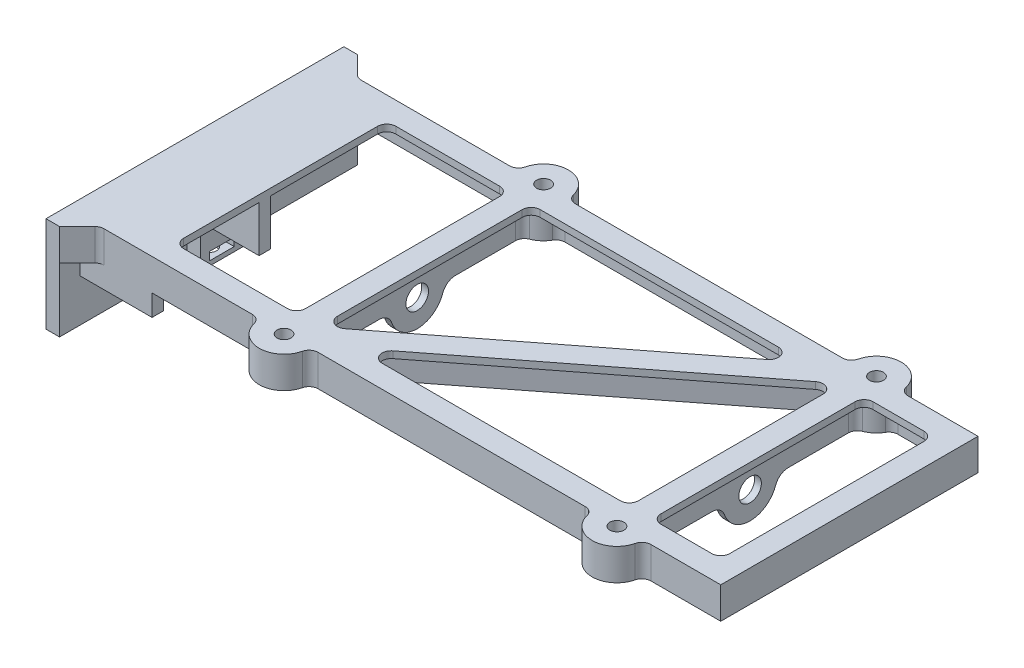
ISO-10303-21;
HEADER;
FILE_DESCRIPTION(('STEP AP214'),'2;1');
FILE_NAME('part.step','',(''),(''),'','','');
FILE_SCHEMA(('AUTOMOTIVE_DESIGN { 1 0 10303 214 1 1 1 1 }'));
ENDSEC;
DATA;
#1=APPLICATION_CONTEXT('core data for automotive mechanical design processes');
#2=APPLICATION_PROTOCOL_DEFINITION('international standard','automotive_design',2000,#1);
#3=PRODUCT_CONTEXT('',#1,'mechanical');
#4=PRODUCT('Part','Part','',(#3));
#5=PRODUCT_RELATED_PRODUCT_CATEGORY('part','',(#4));
#6=PRODUCT_DEFINITION_FORMATION('','',#4);
#7=PRODUCT_DEFINITION_CONTEXT('part definition',#1,'design');
#8=PRODUCT_DEFINITION('design','',#6,#7);
#9=PRODUCT_DEFINITION_SHAPE('','',#8);
#10=(LENGTH_UNIT() NAMED_UNIT(*) SI_UNIT(.MILLI.,.METRE.));
#11=(NAMED_UNIT(*) PLANE_ANGLE_UNIT() SI_UNIT($,.RADIAN.));
#12=(NAMED_UNIT(*) SI_UNIT($,.STERADIAN.) SOLID_ANGLE_UNIT());
#13=UNCERTAINTY_MEASURE_WITH_UNIT(LENGTH_MEASURE(1.E-05),#10,'distance_accuracy_value','');
#14=(GEOMETRIC_REPRESENTATION_CONTEXT(3) GLOBAL_UNCERTAINTY_ASSIGNED_CONTEXT((#13)) GLOBAL_UNIT_ASSIGNED_CONTEXT((#10,
#11,#12)) REPRESENTATION_CONTEXT('',''));
#15=CARTESIAN_POINT('',(0.,0.,0.));
#16=DIRECTION('',(0.,0.,1.));
#17=DIRECTION('',(1.,0.,0.));
#18=AXIS2_PLACEMENT_3D('',#15,#16,#17);
#19=CARTESIAN_POINT('',(-69.5,-19.7,-33.));
#20=DIRECTION('',(1.,0.,0.));
#21=DIRECTION('',(0.,0.,-1.));
#22=AXIS2_PLACEMENT_3D('',#19,#20,#21);
#23=PLANE('',#22);
#24=DIRECTION('',(0.,0.,-1.));
#25=VECTOR('',#24,1.);
#26=CARTESIAN_POINT('',(-69.5,-10.2,26.));
#27=LINE('',#26,#25);
#28=CARTESIAN_POINT('',(-69.5,-10.2,28.5));
#29=VERTEX_POINT('',#28);
#30=CARTESIAN_POINT('',(-69.5,-10.2,26.));
#31=VERTEX_POINT('',#30);
#32=EDGE_CURVE('E66',#29,#31,#27,.T.);
#33=ORIENTED_EDGE('',*,*,#32,.F.);
#34=DIRECTION('',(0.,1.,0.));
#35=VECTOR('',#34,1.);
#36=CARTESIAN_POINT('',(-69.5,-26.3941347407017,28.5));
#37=LINE('',#36,#35);
#38=CARTESIAN_POINT('',(-69.5,-5.5,28.5));
#39=VERTEX_POINT('',#38);
#40=EDGE_CURVE('E859',#29,#39,#37,.T.);
#41=ORIENTED_EDGE('',*,*,#40,.T.);
#42=DIRECTION('',(0.,0.,1.));
#43=VECTOR('',#42,1.);
#44=CARTESIAN_POINT('',(-69.5,-5.5,-33.));
#45=LINE('',#44,#43);
#46=CARTESIAN_POINT('',(-69.5,-5.5,33.));
#47=VERTEX_POINT('',#46);
#48=EDGE_CURVE('E1228',#39,#47,#45,.T.);
#49=ORIENTED_EDGE('',*,*,#48,.T.);
#50=DIRECTION('',(0.,1.,0.));
#51=VECTOR('',#50,1.);
#52=CARTESIAN_POINT('',(-69.5,-19.7,33.));
#53=LINE('',#52,#51);
#54=CARTESIAN_POINT('',(-69.5,-19.7,33.));
#55=VERTEX_POINT('',#54);
#56=EDGE_CURVE('E1539',#55,#47,#53,.T.);
#57=ORIENTED_EDGE('',*,*,#56,.F.);
#58=DIRECTION('',(0.,0.,-1.));
#59=VECTOR('',#58,1.);
#60=CARTESIAN_POINT('',(-69.5,-19.7,-33.));
#61=LINE('',#60,#59);
#62=CARTESIAN_POINT('',(-69.5,-19.7,4.8));
#63=VERTEX_POINT('',#62);
#64=EDGE_CURVE('E1514',#55,#63,#61,.T.);
#65=ORIENTED_EDGE('',*,*,#64,.T.);
#66=DIRECTION('',(0.,-1.,0.));
#67=VECTOR('',#66,1.);
#68=CARTESIAN_POINT('',(-69.5,-19.7,4.8));
#69=LINE('',#68,#67);
#70=CARTESIAN_POINT('',(-69.5,-10.2,4.8));
#71=VERTEX_POINT('',#70);
#72=EDGE_CURVE('E1501',#71,#63,#69,.T.);
#73=ORIENTED_EDGE('',*,*,#72,.F.);
#74=DIRECTION('',(0.,0.,1.));
#75=VECTOR('',#74,1.);
#76=CARTESIAN_POINT('',(-69.5,-10.2,22.901440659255));
#77=LINE('',#76,#75);
#78=CARTESIAN_POINT('',(-69.5,-10.2,22.901440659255));
#79=VERTEX_POINT('',#78);
#80=EDGE_CURVE('E949',#71,#79,#77,.T.);
#81=ORIENTED_EDGE('',*,*,#80,.T.);
#82=DIRECTION('',(0.,0.642787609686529,0.766044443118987));
#83=VECTOR('',#82,1.);
#84=CARTESIAN_POINT('',(-69.5,-7.6,26.));
#85=LINE('',#84,#83);
#86=CARTESIAN_POINT('',(-69.5,-7.60000000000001,26.));
#87=VERTEX_POINT('',#86);
#88=EDGE_CURVE('E944',#79,#87,#85,.T.);
#89=ORIENTED_EDGE('',*,*,#88,.T.);
#90=DIRECTION('',(0.,1.,0.));
#91=VECTOR('',#90,1.);
#92=CARTESIAN_POINT('',(-69.5,-26.3941347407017,26.));
#93=LINE('',#92,#91);
#94=EDGE_CURVE('E61',#31,#87,#93,.T.);
#95=ORIENTED_EDGE('',*,*,#94,.F.);
#96=EDGE_LOOP('',(#33,#41,#49,#57,#65,#73,#81,#89,#95));
#97=FACE_BOUND('',#96,.T.);
#98=ADVANCED_FACE('F45',(#97),#23,.T.);
#99=CARTESIAN_POINT('',(0.,-5.5,0.));
#100=DIRECTION('',(0.,-1.,0.));
#101=DIRECTION('',(0.,0.,-1.));
#102=AXIS2_PLACEMENT_3D('',#99,#100,#101);
#103=PLANE('',#102);
#104=DIRECTION('',(0.,0.,1.));
#105=VECTOR('',#104,1.);
#106=CARTESIAN_POINT('',(50.5,-5.5,-26.5));
#107=LINE('',#106,#105);
#108=CARTESIAN_POINT('',(50.5,-5.5,-21.7845855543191));
#109=VERTEX_POINT('',#108);
#110=CARTESIAN_POINT('',(50.5,-5.5,-8.48528137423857));
#111=VERTEX_POINT('',#110);
#112=EDGE_CURVE('E1155',#109,#111,#107,.T.);
#113=ORIENTED_EDGE('',*,*,#112,.T.);
#114=DIRECTION('',(-1.,0.,0.));
#115=VECTOR('',#114,1.);
#116=CARTESIAN_POINT('',(49.,-5.5,-8.48528137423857));
#117=LINE('',#116,#115);
#118=CARTESIAN_POINT('',(49.,-5.5,-8.48528137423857));
#119=VERTEX_POINT('',#118);
#120=EDGE_CURVE('E2183',#111,#119,#117,.T.);
#121=ORIENTED_EDGE('',*,*,#120,.T.);
#122=DIRECTION('',(0.,0.,-1.));
#123=VECTOR('',#122,1.);
#124=CARTESIAN_POINT('',(49.,-5.5,-26.5));
#125=LINE('',#124,#123);
#126=CARTESIAN_POINT('',(49.,-5.5,-21.7845855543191));
#127=VERTEX_POINT('',#126);
#128=EDGE_CURVE('E1154',#119,#127,#125,.T.);
#129=ORIENTED_EDGE('',*,*,#128,.T.);
#130=CARTESIAN_POINT('',(47.,-5.5,-21.7845855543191));
#131=DIRECTION('',(0.,-1.,0.));
#132=DIRECTION('',(0.,0.,-1.));
#133=AXIS2_PLACEMENT_3D('',#130,#131,#132);
#134=CIRCLE('',#133,2.);
#135=CARTESIAN_POINT('',(47.7344472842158,-5.5,-23.644850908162));
#136=VERTEX_POINT('',#135);
#137=EDGE_CURVE('E2113',#127,#136,#134,.F.);
#138=ORIENTED_EDGE('',*,*,#137,.T.);
#139=CARTESIAN_POINT('',(49.75,-5.5,-28.75));
#140=DIRECTION('',(0.,-1.,0.));
#141=DIRECTION('',(0.,0.,-1.));
#142=AXIS2_PLACEMENT_3D('',#139,#140,#141);
#143=CIRCLE('',#142,5.48862460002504);
#144=CARTESIAN_POINT('',(46.9632103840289,-5.5,-24.0214903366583));
#145=VERTEX_POINT('',#144);
#146=EDGE_CURVE('E1088',#136,#145,#143,.T.);
#147=ORIENTED_EDGE('',*,*,#146,.T.);
#148=CARTESIAN_POINT('',(45.9477320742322,-5.5,-22.2984686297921));
#149=DIRECTION('',(0.,-1.,0.));
#150=DIRECTION('',(0.,0.,-1.));
#151=AXIS2_PLACEMENT_3D('',#148,#149,#150);
#152=CIRCLE('',#151,2.);
#153=CARTESIAN_POINT('',(44.718000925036,-5.5,-23.8757324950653));
#154=VERTEX_POINT('',#153);
#155=EDGE_CURVE('E2116',#145,#154,#152,.F.);
#156=ORIENTED_EDGE('',*,*,#155,.T.);
#157=DIRECTION('',(-0.788631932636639,0.,0.614865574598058));
#158=VECTOR('',#157,1.);
#159=CARTESIAN_POINT('',(-23.5388508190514,-5.5,29.3414739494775));
#160=LINE('',#159,#158);
#161=CARTESIAN_POINT('',(-19.250947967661,-5.5,25.9983632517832));
#162=VERTEX_POINT('',#161);
#163=EDGE_CURVE('E1166',#154,#162,#160,.T.);
#164=ORIENTED_EDGE('',*,*,#163,.T.);
#165=CARTESIAN_POINT('',(-24.,-5.5,28.75));
#166=DIRECTION('',(0.,-1.,0.));
#167=DIRECTION('',(0.,0.,-1.));
#168=AXIS2_PLACEMENT_3D('',#165,#166,#167);
#169=CIRCLE('',#168,5.48862460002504);
#170=CARTESIAN_POINT('',(-19.2491208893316,-5.5,26.0015190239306));
#171=VERTEX_POINT('',#170);
#172=EDGE_CURVE('E1128',#162,#171,#169,.T.);
#173=ORIENTED_EDGE('',*,*,#172,.T.);
#174=CARTESIAN_POINT('',(-17.5179479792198,-5.5,25.));
#175=DIRECTION('',(0.,-1.,0.));
#176=DIRECTION('',(0.,0.,-1.));
#177=AXIS2_PLACEMENT_3D('',#174,#175,#176);
#178=CIRCLE('',#177,2.);
#179=CARTESIAN_POINT('',(-17.5179479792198,-5.5,27.));
#180=VERTEX_POINT('',#179);
#181=EDGE_CURVE('E2059',#171,#180,#178,.F.);
#182=ORIENTED_EDGE('',*,*,#181,.T.);
#183=DIRECTION('',(1.,0.,0.));
#184=VECTOR('',#183,1.);
#185=CARTESIAN_POINT('',(-19.2499999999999,-5.5,27.));
#186=LINE('',#185,#184);
#187=CARTESIAN_POINT('',(43.2679479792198,-5.5,27.));
#188=VERTEX_POINT('',#187);
#189=EDGE_CURVE('E1282',#180,#188,#186,.T.);
#190=ORIENTED_EDGE('',*,*,#189,.T.);
#191=CARTESIAN_POINT('',(43.2679479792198,-5.5,25.));
#192=DIRECTION('',(0.,-1.,0.));
#193=DIRECTION('',(0.,0.,-1.));
#194=AXIS2_PLACEMENT_3D('',#191,#192,#193);
#195=CIRCLE('',#194,2.);
#196=CARTESIAN_POINT('',(44.9991208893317,-5.5,26.0015190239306));
#197=VERTEX_POINT('',#196);
#198=EDGE_CURVE('E2080',#188,#197,#195,.F.);
#199=ORIENTED_EDGE('',*,*,#198,.T.);
#200=CARTESIAN_POINT('',(49.75,-5.5,28.75));
#201=DIRECTION('',(0.,-1.,0.));
#202=DIRECTION('',(0.,0.,1.));
#203=AXIS2_PLACEMENT_3D('',#200,#201,#202);
#204=CIRCLE('',#203,5.48862460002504);
#205=CARTESIAN_POINT('',(47.7344472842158,-5.5,23.644850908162));
#206=VERTEX_POINT('',#205);
#207=EDGE_CURVE('E1068',#197,#206,#204,.T.);
#208=ORIENTED_EDGE('',*,*,#207,.T.);
#209=CARTESIAN_POINT('',(47.,-5.5,21.7845855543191));
#210=DIRECTION('',(0.,-1.,0.));
#211=DIRECTION('',(0.,0.,-1.));
#212=AXIS2_PLACEMENT_3D('',#209,#210,#211);
#213=CIRCLE('',#212,2.);
#214=CARTESIAN_POINT('',(49.,-5.5,21.7845855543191));
#215=VERTEX_POINT('',#214);
#216=EDGE_CURVE('E2083',#206,#215,#213,.F.);
#217=ORIENTED_EDGE('',*,*,#216,.T.);
#218=CARTESIAN_POINT('',(49.,-5.5,8.48528137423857));
#219=VERTEX_POINT('',#218);
#220=EDGE_CURVE('E1149',#215,#219,#125,.T.);
#221=ORIENTED_EDGE('',*,*,#220,.T.);
#222=DIRECTION('',(-1.,0.,0.));
#223=VECTOR('',#222,1.);
#224=CARTESIAN_POINT('',(50.5,-5.5,8.48528137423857));
#225=LINE('',#224,#223);
#226=CARTESIAN_POINT('',(50.5,-5.5,8.48528137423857));
#227=VERTEX_POINT('',#226);
#228=EDGE_CURVE('E2180',#219,#227,#225,.F.);
#229=ORIENTED_EDGE('',*,*,#228,.T.);
#230=CARTESIAN_POINT('',(50.5,-5.5,21.7845855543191));
#231=VERTEX_POINT('',#230);
#232=EDGE_CURVE('E1153',#227,#231,#107,.T.);
#233=ORIENTED_EDGE('',*,*,#232,.T.);
#234=CARTESIAN_POINT('',(52.5,-5.5,21.7845855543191));
#235=DIRECTION('',(0.,-1.,0.));
#236=DIRECTION('',(0.,0.,-1.));
#237=AXIS2_PLACEMENT_3D('',#234,#235,#236);
#238=CIRCLE('',#237,2.);
#239=CARTESIAN_POINT('',(51.7655527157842,-5.5,23.644850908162));
#240=VERTEX_POINT('',#239);
#241=EDGE_CURVE('E2086',#231,#240,#238,.F.);
#242=ORIENTED_EDGE('',*,*,#241,.T.);
#243=CARTESIAN_POINT('',(54.5008791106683,-5.5,26.0015190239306));
#244=VERTEX_POINT('',#243);
#245=EDGE_CURVE('E1064',#240,#244,#204,.T.);
#246=ORIENTED_EDGE('',*,*,#245,.T.);
#247=CARTESIAN_POINT('',(56.2320520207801,-5.5,25.));
#248=DIRECTION('',(0.,-1.,0.));
#249=DIRECTION('',(0.,0.,-1.));
#250=AXIS2_PLACEMENT_3D('',#247,#248,#249);
#251=CIRCLE('',#250,2.);
#252=CARTESIAN_POINT('',(56.2320520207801,-5.5,27.));
#253=VERTEX_POINT('',#252);
#254=EDGE_CURVE('E2089',#244,#253,#251,.F.);
#255=ORIENTED_EDGE('',*,*,#254,.T.);
#256=DIRECTION('',(1.,0.,0.));
#257=VECTOR('',#256,1.);
#258=CARTESIAN_POINT('',(54.5,-5.5,27.));
#259=LINE('',#258,#257);
#260=CARTESIAN_POINT('',(71.,-5.5,27.));
#261=VERTEX_POINT('',#260);
#262=EDGE_CURVE('E1251',#253,#261,#259,.T.);
#263=ORIENTED_EDGE('',*,*,#262,.T.);
#264=DIRECTION('',(0.,0.,-1.));
#265=VECTOR('',#264,1.);
#266=CARTESIAN_POINT('',(71.,-5.5,27.));
#267=LINE('',#266,#265);
#268=CARTESIAN_POINT('',(71.,-5.5,-27.));
#269=VERTEX_POINT('',#268);
#270=EDGE_CURVE('E1247',#261,#269,#267,.T.);
#271=ORIENTED_EDGE('',*,*,#270,.T.);
#272=DIRECTION('',(-1.,0.,0.));
#273=VECTOR('',#272,1.);
#274=CARTESIAN_POINT('',(71.,-5.5,-27.));
#275=LINE('',#274,#273);
#276=CARTESIAN_POINT('',(56.2320520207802,-5.5,-27.));
#277=VERTEX_POINT('',#276);
#278=EDGE_CURVE('E1239',#269,#277,#275,.T.);
#279=ORIENTED_EDGE('',*,*,#278,.T.);
#280=CARTESIAN_POINT('',(56.2320520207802,-5.5,-25.));
#281=DIRECTION('',(0.,-1.,0.));
#282=DIRECTION('',(0.,0.,-1.));
#283=AXIS2_PLACEMENT_3D('',#280,#281,#282);
#284=CIRCLE('',#283,2.);
#285=CARTESIAN_POINT('',(54.5008791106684,-5.5,-26.0015190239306));
#286=VERTEX_POINT('',#285);
#287=EDGE_CURVE('E2107',#277,#286,#284,.F.);
#288=ORIENTED_EDGE('',*,*,#287,.T.);
#289=CARTESIAN_POINT('',(51.7655527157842,-5.5,-23.6448509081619));
#290=VERTEX_POINT('',#289);
#291=EDGE_CURVE('E1083',#286,#290,#143,.T.);
#292=ORIENTED_EDGE('',*,*,#291,.T.);
#293=CARTESIAN_POINT('',(52.5,-5.5,-21.7845855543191));
#294=DIRECTION('',(0.,-1.,0.));
#295=DIRECTION('',(0.,0.,-1.));
#296=AXIS2_PLACEMENT_3D('',#293,#294,#295);
#297=CIRCLE('',#296,2.);
#298=EDGE_CURVE('E2110',#290,#109,#297,.F.);
#299=ORIENTED_EDGE('',*,*,#298,.T.);
#300=EDGE_LOOP('',(#113,#121,#129,#138,#147,#156,#164,#173,#182,#190,#199,#208,#217,#221,#229,
#233,#242,#246,#255,#263,#271,#279,#288,#292,#299));
#301=FACE_BOUND('',#300,.T.);
#302=CARTESIAN_POINT('',(49.75,-5.5,28.75));
#303=DIRECTION('',(0.,-1.,0.));
#304=DIRECTION('',(0.,0.,-1.));
#305=AXIS2_PLACEMENT_3D('',#302,#303,#304);
#306=CIRCLE('',#305,3.125);
#307=CARTESIAN_POINT('',(49.75,-5.5,25.625));
#308=VERTEX_POINT('',#307);
#309=EDGE_CURVE('E1037',#308,#308,#306,.T.);
#310=ORIENTED_EDGE('',*,*,#309,.F.);
#311=EDGE_LOOP('',(#310));
#312=FACE_BOUND('',#311,.T.);
#313=CARTESIAN_POINT('',(-23.9999999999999,-5.5,-28.75));
#314=DIRECTION('',(0.,-1.,0.));
#315=DIRECTION('',(0.,0.,-1.));
#316=AXIS2_PLACEMENT_3D('',#313,#314,#315);
#317=CIRCLE('',#316,3.125);
#318=CARTESIAN_POINT('',(-23.9999999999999,-5.5,-31.875));
#319=VERTEX_POINT('',#318);
#320=EDGE_CURVE('E1046',#319,#319,#317,.T.);
#321=ORIENTED_EDGE('',*,*,#320,.F.);
#322=EDGE_LOOP('',(#321));
#323=FACE_BOUND('',#322,.T.);
#324=CARTESIAN_POINT('',(-24.,-5.5,28.75));
#325=DIRECTION('',(0.,-1.,0.));
#326=DIRECTION('',(0.,0.,-1.));
#327=AXIS2_PLACEMENT_3D('',#324,#325,#326);
#328=CIRCLE('',#327,3.125);
#329=CARTESIAN_POINT('',(-24.,-5.5,25.625));
#330=VERTEX_POINT('',#329);
#331=EDGE_CURVE('E1029',#330,#330,#328,.T.);
#332=ORIENTED_EDGE('',*,*,#331,.F.);
#333=EDGE_LOOP('',(#332));
#334=FACE_BOUND('',#333,.T.);
#335=CARTESIAN_POINT('',(49.75,-5.5,-28.75));
#336=DIRECTION('',(0.,-1.,0.));
#337=DIRECTION('',(0.,0.,-1.));
#338=AXIS2_PLACEMENT_3D('',#335,#336,#337);
#339=CIRCLE('',#338,3.125);
#340=CARTESIAN_POINT('',(49.75,-5.5,-31.875));
#341=VERTEX_POINT('',#340);
#342=EDGE_CURVE('E1041',#341,#341,#339,.T.);
#343=ORIENTED_EDGE('',*,*,#342,.F.);
#344=EDGE_LOOP('',(#343));
#345=FACE_BOUND('',#344,.T.);
#346=DIRECTION('',(-1.,0.,0.));
#347=VECTOR('',#346,1.);
#348=CARTESIAN_POINT('',(-28.75,-5.5,28.5));
#349=LINE('',#348,#347);
#350=CARTESIAN_POINT('',(-31.2812772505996,-5.5,28.5));
#351=VERTEX_POINT('',#350);
#352=CARTESIAN_POINT('',(-53.5,-5.5,28.5));
#353=VERTEX_POINT('',#352);
#354=EDGE_CURVE('E1225',#351,#353,#349,.T.);
#355=ORIENTED_EDGE('',*,*,#354,.T.);
#356=DIRECTION('',(0.,0.,1.));
#357=VECTOR('',#356,1.);
#358=CARTESIAN_POINT('',(-53.5,-5.5,26.));
#359=LINE('',#358,#357);
#360=CARTESIAN_POINT('',(-53.5,-5.5,27.));
#361=VERTEX_POINT('',#360);
#362=EDGE_CURVE('E868',#361,#353,#359,.T.);
#363=ORIENTED_EDGE('',*,*,#362,.F.);
#364=DIRECTION('',(1.,0.,0.));
#365=VECTOR('',#364,1.);
#366=CARTESIAN_POINT('',(-28.75,-5.5,27.));
#367=LINE('',#366,#365);
#368=CARTESIAN_POINT('',(-30.4820520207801,-5.5,27.));
#369=VERTEX_POINT('',#368);
#370=EDGE_CURVE('E1218',#361,#369,#367,.T.);
#371=ORIENTED_EDGE('',*,*,#370,.T.);
#372=CARTESIAN_POINT('',(-30.4820520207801,-5.5,25.));
#373=DIRECTION('',(0.,-1.,0.));
#374=DIRECTION('',(0.,0.,-1.));
#375=AXIS2_PLACEMENT_3D('',#372,#373,#374);
#376=CIRCLE('',#375,2.);
#377=CARTESIAN_POINT('',(-28.7508791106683,-5.5,26.0015190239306));
#378=VERTEX_POINT('',#377);
#379=EDGE_CURVE('E2041',#369,#378,#376,.F.);
#380=ORIENTED_EDGE('',*,*,#379,.T.);
#381=CARTESIAN_POINT('',(-26.0155527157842,-5.5,23.6448509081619));
#382=VERTEX_POINT('',#381);
#383=EDGE_CURVE('E1122',#378,#382,#169,.T.);
#384=ORIENTED_EDGE('',*,*,#383,.T.);
#385=CARTESIAN_POINT('',(-26.75,-5.5,21.7845855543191));
#386=DIRECTION('',(0.,-1.,0.));
#387=DIRECTION('',(0.,0.,-1.));
#388=AXIS2_PLACEMENT_3D('',#385,#386,#387);
#389=CIRCLE('',#388,2.);
#390=CARTESIAN_POINT('',(-24.75,-5.5,21.7845855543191));
#391=VERTEX_POINT('',#390);
#392=EDGE_CURVE('E2062',#382,#391,#389,.F.);
#393=ORIENTED_EDGE('',*,*,#392,.T.);
#394=DIRECTION('',(0.,0.,-1.));
#395=VECTOR('',#394,1.);
#396=CARTESIAN_POINT('',(-24.75,-5.5,26.5));
#397=LINE('',#396,#395);
#398=CARTESIAN_POINT('',(-24.75,-5.5,8.48528137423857));
#399=VERTEX_POINT('',#398);
#400=EDGE_CURVE('E1185',#391,#399,#397,.T.);
#401=ORIENTED_EDGE('',*,*,#400,.T.);
#402=DIRECTION('',(-1.,0.,0.));
#403=VECTOR('',#402,1.);
#404=CARTESIAN_POINT('',(-23.2499999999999,-5.5,8.48528137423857));
#405=LINE('',#404,#403);
#406=CARTESIAN_POINT('',(-23.2499999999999,-5.5,8.48528137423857));
#407=VERTEX_POINT('',#406);
#408=EDGE_CURVE('E2189',#399,#407,#405,.F.);
#409=ORIENTED_EDGE('',*,*,#408,.T.);
#410=DIRECTION('',(0.,0.,1.));
#411=VECTOR('',#410,1.);
#412=CARTESIAN_POINT('',(-23.25,-5.5,26.5));
#413=LINE('',#412,#411);
#414=CARTESIAN_POINT('',(-23.25,-5.5,21.7845855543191));
#415=VERTEX_POINT('',#414);
#416=EDGE_CURVE('E1184',#407,#415,#413,.T.);
#417=ORIENTED_EDGE('',*,*,#416,.T.);
#418=CARTESIAN_POINT('',(-21.25,-5.5,21.7845855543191));
#419=DIRECTION('',(0.,-1.,0.));
#420=DIRECTION('',(0.,0.,-1.));
#421=AXIS2_PLACEMENT_3D('',#418,#419,#420);
#422=CIRCLE('',#421,2.);
#423=CARTESIAN_POINT('',(-21.9844472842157,-5.5,23.6448509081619));
#424=VERTEX_POINT('',#423);
#425=EDGE_CURVE('E2065',#415,#424,#422,.F.);
#426=ORIENTED_EDGE('',*,*,#425,.T.);
#427=CARTESIAN_POINT('',(-21.2132103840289,-5.5,24.0214903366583));
#428=VERTEX_POINT('',#427);
#429=EDGE_CURVE('E1123',#424,#428,#169,.T.);
#430=ORIENTED_EDGE('',*,*,#429,.T.);
#431=CARTESIAN_POINT('',(-20.1977320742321,-5.5,22.298468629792));
#432=DIRECTION('',(0.,-1.,0.));
#433=DIRECTION('',(0.,0.,-1.));
#434=AXIS2_PLACEMENT_3D('',#431,#432,#433);
#435=CIRCLE('',#434,2.);
#436=CARTESIAN_POINT('',(-18.968000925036,-5.5,23.8757324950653));
#437=VERTEX_POINT('',#436);
#438=EDGE_CURVE('E2056',#428,#437,#435,.F.);
#439=ORIENTED_EDGE('',*,*,#438,.T.);
#440=DIRECTION('',(0.788631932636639,0.,-0.614865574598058));
#441=VECTOR('',#440,1.);
#442=CARTESIAN_POINT('',(-24.4611491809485,-5.5,28.1585260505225));
#443=LINE('',#442,#441);
#444=CARTESIAN_POINT('',(45.000947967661,-5.5,-25.9983632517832));
#445=VERTEX_POINT('',#444);
#446=EDGE_CURVE('E1169',#437,#445,#443,.T.);
#447=ORIENTED_EDGE('',*,*,#446,.T.);
#448=CARTESIAN_POINT('',(44.9991208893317,-5.5,-26.0015190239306));
#449=VERTEX_POINT('',#448);
#450=EDGE_CURVE('E1082',#445,#449,#143,.T.);
#451=ORIENTED_EDGE('',*,*,#450,.T.);
#452=CARTESIAN_POINT('',(43.2679479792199,-5.5,-25.));
#453=DIRECTION('',(0.,-1.,0.));
#454=DIRECTION('',(0.,0.,-1.));
#455=AXIS2_PLACEMENT_3D('',#452,#453,#454);
#456=CIRCLE('',#455,2.);
#457=CARTESIAN_POINT('',(43.2679479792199,-5.5,-27.));
#458=VERTEX_POINT('',#457);
#459=EDGE_CURVE('E2098',#449,#458,#456,.F.);
#460=ORIENTED_EDGE('',*,*,#459,.T.);
#461=DIRECTION('',(-1.,0.,0.));
#462=VECTOR('',#461,1.);
#463=CARTESIAN_POINT('',(-19.2499999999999,-5.5,-27.));
#464=LINE('',#463,#462);
#465=CARTESIAN_POINT('',(-17.5179479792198,-5.5,-27.));
#466=VERTEX_POINT('',#465);
#467=EDGE_CURVE('E1292',#458,#466,#464,.T.);
#468=ORIENTED_EDGE('',*,*,#467,.T.);
#469=CARTESIAN_POINT('',(-17.5179479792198,-5.5,-25.));
#470=DIRECTION('',(0.,-1.,0.));
#471=DIRECTION('',(0.,0.,-1.));
#472=AXIS2_PLACEMENT_3D('',#469,#470,#471);
#473=CIRCLE('',#472,2.);
#474=CARTESIAN_POINT('',(-19.2491208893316,-5.5,-26.0015190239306));
#475=VERTEX_POINT('',#474);
#476=EDGE_CURVE('E2137',#466,#475,#473,.F.);
#477=ORIENTED_EDGE('',*,*,#476,.T.);
#478=CARTESIAN_POINT('',(-23.9999999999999,-5.5,-28.75));
#479=DIRECTION('',(0.,-1.,0.));
#480=DIRECTION('',(0.,0.,1.));
#481=AXIS2_PLACEMENT_3D('',#478,#479,#480);
#482=CIRCLE('',#481,5.48862460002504);
#483=CARTESIAN_POINT('',(-21.9844472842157,-5.5,-23.644850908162));
#484=VERTEX_POINT('',#483);
#485=EDGE_CURVE('E1108',#475,#484,#482,.T.);
#486=ORIENTED_EDGE('',*,*,#485,.T.);
#487=CARTESIAN_POINT('',(-21.2499999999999,-5.5,-21.7845855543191));
#488=DIRECTION('',(0.,-1.,0.));
#489=DIRECTION('',(0.,0.,-1.));
#490=AXIS2_PLACEMENT_3D('',#487,#488,#489);
#491=CIRCLE('',#490,2.);
#492=CARTESIAN_POINT('',(-23.2499999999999,-5.5,-21.7845855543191));
#493=VERTEX_POINT('',#492);
#494=EDGE_CURVE('E2140',#484,#493,#491,.F.);
#495=ORIENTED_EDGE('',*,*,#494,.T.);
#496=CARTESIAN_POINT('',(-23.2499999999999,-5.5,-8.48528137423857));
#497=VERTEX_POINT('',#496);
#498=EDGE_CURVE('E1179',#493,#497,#413,.T.);
#499=ORIENTED_EDGE('',*,*,#498,.T.);
#500=DIRECTION('',(-1.,0.,0.));
#501=VECTOR('',#500,1.);
#502=CARTESIAN_POINT('',(-24.75,-5.5,-8.48528137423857));
#503=LINE('',#502,#501);
#504=CARTESIAN_POINT('',(-24.75,-5.5,-8.48528137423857));
#505=VERTEX_POINT('',#504);
#506=EDGE_CURVE('E2186',#497,#505,#503,.T.);
#507=ORIENTED_EDGE('',*,*,#506,.T.);
#508=CARTESIAN_POINT('',(-24.7499999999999,-5.5,-21.7845855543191));
#509=VERTEX_POINT('',#508);
#510=EDGE_CURVE('E1183',#505,#509,#397,.T.);
#511=ORIENTED_EDGE('',*,*,#510,.T.);
#512=CARTESIAN_POINT('',(-26.7499999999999,-5.5,-21.7845855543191));
#513=DIRECTION('',(0.,-1.,0.));
#514=DIRECTION('',(0.,0.,-1.));
#515=AXIS2_PLACEMENT_3D('',#512,#513,#514);
#516=CIRCLE('',#515,2.);
#517=CARTESIAN_POINT('',(-26.0155527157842,-5.5,-23.644850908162));
#518=VERTEX_POINT('',#517);
#519=EDGE_CURVE('E2152',#509,#518,#516,.F.);
#520=ORIENTED_EDGE('',*,*,#519,.T.);
#521=CARTESIAN_POINT('',(-28.7508791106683,-5.5,-26.0015190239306));
#522=VERTEX_POINT('',#521);
#523=EDGE_CURVE('E1113',#518,#522,#482,.T.);
#524=ORIENTED_EDGE('',*,*,#523,.T.);
#525=CARTESIAN_POINT('',(-30.4820520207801,-5.5,-25.));
#526=DIRECTION('',(0.,-1.,0.));
#527=DIRECTION('',(0.,0.,-1.));
#528=AXIS2_PLACEMENT_3D('',#525,#526,#527);
#529=CIRCLE('',#528,2.);
#530=CARTESIAN_POINT('',(-30.4820520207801,-5.5,-27.));
#531=VERTEX_POINT('',#530);
#532=EDGE_CURVE('E2155',#522,#531,#529,.F.);
#533=ORIENTED_EDGE('',*,*,#532,.T.);
#534=DIRECTION('',(-1.,0.,0.));
#535=VECTOR('',#534,1.);
#536=CARTESIAN_POINT('',(-28.75,-5.5,-27.));
#537=LINE('',#536,#535);
#538=CARTESIAN_POINT('',(-64.7928932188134,-5.5,-27.));
#539=VERTEX_POINT('',#538);
#540=EDGE_CURVE('E1201',#531,#539,#537,.T.);
#541=ORIENTED_EDGE('',*,*,#540,.T.);
#542=CARTESIAN_POINT('',(-64.7928932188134,-5.50000000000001,-29.));
#543=DIRECTION('',(0.,-1.,0.));
#544=DIRECTION('',(0.,0.,-1.));
#545=AXIS2_PLACEMENT_3D('',#542,#543,#544);
#546=CIRCLE('',#545,2.);
#547=CARTESIAN_POINT('',(-66.2071067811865,-5.5,-27.5857864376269));
#548=VERTEX_POINT('',#547);
#549=EDGE_CURVE('E1806',#539,#548,#546,.T.);
#550=ORIENTED_EDGE('',*,*,#549,.T.);
#551=DIRECTION('',(-0.707106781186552,0.,-0.707106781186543));
#552=VECTOR('',#551,1.);
#553=CARTESIAN_POINT('',(-65.6213203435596,-5.5,-27.));
#554=LINE('',#553,#552);
#555=CARTESIAN_POINT('',(-67.7928932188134,-5.5,-29.1715728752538));
#556=VERTEX_POINT('',#555);
#557=EDGE_CURVE('E1196',#548,#556,#554,.T.);
#558=ORIENTED_EDGE('',*,*,#557,.T.);
#559=CARTESIAN_POINT('',(-68.5,-5.50000000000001,-28.4644660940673));
#560=DIRECTION('',(0.,-1.,0.));
#561=DIRECTION('',(0.,0.,-1.));
#562=AXIS2_PLACEMENT_3D('',#559,#560,#561);
#563=CIRCLE('',#562,1.);
#564=CARTESIAN_POINT('',(-69.5,-5.5,-28.4644660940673));
#565=VERTEX_POINT('',#564);
#566=EDGE_CURVE('E2168',#556,#565,#563,.F.);
#567=ORIENTED_EDGE('',*,*,#566,.T.);
#568=DIRECTION('',(0.,0.,1.));
#569=VECTOR('',#568,1.);
#570=CARTESIAN_POINT('',(-69.5,-5.5,-33.));
#571=LINE('',#570,#569);
#572=CARTESIAN_POINT('',(-69.5,-5.5,-33.));
#573=VERTEX_POINT('',#572);
#574=EDGE_CURVE('E1209',#573,#565,#571,.T.);
#575=ORIENTED_EDGE('',*,*,#574,.F.);
#576=DIRECTION('',(0.707106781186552,0.,0.707106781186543));
#577=VECTOR('',#576,1.);
#578=CARTESIAN_POINT('',(-64.9999999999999,-5.5,-28.5));
#579=LINE('',#578,#577);
#580=CARTESIAN_POINT('',(-65.5857864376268,-5.5,-29.0857864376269));
#581=VERTEX_POINT('',#580);
#582=EDGE_CURVE('E1192',#573,#581,#579,.T.);
#583=ORIENTED_EDGE('',*,*,#582,.T.);
#584=CARTESIAN_POINT('',(-64.1715728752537,-5.5,-30.5));
#585=DIRECTION('',(0.,-1.,0.));
#586=DIRECTION('',(0.,0.,-1.));
#587=AXIS2_PLACEMENT_3D('',#584,#585,#586);
#588=CIRCLE('',#587,2.);
#589=CARTESIAN_POINT('',(-64.1715728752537,-5.5,-28.5));
#590=VERTEX_POINT('',#589);
#591=EDGE_CURVE('E2149',#581,#590,#588,.F.);
#592=ORIENTED_EDGE('',*,*,#591,.T.);
#593=DIRECTION('',(1.,0.,0.));
#594=VECTOR('',#593,1.);
#595=CARTESIAN_POINT('',(-28.75,-5.5,-28.5));
#596=LINE('',#595,#594);
#597=CARTESIAN_POINT('',(-31.2812772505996,-5.5,-28.5));
#598=VERTEX_POINT('',#597);
#599=EDGE_CURVE('E1205',#590,#598,#596,.T.);
#600=ORIENTED_EDGE('',*,*,#599,.T.);
#601=CARTESIAN_POINT('',(-31.2812772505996,-5.5,-30.5));
#602=DIRECTION('',(0.,-1.,0.));
#603=DIRECTION('',(0.,0.,-1.));
#604=AXIS2_PLACEMENT_3D('',#601,#602,#603);
#605=CIRCLE('',#604,2.);
#606=CARTESIAN_POINT('',(-29.3366538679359,-5.5,-30.032624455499));
#607=VERTEX_POINT('',#606);
#608=EDGE_CURVE('E2125',#598,#607,#605,.F.);
#609=ORIENTED_EDGE('',*,*,#608,.T.);
#610=CARTESIAN_POINT('',(-18.663346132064,-5.5,-30.032624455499));
#611=VERTEX_POINT('',#610);
#612=EDGE_CURVE('E1112',#607,#611,#482,.T.);
#613=ORIENTED_EDGE('',*,*,#612,.T.);
#614=CARTESIAN_POINT('',(-16.7187227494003,-5.5,-30.5));
#615=DIRECTION('',(0.,-1.,0.));
#616=DIRECTION('',(0.,0.,-1.));
#617=AXIS2_PLACEMENT_3D('',#614,#615,#616);
#618=CIRCLE('',#617,2.);
#619=CARTESIAN_POINT('',(-16.7187227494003,-5.5,-28.5));
#620=VERTEX_POINT('',#619);
#621=EDGE_CURVE('E2134',#611,#620,#618,.F.);
#622=ORIENTED_EDGE('',*,*,#621,.T.);
#623=DIRECTION('',(1.,0.,0.));
#624=VECTOR('',#623,1.);
#625=CARTESIAN_POINT('',(-19.25,-5.5,-28.5));
#626=LINE('',#625,#624);
#627=CARTESIAN_POINT('',(42.4687227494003,-5.5,-28.5));
#628=VERTEX_POINT('',#627);
#629=EDGE_CURVE('E1286',#620,#628,#626,.T.);
#630=ORIENTED_EDGE('',*,*,#629,.T.);
#631=CARTESIAN_POINT('',(42.4687227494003,-5.5,-30.5));
#632=DIRECTION('',(0.,-1.,0.));
#633=DIRECTION('',(0.,0.,-1.));
#634=AXIS2_PLACEMENT_3D('',#631,#632,#633);
#635=CIRCLE('',#634,2.);
#636=CARTESIAN_POINT('',(44.4133461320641,-5.5,-30.032624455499));
#637=VERTEX_POINT('',#636);
#638=EDGE_CURVE('E2119',#628,#637,#635,.F.);
#639=ORIENTED_EDGE('',*,*,#638,.T.);
#640=CARTESIAN_POINT('',(55.086653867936,-5.5,-30.032624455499));
#641=VERTEX_POINT('',#640);
#642=EDGE_CURVE('E1087',#637,#641,#143,.T.);
#643=ORIENTED_EDGE('',*,*,#642,.T.);
#644=CARTESIAN_POINT('',(57.0312772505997,-5.5,-30.5));
#645=DIRECTION('',(0.,-1.,0.));
#646=DIRECTION('',(0.,0.,-1.));
#647=AXIS2_PLACEMENT_3D('',#644,#645,#646);
#648=CIRCLE('',#647,2.);
#649=CARTESIAN_POINT('',(57.0312772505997,-5.5,-28.5));
#650=VERTEX_POINT('',#649);
#651=EDGE_CURVE('E2104',#641,#650,#648,.F.);
#652=ORIENTED_EDGE('',*,*,#651,.T.);
#653=DIRECTION('',(1.,0.,0.));
#654=VECTOR('',#653,1.);
#655=CARTESIAN_POINT('',(72.5,-5.5,-28.5));
#656=LINE('',#655,#654);
#657=CARTESIAN_POINT('',(72.5,-5.5,-28.5));
#658=VERTEX_POINT('',#657);
#659=EDGE_CURVE('E1262',#650,#658,#656,.T.);
#660=ORIENTED_EDGE('',*,*,#659,.T.);
#661=DIRECTION('',(0.,0.,1.));
#662=VECTOR('',#661,1.);
#663=CARTESIAN_POINT('',(72.5,-5.5,28.5));
#664=LINE('',#663,#662);
#665=CARTESIAN_POINT('',(72.5,-5.5,28.5));
#666=VERTEX_POINT('',#665);
#667=EDGE_CURVE('E1258',#658,#666,#664,.T.);
#668=ORIENTED_EDGE('',*,*,#667,.T.);
#669=DIRECTION('',(-1.,0.,0.));
#670=VECTOR('',#669,1.);
#671=CARTESIAN_POINT('',(54.5,-5.5,28.5));
#672=LINE('',#671,#670);
#673=CARTESIAN_POINT('',(57.0312772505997,-5.5,28.5));
#674=VERTEX_POINT('',#673);
#675=EDGE_CURVE('E1254',#666,#674,#672,.T.);
#676=ORIENTED_EDGE('',*,*,#675,.T.);
#677=CARTESIAN_POINT('',(57.0312772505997,-5.5,30.5));
#678=DIRECTION('',(0.,-1.,0.));
#679=DIRECTION('',(0.,0.,-1.));
#680=AXIS2_PLACEMENT_3D('',#677,#678,#679);
#681=CIRCLE('',#680,2.);
#682=CARTESIAN_POINT('',(55.086653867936,-5.5,30.032624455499));
#683=VERTEX_POINT('',#682);
#684=EDGE_CURVE('E2092',#674,#683,#681,.F.);
#685=ORIENTED_EDGE('',*,*,#684,.T.);
#686=CARTESIAN_POINT('',(44.413346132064,-5.5,30.032624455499));
#687=VERTEX_POINT('',#686);
#688=EDGE_CURVE('E1069',#683,#687,#204,.T.);
#689=ORIENTED_EDGE('',*,*,#688,.T.);
#690=CARTESIAN_POINT('',(42.4687227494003,-5.5,30.5));
#691=DIRECTION('',(0.,-1.,0.));
#692=DIRECTION('',(0.,0.,-1.));
#693=AXIS2_PLACEMENT_3D('',#690,#691,#692);
#694=CIRCLE('',#693,2.);
#695=CARTESIAN_POINT('',(42.4687227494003,-5.5,28.5));
#696=VERTEX_POINT('',#695);
#697=EDGE_CURVE('E2077',#687,#696,#694,.F.);
#698=ORIENTED_EDGE('',*,*,#697,.T.);
#699=DIRECTION('',(-1.,0.,0.));
#700=VECTOR('',#699,1.);
#701=CARTESIAN_POINT('',(-19.2499999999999,-5.5,28.5));
#702=LINE('',#701,#700);
#703=CARTESIAN_POINT('',(-16.7187227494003,-5.5,28.5));
#704=VERTEX_POINT('',#703);
#705=EDGE_CURVE('E1278',#696,#704,#702,.T.);
#706=ORIENTED_EDGE('',*,*,#705,.T.);
#707=CARTESIAN_POINT('',(-16.7187227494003,-5.5,30.5));
#708=DIRECTION('',(0.,-1.,0.));
#709=DIRECTION('',(0.,0.,-1.));
#710=AXIS2_PLACEMENT_3D('',#707,#708,#709);
#711=CIRCLE('',#710,2.);
#712=CARTESIAN_POINT('',(-18.663346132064,-5.5,30.032624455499));
#713=VERTEX_POINT('',#712);
#714=EDGE_CURVE('E2050',#704,#713,#711,.F.);
#715=ORIENTED_EDGE('',*,*,#714,.T.);
#716=CARTESIAN_POINT('',(-29.3366538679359,-5.5,30.032624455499));
#717=VERTEX_POINT('',#716);
#718=EDGE_CURVE('E1129',#713,#717,#169,.T.);
#719=ORIENTED_EDGE('',*,*,#718,.T.);
#720=CARTESIAN_POINT('',(-31.2812772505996,-5.5,30.5));
#721=DIRECTION('',(0.,-1.,0.));
#722=DIRECTION('',(0.,0.,-1.));
#723=AXIS2_PLACEMENT_3D('',#720,#721,#722);
#724=CIRCLE('',#723,2.);
#725=EDGE_CURVE('E2071',#717,#351,#724,.F.);
#726=ORIENTED_EDGE('',*,*,#725,.T.);
#727=EDGE_LOOP('',(#355,#363,#371,#380,#384,#393,#401,#409,#417,#426,#430,#439,#447,#451,#460,
#468,#477,#486,#495,#499,#507,#511,#520,#524,#533,#541,#550,#558,#567,#575,#583,#592,#600,#609,
#613,#622,#630,#639,#643,#652,#660,#668,#676,#685,#689,#698,#706,#715,#719,#726));
#728=FACE_BOUND('',#727,.T.);
#729=ADVANCED_FACE('F2228',(#301,#312,#323,#334,#345,#728),#103,.T.);
#730=ORIENTED_EDGE('',*,*,#48,.F.);
#731=DIRECTION('',(-1.,0.,0.));
#732=VECTOR('',#731,1.);
#733=CARTESIAN_POINT('',(-53.5,-5.5,28.5));
#734=LINE('',#733,#732);
#735=CARTESIAN_POINT('',(-64.1715728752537,-5.5,28.5));
#736=VERTEX_POINT('',#735);
#737=EDGE_CURVE('E872',#736,#39,#734,.T.);
#738=ORIENTED_EDGE('',*,*,#737,.F.);
#739=CARTESIAN_POINT('',(-64.1715728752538,-5.5,30.5));
#740=DIRECTION('',(0.,-1.,0.));
#741=DIRECTION('',(0.,0.,-1.));
#742=AXIS2_PLACEMENT_3D('',#739,#740,#741);
#743=CIRCLE('',#742,2.);
#744=CARTESIAN_POINT('',(-65.5857864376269,-5.5,29.0857864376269));
#745=VERTEX_POINT('',#744);
#746=EDGE_CURVE('E2044',#736,#745,#743,.F.);
#747=ORIENTED_EDGE('',*,*,#746,.T.);
#748=DIRECTION('',(-0.707106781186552,0.,0.707106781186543));
#749=VECTOR('',#748,1.);
#750=CARTESIAN_POINT('',(-64.9999999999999,-5.5,28.5));
#751=LINE('',#750,#749);
#752=EDGE_CURVE('E1221',#745,#47,#751,.T.);
#753=ORIENTED_EDGE('',*,*,#752,.T.);
#754=EDGE_LOOP('',(#730,#738,#747,#753));
#755=FACE_BOUND('',#754,.T.);
#756=ADVANCED_FACE('F2307',(#755),#103,.T.);
#757=CARTESIAN_POINT('',(-66.5,11.2361025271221,4.8));
#758=DIRECTION('',(1.,0.,0.));
#759=DIRECTION('',(0.,0.,-1.));
#760=AXIS2_PLACEMENT_3D('',#757,#758,#759);
#761=PLANE('',#760);
#762=DIRECTION('',(0.,-1.,0.));
#763=VECTOR('',#762,1.);
#764=CARTESIAN_POINT('',(-66.5,-16.9,2.8));
#765=LINE('',#764,#763);
#766=CARTESIAN_POINT('',(-66.5,-16.9,2.8));
#767=VERTEX_POINT('',#766);
#768=CARTESIAN_POINT('',(-66.5,-18.7,2.8));
#769=VERTEX_POINT('',#768);
#770=EDGE_CURVE('E1460',#767,#769,#765,.T.);
#771=ORIENTED_EDGE('',*,*,#770,.F.);
#772=DIRECTION('',(0.,0.,1.));
#773=VECTOR('',#772,1.);
#774=CARTESIAN_POINT('',(-66.5,-16.9,2.8));
#775=LINE('',#774,#773);
#776=CARTESIAN_POINT('',(-66.5,-16.9,-2.7));
#777=VERTEX_POINT('',#776);
#778=EDGE_CURVE('E1434',#777,#767,#775,.T.);
#779=ORIENTED_EDGE('',*,*,#778,.F.);
#780=DIRECTION('',(0.,-1.,0.));
#781=VECTOR('',#780,1.);
#782=CARTESIAN_POINT('',(-66.5,-16.9,-2.7));
#783=LINE('',#782,#781);
#784=CARTESIAN_POINT('',(-66.5,-18.7,-2.7));
#785=VERTEX_POINT('',#784);
#786=EDGE_CURVE('E1464',#777,#785,#783,.T.);
#787=ORIENTED_EDGE('',*,*,#786,.T.);
#788=DIRECTION('',(0.,0.,1.));
#789=VECTOR('',#788,1.);
#790=CARTESIAN_POINT('',(-66.5,-18.7,2.8));
#791=LINE('',#790,#789);
#792=EDGE_CURVE('E1449',#785,#769,#791,.T.);
#793=ORIENTED_EDGE('',*,*,#792,.T.);
#794=EDGE_LOOP('',(#771,#779,#787,#793));
#795=FACE_BOUND('',#794,.T.);
#796=DIRECTION('',(0.,1.,0.));
#797=VECTOR('',#796,1.);
#798=CARTESIAN_POINT('',(-66.5,-21.8707826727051,2.3));
#799=LINE('',#798,#797);
#800=CARTESIAN_POINT('',(-66.5,-10.2,2.3));
#801=VERTEX_POINT('',#800);
#802=CARTESIAN_POINT('',(-66.5,0.,2.3));
#803=VERTEX_POINT('',#802);
#804=EDGE_CURVE('E840',#801,#803,#799,.T.);
#805=ORIENTED_EDGE('',*,*,#804,.F.);
#806=DIRECTION('',(0.,0.,-1.));
#807=VECTOR('',#806,1.);
#808=CARTESIAN_POINT('',(-66.5,-10.2,4.79999999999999));
#809=LINE('',#808,#807);
#810=CARTESIAN_POINT('',(-66.5,-10.2,4.8));
#811=VERTEX_POINT('',#810);
#812=EDGE_CURVE('E884',#811,#801,#809,.T.);
#813=ORIENTED_EDGE('',*,*,#812,.F.);
#814=DIRECTION('',(0.,-1.,0.));
#815=VECTOR('',#814,1.);
#816=CARTESIAN_POINT('',(-66.5,11.2361025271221,4.8));
#817=LINE('',#816,#815);
#818=CARTESIAN_POINT('',(-66.5,-19.7,4.8));
#819=VERTEX_POINT('',#818);
#820=EDGE_CURVE('E1474',#811,#819,#817,.T.);
#821=ORIENTED_EDGE('',*,*,#820,.T.);
#822=DIRECTION('',(0.,0.,1.));
#823=VECTOR('',#822,1.);
#824=CARTESIAN_POINT('',(-66.5,-19.7,4.8));
#825=LINE('',#824,#823);
#826=CARTESIAN_POINT('',(-66.5,-19.7,-4.7));
#827=VERTEX_POINT('',#826);
#828=EDGE_CURVE('E1480',#827,#819,#825,.T.);
#829=ORIENTED_EDGE('',*,*,#828,.F.);
#830=DIRECTION('',(0.,-1.,0.));
#831=VECTOR('',#830,1.);
#832=CARTESIAN_POINT('',(-66.5,11.2361025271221,-4.7));
#833=LINE('',#832,#831);
#834=CARTESIAN_POINT('',(-66.5,0.,-4.7));
#835=VERTEX_POINT('',#834);
#836=EDGE_CURVE('E1488',#835,#827,#833,.T.);
#837=ORIENTED_EDGE('',*,*,#836,.F.);
#838=DIRECTION('',(0.,0.,-1.));
#839=VECTOR('',#838,1.);
#840=CARTESIAN_POINT('',(-66.5,0.,4.8));
#841=LINE('',#840,#839);
#842=EDGE_CURVE('E1470',#803,#835,#841,.T.);
#843=ORIENTED_EDGE('',*,*,#842,.F.);
#844=EDGE_LOOP('',(#805,#813,#821,#829,#837,#843));
#845=FACE_BOUND('',#844,.T.);
#846=ADVANCED_FACE('F3086',(#795,#845),#761,.T.);
#847=CARTESIAN_POINT('',(0.,0.,0.));
#848=DIRECTION('',(0.,-1.,0.));
#849=DIRECTION('',(0.,0.,-1.));
#850=AXIS2_PLACEMENT_3D('',#847,#848,#849);
#851=PLANE('',#850);
#852=DIRECTION('',(-1.,0.,0.));
#853=VECTOR('',#852,1.);
#854=CARTESIAN_POINT('',(-28.75,0.,27.));
#855=LINE('',#854,#853);
#856=CARTESIAN_POINT('',(-30.4820520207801,0.,27.));
#857=VERTEX_POINT('',#856);
#858=CARTESIAN_POINT('',(-53.5,0.,27.));
#859=VERTEX_POINT('',#858);
#860=EDGE_CURVE('E1217',#857,#859,#855,.T.);
#861=ORIENTED_EDGE('',*,*,#860,.T.);
#862=DIRECTION('',(0.,0.,1.));
#863=VECTOR('',#862,1.);
#864=CARTESIAN_POINT('',(-53.5,0.,26.));
#865=LINE('',#864,#863);
#866=CARTESIAN_POINT('',(-53.5,0.,26.));
#867=VERTEX_POINT('',#866);
#868=EDGE_CURVE('E841',#867,#859,#865,.T.);
#869=ORIENTED_EDGE('',*,*,#868,.F.);
#870=DIRECTION('',(1.,0.,0.));
#871=VECTOR('',#870,1.);
#872=CARTESIAN_POINT('',(-69.5,0.,26.));
#873=LINE('',#872,#871);
#874=CARTESIAN_POINT('',(-69.5,0.,26.));
#875=VERTEX_POINT('',#874);
#876=EDGE_CURVE('E836',#875,#867,#873,.T.);
#877=ORIENTED_EDGE('',*,*,#876,.F.);
#878=DIRECTION('',(0.,0.,1.));
#879=VECTOR('',#878,1.);
#880=CARTESIAN_POINT('',(-69.5,0.,0.));
#881=LINE('',#880,#879);
#882=CARTESIAN_POINT('',(-69.5,0.,22.901440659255));
#883=VERTEX_POINT('',#882);
#884=EDGE_CURVE('E1571',#883,#875,#881,.T.);
#885=ORIENTED_EDGE('',*,*,#884,.F.);
#886=DIRECTION('',(-1.,0.,0.));
#887=VECTOR('',#886,1.);
#888=CARTESIAN_POINT('',(-45.9738443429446,0.,22.901440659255));
#889=LINE('',#888,#887);
#890=CARTESIAN_POINT('',(-72.5,0.,22.901440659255));
#891=VERTEX_POINT('',#890);
#892=EDGE_CURVE('E942',#883,#891,#889,.T.);
#893=ORIENTED_EDGE('',*,*,#892,.T.);
#894=DIRECTION('',(0.,0.,-1.));
#895=VECTOR('',#894,1.);
#896=CARTESIAN_POINT('',(-72.5,0.,4.8));
#897=LINE('',#896,#895);
#898=CARTESIAN_POINT('',(-72.5,0.,4.8));
#899=VERTEX_POINT('',#898);
#900=EDGE_CURVE('E914',#891,#899,#897,.T.);
#901=ORIENTED_EDGE('',*,*,#900,.T.);
#902=DIRECTION('',(1.,0.,0.));
#903=VECTOR('',#902,1.);
#904=CARTESIAN_POINT('',(-72.5,0.,4.8));
#905=LINE('',#904,#903);
#906=CARTESIAN_POINT('',(-53.5,0.,4.8));
#907=VERTEX_POINT('',#906);
#908=EDGE_CURVE('E1473',#899,#907,#905,.T.);
#909=ORIENTED_EDGE('',*,*,#908,.T.);
#910=DIRECTION('',(0.,0.,-1.));
#911=VECTOR('',#910,1.);
#912=CARTESIAN_POINT('',(-53.5,0.,23.5));
#913=LINE('',#912,#911);
#914=CARTESIAN_POINT('',(-53.5,0.,21.5));
#915=VERTEX_POINT('',#914);
#916=EDGE_CURVE('E1346',#915,#907,#913,.T.);
#917=ORIENTED_EDGE('',*,*,#916,.F.);
#918=CARTESIAN_POINT('',(-51.5,0.,21.5));
#919=DIRECTION('',(0.,-1.,0.));
#920=DIRECTION('',(0.,0.,-1.));
#921=AXIS2_PLACEMENT_3D('',#918,#919,#920);
#922=CIRCLE('',#921,2.);
#923=CARTESIAN_POINT('',(-51.5,0.,23.5));
#924=VERTEX_POINT('',#923);
#925=EDGE_CURVE('E1689',#915,#924,#922,.F.);
#926=ORIENTED_EDGE('',*,*,#925,.T.);
#927=DIRECTION('',(-1.,0.,0.));
#928=VECTOR('',#927,1.);
#929=CARTESIAN_POINT('',(-53.5,0.,23.5));
#930=LINE('',#929,#928);
#931=CARTESIAN_POINT('',(-28.5,0.,23.5));
#932=VERTEX_POINT('',#931);
#933=EDGE_CURVE('E1357',#932,#924,#930,.T.);
#934=ORIENTED_EDGE('',*,*,#933,.F.);
#935=CARTESIAN_POINT('',(-28.5,0.,21.5));
#936=DIRECTION('',(0.,-1.,0.));
#937=DIRECTION('',(0.,0.,-1.));
#938=AXIS2_PLACEMENT_3D('',#935,#936,#937);
#939=CIRCLE('',#938,2.);
#940=CARTESIAN_POINT('',(-26.5,0.,21.5));
#941=VERTEX_POINT('',#940);
#942=EDGE_CURVE('E1683',#932,#941,#939,.F.);
#943=ORIENTED_EDGE('',*,*,#942,.T.);
#944=DIRECTION('',(0.,0.,1.));
#945=VECTOR('',#944,1.);
#946=CARTESIAN_POINT('',(-26.5,0.,23.5));
#947=LINE('',#946,#945);
#948=CARTESIAN_POINT('',(-26.5,0.,-21.5));
#949=VERTEX_POINT('',#948);
#950=EDGE_CURVE('E1361',#949,#941,#947,.T.);
#951=ORIENTED_EDGE('',*,*,#950,.F.);
#952=CARTESIAN_POINT('',(-28.5,0.,-21.5));
#953=DIRECTION('',(0.,-1.,0.));
#954=DIRECTION('',(0.,0.,-1.));
#955=AXIS2_PLACEMENT_3D('',#952,#953,#954);
#956=CIRCLE('',#955,2.);
#957=CARTESIAN_POINT('',(-28.5,0.,-23.5));
#958=VERTEX_POINT('',#957);
#959=EDGE_CURVE('E1695',#949,#958,#956,.F.);
#960=ORIENTED_EDGE('',*,*,#959,.T.);
#961=DIRECTION('',(1.,0.,0.));
#962=VECTOR('',#961,1.);
#963=CARTESIAN_POINT('',(-53.5,0.,-23.5));
#964=LINE('',#963,#962);
#965=CARTESIAN_POINT('',(-51.5,0.,-23.5));
#966=VERTEX_POINT('',#965);
#967=EDGE_CURVE('E1366',#966,#958,#964,.T.);
#968=ORIENTED_EDGE('',*,*,#967,.F.);
#969=CARTESIAN_POINT('',(-51.5,0.,-21.5));
#970=DIRECTION('',(0.,-1.,0.));
#971=DIRECTION('',(0.,0.,-1.));
#972=AXIS2_PLACEMENT_3D('',#969,#970,#971);
#973=CIRCLE('',#972,2.);
#974=CARTESIAN_POINT('',(-53.5,0.,-21.5));
#975=VERTEX_POINT('',#974);
#976=EDGE_CURVE('E1701',#966,#975,#973,.F.);
#977=ORIENTED_EDGE('',*,*,#976,.T.);
#978=CARTESIAN_POINT('',(-53.5,0.,2.3));
#979=VERTEX_POINT('',#978);
#980=EDGE_CURVE('E1370',#979,#975,#913,.T.);
#981=ORIENTED_EDGE('',*,*,#980,.F.);
#982=DIRECTION('',(1.,0.,0.));
#983=VECTOR('',#982,1.);
#984=CARTESIAN_POINT('',(-66.5,0.,2.3));
#985=LINE('',#984,#983);
#986=EDGE_CURVE('E901',#803,#979,#985,.T.);
#987=ORIENTED_EDGE('',*,*,#986,.F.);
#988=ORIENTED_EDGE('',*,*,#842,.T.);
#989=DIRECTION('',(-1.,0.,0.));
#990=VECTOR('',#989,1.);
#991=CARTESIAN_POINT('',(-72.5,0.,-4.7));
#992=LINE('',#991,#990);
#993=CARTESIAN_POINT('',(-69.5,0.,-4.7));
#994=VERTEX_POINT('',#993);
#995=EDGE_CURVE('E1477',#835,#994,#992,.T.);
#996=ORIENTED_EDGE('',*,*,#995,.T.);
#997=CARTESIAN_POINT('',(-69.5,0.,-28.4644660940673));
#998=VERTEX_POINT('',#997);
#999=EDGE_CURVE('E1572',#998,#994,#881,.T.);
#1000=ORIENTED_EDGE('',*,*,#999,.F.);
#1001=CARTESIAN_POINT('',(-68.5,0.,-28.4644660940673));
#1002=DIRECTION('',(0.,-1.,0.));
#1003=DIRECTION('',(0.,0.,-1.));
#1004=AXIS2_PLACEMENT_3D('',#1001,#1002,#1003);
#1005=CIRCLE('',#1004,1.);
#1006=CARTESIAN_POINT('',(-67.7928932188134,0.,-29.1715728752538));
#1007=VERTEX_POINT('',#1006);
#1008=EDGE_CURVE('E2158',#998,#1007,#1005,.T.);
#1009=ORIENTED_EDGE('',*,*,#1008,.T.);
#1010=DIRECTION('',(0.707106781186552,0.,0.707106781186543));
#1011=VECTOR('',#1010,1.);
#1012=CARTESIAN_POINT('',(-65.6213203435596,0.,-27.));
#1013=LINE('',#1012,#1011);
#1014=CARTESIAN_POINT('',(-66.2071067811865,0.,-27.5857864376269));
#1015=VERTEX_POINT('',#1014);
#1016=EDGE_CURVE('E1189',#1007,#1015,#1013,.T.);
#1017=ORIENTED_EDGE('',*,*,#1016,.T.);
#1018=CARTESIAN_POINT('',(-64.7928932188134,0.,-29.));
#1019=DIRECTION('',(0.,-1.,0.));
#1020=DIRECTION('',(0.,0.,-1.));
#1021=AXIS2_PLACEMENT_3D('',#1018,#1019,#1020);
#1022=CIRCLE('',#1021,2.);
#1023=CARTESIAN_POINT('',(-64.7928932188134,0.,-27.));
#1024=VERTEX_POINT('',#1023);
#1025=EDGE_CURVE('E2143',#1015,#1024,#1022,.F.);
#1026=ORIENTED_EDGE('',*,*,#1025,.T.);
#1027=DIRECTION('',(1.,0.,0.));
#1028=VECTOR('',#1027,1.);
#1029=CARTESIAN_POINT('',(-28.75,0.,-27.));
#1030=LINE('',#1029,#1028);
#1031=CARTESIAN_POINT('',(-30.4820520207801,0.,-27.));
#1032=VERTEX_POINT('',#1031);
#1033=EDGE_CURVE('E1197',#1024,#1032,#1030,.T.);
#1034=ORIENTED_EDGE('',*,*,#1033,.T.);
#1035=CARTESIAN_POINT('',(-30.4820520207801,0.,-25.));
#1036=DIRECTION('',(0.,-1.,0.));
#1037=DIRECTION('',(0.,0.,-1.));
#1038=AXIS2_PLACEMENT_3D('',#1035,#1036,#1037);
#1039=CIRCLE('',#1038,2.);
#1040=CARTESIAN_POINT('',(-28.7508791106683,0.,-26.0015190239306));
#1041=VERTEX_POINT('',#1040);
#1042=EDGE_CURVE('E1779',#1032,#1041,#1039,.T.);
#1043=ORIENTED_EDGE('',*,*,#1042,.T.);
#1044=CARTESIAN_POINT('',(-23.9999999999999,0.,-28.75));
#1045=DIRECTION('',(0.,-1.,0.));
#1046=DIRECTION('',(0.,0.,-1.));
#1047=AXIS2_PLACEMENT_3D('',#1044,#1045,#1046);
#1048=CIRCLE('',#1047,5.48862460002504);
#1049=CARTESIAN_POINT('',(-26.0155527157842,0.,-23.644850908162));
#1050=VERTEX_POINT('',#1049);
#1051=EDGE_CURVE('E1114',#1050,#1041,#1048,.T.);
#1052=ORIENTED_EDGE('',*,*,#1051,.F.);
#1053=CARTESIAN_POINT('',(-26.7499999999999,0.,-21.7845855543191));
#1054=DIRECTION('',(0.,-1.,0.));
#1055=DIRECTION('',(0.,0.,-1.));
#1056=AXIS2_PLACEMENT_3D('',#1053,#1054,#1055);
#1057=CIRCLE('',#1056,2.);
#1058=CARTESIAN_POINT('',(-24.7499999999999,0.,-21.7845855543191));
#1059=VERTEX_POINT('',#1058);
#1060=EDGE_CURVE('E1782',#1050,#1059,#1057,.T.);
#1061=ORIENTED_EDGE('',*,*,#1060,.T.);
#1062=DIRECTION('',(0.,0.,1.));
#1063=VECTOR('',#1062,1.);
#1064=CARTESIAN_POINT('',(-24.75,0.,26.5));
#1065=LINE('',#1064,#1063);
#1066=CARTESIAN_POINT('',(-24.75,0.,21.7845855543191));
#1067=VERTEX_POINT('',#1066);
#1068=EDGE_CURVE('E1172',#1059,#1067,#1065,.T.);
#1069=ORIENTED_EDGE('',*,*,#1068,.T.);
#1070=CARTESIAN_POINT('',(-26.75,0.,21.7845855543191));
#1071=DIRECTION('',(0.,-1.,0.));
#1072=DIRECTION('',(0.,0.,-1.));
#1073=AXIS2_PLACEMENT_3D('',#1070,#1071,#1072);
#1074=CIRCLE('',#1073,2.);
#1075=CARTESIAN_POINT('',(-26.0155527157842,0.,23.6448509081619));
#1076=VERTEX_POINT('',#1075);
#1077=EDGE_CURVE('E1785',#1067,#1076,#1074,.T.);
#1078=ORIENTED_EDGE('',*,*,#1077,.T.);
#1079=CARTESIAN_POINT('',(-24.,0.,28.75));
#1080=DIRECTION('',(0.,-1.,0.));
#1081=DIRECTION('',(0.,0.,-1.));
#1082=AXIS2_PLACEMENT_3D('',#1079,#1080,#1081);
#1083=CIRCLE('',#1082,5.48862460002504);
#1084=CARTESIAN_POINT('',(-28.7508791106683,0.,26.0015190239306));
#1085=VERTEX_POINT('',#1084);
#1086=EDGE_CURVE('E1141',#1085,#1076,#1083,.T.);
#1087=ORIENTED_EDGE('',*,*,#1086,.F.);
#1088=CARTESIAN_POINT('',(-30.4820520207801,0.,25.));
#1089=DIRECTION('',(0.,-1.,0.));
#1090=DIRECTION('',(0.,0.,-1.));
#1091=AXIS2_PLACEMENT_3D('',#1088,#1089,#1090);
#1092=CIRCLE('',#1091,2.);
#1093=EDGE_CURVE('E1788',#1085,#857,#1092,.T.);
#1094=ORIENTED_EDGE('',*,*,#1093,.T.);
#1095=EDGE_LOOP('',(#861,#869,#877,#885,#893,#901,#909,#917,#926,#934,#943,#951,#960,#968,#977,
#981,#987,#988,#996,#1000,#1009,#1017,#1026,#1034,#1043,#1052,#1061,#1069,#1078,#1087,#1094));
#1096=FACE_BOUND('',#1095,.T.);
#1097=ADVANCED_FACE('F2313',(#1096),#851,.T.);
#1098=ORIENTED_EDGE('',*,*,#884,.T.);
#1099=DIRECTION('',(0.,1.,0.));
#1100=VECTOR('',#1099,1.);
#1101=CARTESIAN_POINT('',(-69.5,-21.8707826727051,26.));
#1102=LINE('',#1101,#1100);
#1103=CARTESIAN_POINT('',(-69.5,-2.60000000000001,26.));
#1104=VERTEX_POINT('',#1103);
#1105=EDGE_CURVE('E891',#1104,#875,#1102,.T.);
#1106=ORIENTED_EDGE('',*,*,#1105,.F.);
#1107=DIRECTION('',(0.,0.642787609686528,-0.766044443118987));
#1108=VECTOR('',#1107,1.);
#1109=CARTESIAN_POINT('',(-69.5,0.,22.901440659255));
#1110=LINE('',#1109,#1108);
#1111=EDGE_CURVE('E938',#1104,#883,#1110,.T.);
#1112=ORIENTED_EDGE('',*,*,#1111,.T.);
#1113=EDGE_LOOP('',(#1098,#1106,#1112));
#1114=FACE_BOUND('',#1113,.T.);
#1115=ADVANCED_FACE('F2302',(#1114),#23,.T.);
#1116=CARTESIAN_POINT('',(-28.75,94.9717880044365,27.));
#1117=DIRECTION('',(0.,0.,-1.));
#1118=DIRECTION('',(-1.,0.,0.));
#1119=AXIS2_PLACEMENT_3D('',#1116,#1117,#1118);
#1120=PLANE('',#1119);
#1121=ORIENTED_EDGE('',*,*,#370,.F.);
#1122=DIRECTION('',(0.,1.,0.));
#1123=VECTOR('',#1122,1.);
#1124=CARTESIAN_POINT('',(-53.5,-21.8707826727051,27.));
#1125=LINE('',#1124,#1123);
#1126=EDGE_CURVE('E894',#361,#859,#1125,.T.);
#1127=ORIENTED_EDGE('',*,*,#1126,.T.);
#1128=ORIENTED_EDGE('',*,*,#860,.F.);
#1129=DIRECTION('',(0.,1.,0.));
#1130=VECTOR('',#1129,1.);
#1131=CARTESIAN_POINT('',(-30.4820520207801,-5.5,27.));
#1132=LINE('',#1131,#1130);
#1133=EDGE_CURVE('E1791',#857,#369,#1132,.F.);
#1134=ORIENTED_EDGE('',*,*,#1133,.T.);
#1135=EDGE_LOOP('',(#1121,#1127,#1128,#1134));
#1136=FACE_BOUND('',#1135,.T.);
#1137=ADVANCED_FACE('F2312',(#1136),#1120,.T.);
#1138=DIRECTION('',(-1.,0.,0.));
#1139=VECTOR('',#1138,1.);
#1140=CARTESIAN_POINT('',(-19.2499999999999,0.,27.));
#1141=LINE('',#1140,#1139);
#1142=CARTESIAN_POINT('',(43.2679479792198,0.,27.));
#1143=VERTEX_POINT('',#1142);
#1144=CARTESIAN_POINT('',(-17.5179479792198,0.,27.));
#1145=VERTEX_POINT('',#1144);
#1146=EDGE_CURVE('E1265',#1143,#1145,#1141,.T.);
#1147=ORIENTED_EDGE('',*,*,#1146,.T.);
#1148=CARTESIAN_POINT('',(-17.5179479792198,0.,25.));
#1149=DIRECTION('',(0.,-1.,0.));
#1150=DIRECTION('',(0.,0.,-1.));
#1151=AXIS2_PLACEMENT_3D('',#1148,#1149,#1150);
#1152=CIRCLE('',#1151,2.);
#1153=CARTESIAN_POINT('',(-19.2491208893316,0.,26.0015190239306));
#1154=VERTEX_POINT('',#1153);
#1155=EDGE_CURVE('E1871',#1145,#1154,#1152,.T.);
#1156=ORIENTED_EDGE('',*,*,#1155,.T.);
#1157=CARTESIAN_POINT('',(-24.,0.,28.75));
#1158=DIRECTION('',(0.,-1.,0.));
#1159=DIRECTION('',(0.,0.,-1.));
#1160=AXIS2_PLACEMENT_3D('',#1157,#1158,#1159);
#1161=CIRCLE('',#1160,5.48862460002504);
#1162=CARTESIAN_POINT('',(-19.250947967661,0.,25.9983632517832));
#1163=VERTEX_POINT('',#1162);
#1164=EDGE_CURVE('E1133',#1163,#1154,#1161,.T.);
#1165=ORIENTED_EDGE('',*,*,#1164,.F.);
#1166=DIRECTION('',(0.788631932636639,0.,-0.614865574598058));
#1167=VECTOR('',#1166,1.);
#1168=CARTESIAN_POINT('',(-23.5388508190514,0.,29.3414739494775));
#1169=LINE('',#1168,#1167);
#1170=CARTESIAN_POINT('',(44.718000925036,0.,-23.8757324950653));
#1171=VERTEX_POINT('',#1170);
#1172=EDGE_CURVE('E1165',#1163,#1171,#1169,.T.);
#1173=ORIENTED_EDGE('',*,*,#1172,.T.);
#1174=CARTESIAN_POINT('',(45.9477320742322,0.,-22.2984686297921));
#1175=DIRECTION('',(0.,-1.,0.));
#1176=DIRECTION('',(0.,0.,-1.));
#1177=AXIS2_PLACEMENT_3D('',#1174,#1175,#1176);
#1178=CIRCLE('',#1177,2.);
#1179=CARTESIAN_POINT('',(46.9632103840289,0.,-24.0214903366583));
#1180=VERTEX_POINT('',#1179);
#1181=EDGE_CURVE('E1859',#1171,#1180,#1178,.T.);
#1182=ORIENTED_EDGE('',*,*,#1181,.T.);
#1183=CARTESIAN_POINT('',(49.75,0.,-28.75));
#1184=DIRECTION('',(0.,-1.,0.));
#1185=DIRECTION('',(0.,0.,-1.));
#1186=AXIS2_PLACEMENT_3D('',#1183,#1184,#1185);
#1187=CIRCLE('',#1186,5.48862460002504);
#1188=CARTESIAN_POINT('',(47.7344472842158,0.,-23.644850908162));
#1189=VERTEX_POINT('',#1188);
#1190=EDGE_CURVE('E1093',#1189,#1180,#1187,.T.);
#1191=ORIENTED_EDGE('',*,*,#1190,.F.);
#1192=CARTESIAN_POINT('',(47.,0.,-21.7845855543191));
#1193=DIRECTION('',(0.,-1.,0.));
#1194=DIRECTION('',(0.,0.,-1.));
#1195=AXIS2_PLACEMENT_3D('',#1192,#1193,#1194);
#1196=CIRCLE('',#1195,2.);
#1197=CARTESIAN_POINT('',(49.,0.,-21.7845855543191));
#1198=VERTEX_POINT('',#1197);
#1199=EDGE_CURVE('E1862',#1189,#1198,#1196,.T.);
#1200=ORIENTED_EDGE('',*,*,#1199,.T.);
#1201=DIRECTION('',(0.,0.,1.));
#1202=VECTOR('',#1201,1.);
#1203=CARTESIAN_POINT('',(49.,0.,-26.5));
#1204=LINE('',#1203,#1202);
#1205=CARTESIAN_POINT('',(49.,0.,21.7845855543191));
#1206=VERTEX_POINT('',#1205);
#1207=EDGE_CURVE('E1148',#1198,#1206,#1204,.T.);
#1208=ORIENTED_EDGE('',*,*,#1207,.T.);
#1209=CARTESIAN_POINT('',(47.,0.,21.7845855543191));
#1210=DIRECTION('',(0.,-1.,0.));
#1211=DIRECTION('',(0.,0.,-1.));
#1212=AXIS2_PLACEMENT_3D('',#1209,#1210,#1211);
#1213=CIRCLE('',#1212,2.);
#1214=CARTESIAN_POINT('',(47.7344472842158,0.,23.644850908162));
#1215=VERTEX_POINT('',#1214);
#1216=EDGE_CURVE('E1865',#1206,#1215,#1213,.T.);
#1217=ORIENTED_EDGE('',*,*,#1216,.T.);
#1218=CARTESIAN_POINT('',(49.75,0.,28.75));
#1219=DIRECTION('',(0.,-1.,0.));
#1220=DIRECTION('',(0.,0.,-1.));
#1221=AXIS2_PLACEMENT_3D('',#1218,#1219,#1220);
#1222=CIRCLE('',#1221,5.48862460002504);
#1223=CARTESIAN_POINT('',(44.9991208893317,0.,26.0015190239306));
#1224=VERTEX_POINT('',#1223);
#1225=EDGE_CURVE('E1074',#1224,#1215,#1222,.T.);
#1226=ORIENTED_EDGE('',*,*,#1225,.F.);
#1227=CARTESIAN_POINT('',(43.2679479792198,0.,25.));
#1228=DIRECTION('',(0.,-1.,0.));
#1229=DIRECTION('',(0.,0.,-1.));
#1230=AXIS2_PLACEMENT_3D('',#1227,#1228,#1229);
#1231=CIRCLE('',#1230,2.);
#1232=EDGE_CURVE('E1868',#1224,#1143,#1231,.T.);
#1233=ORIENTED_EDGE('',*,*,#1232,.T.);
#1234=EDGE_LOOP('',(#1147,#1156,#1165,#1173,#1182,#1191,#1200,#1208,#1217,#1226,#1233));
#1235=FACE_BOUND('',#1234,.T.);
#1236=DIRECTION('',(0.790155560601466,0.,-0.612906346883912));
#1237=VECTOR('',#1236,1.);
#1238=CARTESIAN_POINT('',(-13.3421468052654,0.,23.5));
#1239=LINE('',#1238,#1237);
#1240=CARTESIAN_POINT('',(-8.7264289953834,0.,19.9196888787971));
#1241=VERTEX_POINT('',#1240);
#1242=CARTESIAN_POINT('',(44.0241873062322,0.,-20.9978078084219));
#1243=VERTEX_POINT('',#1242);
#1244=EDGE_CURVE('E1308',#1241,#1243,#1239,.T.);
#1245=ORIENTED_EDGE('',*,*,#1244,.F.);
#1246=CARTESIAN_POINT('',(-7.50061630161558,0.,21.5));
#1247=DIRECTION('',(0.,-1.,0.));
#1248=DIRECTION('',(0.,0.,-1.));
#1249=AXIS2_PLACEMENT_3D('',#1246,#1247,#1248);
#1250=CIRCLE('',#1249,2.);
#1251=CARTESIAN_POINT('',(-7.50061630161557,0.,23.5));
#1252=VERTEX_POINT('',#1251);
#1253=EDGE_CURVE('E1726',#1241,#1252,#1250,.F.);
#1254=ORIENTED_EDGE('',*,*,#1253,.T.);
#1255=DIRECTION('',(-1.,0.,0.));
#1256=VECTOR('',#1255,1.);
#1257=CARTESIAN_POINT('',(47.25,0.,23.5));
#1258=LINE('',#1257,#1256);
#1259=CARTESIAN_POINT('',(45.25,0.,23.5));
#1260=VERTEX_POINT('',#1259);
#1261=EDGE_CURVE('E1299',#1260,#1252,#1258,.T.);
#1262=ORIENTED_EDGE('',*,*,#1261,.F.);
#1263=CARTESIAN_POINT('',(45.25,0.,21.5));
#1264=DIRECTION('',(0.,-1.,0.));
#1265=DIRECTION('',(0.,0.,-1.));
#1266=AXIS2_PLACEMENT_3D('',#1263,#1264,#1265);
#1267=CIRCLE('',#1266,2.);
#1268=CARTESIAN_POINT('',(47.25,0.,21.5));
#1269=VERTEX_POINT('',#1268);
#1270=EDGE_CURVE('E1738',#1260,#1269,#1267,.F.);
#1271=ORIENTED_EDGE('',*,*,#1270,.T.);
#1272=DIRECTION('',(0.,0.,1.));
#1273=VECTOR('',#1272,1.);
#1274=CARTESIAN_POINT('',(47.25,0.,-23.5));
#1275=LINE('',#1274,#1273);
#1276=CARTESIAN_POINT('',(47.25,0.,-19.417496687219));
#1277=VERTEX_POINT('',#1276);
#1278=EDGE_CURVE('E1303',#1277,#1269,#1275,.T.);
#1279=ORIENTED_EDGE('',*,*,#1278,.F.);
#1280=CARTESIAN_POINT('',(45.25,0.,-19.417496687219));
#1281=DIRECTION('',(0.,-1.,0.));
#1282=DIRECTION('',(0.,0.,-1.));
#1283=AXIS2_PLACEMENT_3D('',#1280,#1281,#1282);
#1284=CIRCLE('',#1283,2.);
#1285=EDGE_CURVE('E1732',#1277,#1243,#1284,.F.);
#1286=ORIENTED_EDGE('',*,*,#1285,.T.);
#1287=EDGE_LOOP('',(#1245,#1254,#1262,#1271,#1279,#1286));
#1288=FACE_BOUND('',#1287,.T.);
#1289=ADVANCED_FACE('F2629',(#1235,#1288),#851,.T.);
#1290=CARTESIAN_POINT('',(49.75,0.,28.75));
#1291=DIRECTION('',(0.,-1.,0.));
#1292=DIRECTION('',(0.,0.,-1.));
#1293=AXIS2_PLACEMENT_3D('',#1290,#1291,#1292);
#1294=CIRCLE('',#1293,5.48862460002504);
#1295=CARTESIAN_POINT('',(51.7655527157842,0.,23.644850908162));
#1296=VERTEX_POINT('',#1295);
#1297=CARTESIAN_POINT('',(54.5008791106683,0.,26.0015190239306));
#1298=VERTEX_POINT('',#1297);
#1299=EDGE_CURVE('E1070',#1296,#1298,#1294,.T.);
#1300=ORIENTED_EDGE('',*,*,#1299,.F.);
#1301=CARTESIAN_POINT('',(52.5,0.,21.7845855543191));
#1302=DIRECTION('',(0.,-1.,0.));
#1303=DIRECTION('',(0.,0.,-1.));
#1304=AXIS2_PLACEMENT_3D('',#1301,#1302,#1303);
#1305=CIRCLE('',#1304,2.);
#1306=CARTESIAN_POINT('',(50.5,0.,21.7845855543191));
#1307=VERTEX_POINT('',#1306);
#1308=EDGE_CURVE('E1929',#1296,#1307,#1305,.T.);
#1309=ORIENTED_EDGE('',*,*,#1308,.T.);
#1310=DIRECTION('',(0.,0.,-1.));
#1311=VECTOR('',#1310,1.);
#1312=CARTESIAN_POINT('',(50.5,0.,-26.5));
#1313=LINE('',#1312,#1311);
#1314=CARTESIAN_POINT('',(50.5,0.,-21.7845855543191));
#1315=VERTEX_POINT('',#1314);
#1316=EDGE_CURVE('E1145',#1307,#1315,#1313,.T.);
#1317=ORIENTED_EDGE('',*,*,#1316,.T.);
#1318=CARTESIAN_POINT('',(52.5,0.,-21.7845855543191));
#1319=DIRECTION('',(0.,-1.,0.));
#1320=DIRECTION('',(0.,0.,-1.));
#1321=AXIS2_PLACEMENT_3D('',#1318,#1319,#1320);
#1322=CIRCLE('',#1321,2.);
#1323=CARTESIAN_POINT('',(51.7655527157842,0.,-23.6448509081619));
#1324=VERTEX_POINT('',#1323);
#1325=EDGE_CURVE('E1920',#1315,#1324,#1322,.T.);
#1326=ORIENTED_EDGE('',*,*,#1325,.T.);
#1327=CARTESIAN_POINT('',(49.75,0.,-28.75));
#1328=DIRECTION('',(0.,-1.,0.));
#1329=DIRECTION('',(0.,0.,-1.));
#1330=AXIS2_PLACEMENT_3D('',#1327,#1328,#1329);
#1331=CIRCLE('',#1330,5.48862460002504);
#1332=CARTESIAN_POINT('',(54.5008791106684,0.,-26.0015190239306));
#1333=VERTEX_POINT('',#1332);
#1334=EDGE_CURVE('E1089',#1333,#1324,#1331,.T.);
#1335=ORIENTED_EDGE('',*,*,#1334,.F.);
#1336=CARTESIAN_POINT('',(56.2320520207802,0.,-25.));
#1337=DIRECTION('',(0.,-1.,0.));
#1338=DIRECTION('',(0.,0.,-1.));
#1339=AXIS2_PLACEMENT_3D('',#1336,#1337,#1338);
#1340=CIRCLE('',#1339,2.);
#1341=CARTESIAN_POINT('',(56.2320520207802,0.,-27.));
#1342=VERTEX_POINT('',#1341);
#1343=EDGE_CURVE('E1923',#1333,#1342,#1340,.T.);
#1344=ORIENTED_EDGE('',*,*,#1343,.T.);
#1345=DIRECTION('',(1.,0.,0.));
#1346=VECTOR('',#1345,1.);
#1347=CARTESIAN_POINT('',(71.,0.,-27.));
#1348=LINE('',#1347,#1346);
#1349=CARTESIAN_POINT('',(71.,0.,-27.));
#1350=VERTEX_POINT('',#1349);
#1351=EDGE_CURVE('E1234',#1342,#1350,#1348,.T.);
#1352=ORIENTED_EDGE('',*,*,#1351,.T.);
#1353=DIRECTION('',(0.,0.,1.));
#1354=VECTOR('',#1353,1.);
#1355=CARTESIAN_POINT('',(71.,0.,27.));
#1356=LINE('',#1355,#1354);
#1357=CARTESIAN_POINT('',(71.,0.,27.));
#1358=VERTEX_POINT('',#1357);
#1359=EDGE_CURVE('E1268',#1350,#1358,#1356,.T.);
#1360=ORIENTED_EDGE('',*,*,#1359,.T.);
#1361=DIRECTION('',(-1.,0.,0.));
#1362=VECTOR('',#1361,1.);
#1363=CARTESIAN_POINT('',(54.5,0.,27.));
#1364=LINE('',#1363,#1362);
#1365=CARTESIAN_POINT('',(56.2320520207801,0.,27.));
#1366=VERTEX_POINT('',#1365);
#1367=EDGE_CURVE('E1243',#1358,#1366,#1364,.T.);
#1368=ORIENTED_EDGE('',*,*,#1367,.T.);
#1369=CARTESIAN_POINT('',(56.2320520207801,0.,25.));
#1370=DIRECTION('',(0.,-1.,0.));
#1371=DIRECTION('',(0.,0.,-1.));
#1372=AXIS2_PLACEMENT_3D('',#1369,#1370,#1371);
#1373=CIRCLE('',#1372,2.);
#1374=EDGE_CURVE('E1926',#1366,#1298,#1373,.T.);
#1375=ORIENTED_EDGE('',*,*,#1374,.T.);
#1376=EDGE_LOOP('',(#1300,#1309,#1317,#1326,#1335,#1344,#1352,#1360,#1368,#1375));
#1377=FACE_BOUND('',#1376,.T.);
#1378=DIRECTION('',(0.,0.,-1.));
#1379=VECTOR('',#1378,1.);
#1380=CARTESIAN_POINT('',(52.25,0.,23.5));
#1381=LINE('',#1380,#1379);
#1382=CARTESIAN_POINT('',(52.25,0.,21.5));
#1383=VERTEX_POINT('',#1382);
#1384=CARTESIAN_POINT('',(52.25,0.,-21.5));
#1385=VERTEX_POINT('',#1384);
#1386=EDGE_CURVE('E1318',#1383,#1385,#1381,.T.);
#1387=ORIENTED_EDGE('',*,*,#1386,.F.);
#1388=CARTESIAN_POINT('',(54.25,0.,21.5));
#1389=DIRECTION('',(0.,-1.,0.));
#1390=DIRECTION('',(0.,0.,-1.));
#1391=AXIS2_PLACEMENT_3D('',#1388,#1389,#1390);
#1392=CIRCLE('',#1391,2.);
#1393=CARTESIAN_POINT('',(54.25,0.,23.5));
#1394=VERTEX_POINT('',#1393);
#1395=EDGE_CURVE('E1744',#1383,#1394,#1392,.F.);
#1396=ORIENTED_EDGE('',*,*,#1395,.T.);
#1397=DIRECTION('',(-1.,0.,0.));
#1398=VECTOR('',#1397,1.);
#1399=CARTESIAN_POINT('',(52.25,0.,23.5));
#1400=LINE('',#1399,#1398);
#1401=CARTESIAN_POINT('',(65.5,0.,23.5));
#1402=VERTEX_POINT('',#1401);
#1403=EDGE_CURVE('E1325',#1402,#1394,#1400,.T.);
#1404=ORIENTED_EDGE('',*,*,#1403,.F.);
#1405=CARTESIAN_POINT('',(65.5,0.,21.5));
#1406=DIRECTION('',(0.,-1.,0.));
#1407=DIRECTION('',(0.,0.,-1.));
#1408=AXIS2_PLACEMENT_3D('',#1405,#1406,#1407);
#1409=CIRCLE('',#1408,2.);
#1410=CARTESIAN_POINT('',(67.5,0.,21.5));
#1411=VERTEX_POINT('',#1410);
#1412=EDGE_CURVE('E1750',#1402,#1411,#1409,.F.);
#1413=ORIENTED_EDGE('',*,*,#1412,.T.);
#1414=DIRECTION('',(0.,0.,1.));
#1415=VECTOR('',#1414,1.);
#1416=CARTESIAN_POINT('',(67.5,0.,23.5));
#1417=LINE('',#1416,#1415);
#1418=CARTESIAN_POINT('',(67.5,0.,-21.5));
#1419=VERTEX_POINT('',#1418);
#1420=EDGE_CURVE('E1329',#1419,#1411,#1417,.T.);
#1421=ORIENTED_EDGE('',*,*,#1420,.F.);
#1422=CARTESIAN_POINT('',(65.5,0.,-21.5));
#1423=DIRECTION('',(0.,-1.,0.));
#1424=DIRECTION('',(0.,0.,-1.));
#1425=AXIS2_PLACEMENT_3D('',#1422,#1423,#1424);
#1426=CIRCLE('',#1425,2.);
#1427=CARTESIAN_POINT('',(65.5,0.,-23.5));
#1428=VERTEX_POINT('',#1427);
#1429=EDGE_CURVE('E1756',#1419,#1428,#1426,.F.);
#1430=ORIENTED_EDGE('',*,*,#1429,.T.);
#1431=DIRECTION('',(1.,0.,0.));
#1432=VECTOR('',#1431,1.);
#1433=CARTESIAN_POINT('',(52.25,0.,-23.5));
#1434=LINE('',#1433,#1432);
#1435=CARTESIAN_POINT('',(54.25,0.,-23.5));
#1436=VERTEX_POINT('',#1435);
#1437=EDGE_CURVE('E1334',#1436,#1428,#1434,.T.);
#1438=ORIENTED_EDGE('',*,*,#1437,.F.);
#1439=CARTESIAN_POINT('',(54.25,0.,-21.5));
#1440=DIRECTION('',(0.,-1.,0.));
#1441=DIRECTION('',(0.,0.,-1.));
#1442=AXIS2_PLACEMENT_3D('',#1439,#1440,#1441);
#1443=CIRCLE('',#1442,2.);
#1444=EDGE_CURVE('E1762',#1436,#1385,#1443,.F.);
#1445=ORIENTED_EDGE('',*,*,#1444,.T.);
#1446=EDGE_LOOP('',(#1387,#1396,#1404,#1413,#1421,#1430,#1438,#1445));
#1447=FACE_BOUND('',#1446,.T.);
#1448=ADVANCED_FACE('F2256',(#1377,#1447),#851,.T.);
#1449=DIRECTION('',(-0.788631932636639,0.,0.614865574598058));
#1450=VECTOR('',#1449,1.);
#1451=CARTESIAN_POINT('',(-24.4611491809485,0.,28.1585260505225));
#1452=LINE('',#1451,#1450);
#1453=CARTESIAN_POINT('',(45.000947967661,0.,-25.9983632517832));
#1454=VERTEX_POINT('',#1453);
#1455=CARTESIAN_POINT('',(-18.968000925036,0.,23.8757324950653));
#1456=VERTEX_POINT('',#1455);
#1457=EDGE_CURVE('E1159',#1454,#1456,#1452,.T.);
#1458=ORIENTED_EDGE('',*,*,#1457,.T.);
#1459=CARTESIAN_POINT('',(-20.1977320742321,0.,22.298468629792));
#1460=DIRECTION('',(0.,-1.,0.));
#1461=DIRECTION('',(0.,0.,-1.));
#1462=AXIS2_PLACEMENT_3D('',#1459,#1460,#1461);
#1463=CIRCLE('',#1462,2.);
#1464=CARTESIAN_POINT('',(-21.2132103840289,0.,24.0214903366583));
#1465=VERTEX_POINT('',#1464);
#1466=EDGE_CURVE('E1846',#1456,#1465,#1463,.T.);
#1467=ORIENTED_EDGE('',*,*,#1466,.T.);
#1468=CARTESIAN_POINT('',(-24.,0.,28.75));
#1469=DIRECTION('',(0.,-1.,0.));
#1470=DIRECTION('',(0.,0.,-1.));
#1471=AXIS2_PLACEMENT_3D('',#1468,#1469,#1470);
#1472=CIRCLE('',#1471,5.48862460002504);
#1473=CARTESIAN_POINT('',(-21.9844472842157,0.,23.6448509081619));
#1474=VERTEX_POINT('',#1473);
#1475=EDGE_CURVE('E1137',#1474,#1465,#1472,.T.);
#1476=ORIENTED_EDGE('',*,*,#1475,.F.);
#1477=CARTESIAN_POINT('',(-21.25,0.,21.7845855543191));
#1478=DIRECTION('',(0.,-1.,0.));
#1479=DIRECTION('',(0.,0.,-1.));
#1480=AXIS2_PLACEMENT_3D('',#1477,#1478,#1479);
#1481=CIRCLE('',#1480,2.);
#1482=CARTESIAN_POINT('',(-23.25,0.,21.7845855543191));
#1483=VERTEX_POINT('',#1482);
#1484=EDGE_CURVE('E1843',#1474,#1483,#1481,.T.);
#1485=ORIENTED_EDGE('',*,*,#1484,.T.);
#1486=DIRECTION('',(0.,0.,-1.));
#1487=VECTOR('',#1486,1.);
#1488=CARTESIAN_POINT('',(-23.25,0.,26.5));
#1489=LINE('',#1488,#1487);
#1490=CARTESIAN_POINT('',(-23.2499999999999,0.,-21.7845855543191));
#1491=VERTEX_POINT('',#1490);
#1492=EDGE_CURVE('E1178',#1483,#1491,#1489,.T.);
#1493=ORIENTED_EDGE('',*,*,#1492,.T.);
#1494=CARTESIAN_POINT('',(-21.2499999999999,0.,-21.7845855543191));
#1495=DIRECTION('',(0.,-1.,0.));
#1496=DIRECTION('',(0.,0.,-1.));
#1497=AXIS2_PLACEMENT_3D('',#1494,#1495,#1496);
#1498=CIRCLE('',#1497,2.);
#1499=CARTESIAN_POINT('',(-21.9844472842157,0.,-23.644850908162));
#1500=VERTEX_POINT('',#1499);
#1501=EDGE_CURVE('E1834',#1491,#1500,#1498,.T.);
#1502=ORIENTED_EDGE('',*,*,#1501,.T.);
#1503=CARTESIAN_POINT('',(-23.9999999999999,0.,-28.75));
#1504=DIRECTION('',(0.,-1.,0.));
#1505=DIRECTION('',(0.,0.,-1.));
#1506=AXIS2_PLACEMENT_3D('',#1503,#1504,#1505);
#1507=CIRCLE('',#1506,5.48862460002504);
#1508=CARTESIAN_POINT('',(-19.2491208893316,0.,-26.0015190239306));
#1509=VERTEX_POINT('',#1508);
#1510=EDGE_CURVE('E1118',#1509,#1500,#1507,.T.);
#1511=ORIENTED_EDGE('',*,*,#1510,.F.);
#1512=CARTESIAN_POINT('',(-17.5179479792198,0.,-25.));
#1513=DIRECTION('',(0.,-1.,0.));
#1514=DIRECTION('',(0.,0.,-1.));
#1515=AXIS2_PLACEMENT_3D('',#1512,#1513,#1514);
#1516=CIRCLE('',#1515,2.);
#1517=CARTESIAN_POINT('',(-17.5179479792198,0.,-27.));
#1518=VERTEX_POINT('',#1517);
#1519=EDGE_CURVE('E1837',#1509,#1518,#1516,.T.);
#1520=ORIENTED_EDGE('',*,*,#1519,.T.);
#1521=DIRECTION('',(1.,0.,0.));
#1522=VECTOR('',#1521,1.);
#1523=CARTESIAN_POINT('',(-19.2499999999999,0.,-27.));
#1524=LINE('',#1523,#1522);
#1525=CARTESIAN_POINT('',(43.2679479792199,0.,-27.));
#1526=VERTEX_POINT('',#1525);
#1527=EDGE_CURVE('E1287',#1518,#1526,#1524,.T.);
#1528=ORIENTED_EDGE('',*,*,#1527,.T.);
#1529=CARTESIAN_POINT('',(43.2679479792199,0.,-25.));
#1530=DIRECTION('',(0.,-1.,0.));
#1531=DIRECTION('',(0.,0.,-1.));
#1532=AXIS2_PLACEMENT_3D('',#1529,#1530,#1531);
#1533=CIRCLE('',#1532,2.);
#1534=CARTESIAN_POINT('',(44.9991208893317,0.,-26.0015190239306));
#1535=VERTEX_POINT('',#1534);
#1536=EDGE_CURVE('E1840',#1526,#1535,#1533,.T.);
#1537=ORIENTED_EDGE('',*,*,#1536,.T.);
#1538=CARTESIAN_POINT('',(49.75,0.,-28.75));
#1539=DIRECTION('',(0.,-1.,0.));
#1540=DIRECTION('',(0.,0.,-1.));
#1541=AXIS2_PLACEMENT_3D('',#1538,#1539,#1540);
#1542=CIRCLE('',#1541,5.48862460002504);
#1543=EDGE_CURVE('E1100',#1454,#1535,#1542,.T.);
#1544=ORIENTED_EDGE('',*,*,#1543,.F.);
#1545=EDGE_LOOP('',(#1458,#1467,#1476,#1485,#1493,#1502,#1511,#1520,#1528,#1537,#1544));
#1546=FACE_BOUND('',#1545,.T.);
#1547=DIRECTION('',(0.,0.,-1.));
#1548=VECTOR('',#1547,1.);
#1549=CARTESIAN_POINT('',(-21.4999999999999,0.,-23.5));
#1550=LINE('',#1549,#1548);
#1551=CARTESIAN_POINT('',(-21.4999999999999,0.,19.417496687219));
#1552=VERTEX_POINT('',#1551);
#1553=CARTESIAN_POINT('',(-21.4999999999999,0.,-21.5));
#1554=VERTEX_POINT('',#1553);
#1555=EDGE_CURVE('E1312',#1552,#1554,#1550,.T.);
#1556=ORIENTED_EDGE('',*,*,#1555,.F.);
#1557=CARTESIAN_POINT('',(-19.4999999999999,0.,19.417496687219));
#1558=DIRECTION('',(0.,-1.,0.));
#1559=DIRECTION('',(0.,0.,-1.));
#1560=AXIS2_PLACEMENT_3D('',#1557,#1558,#1559);
#1561=CIRCLE('',#1560,2.);
#1562=CARTESIAN_POINT('',(-18.2741873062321,0.,20.9978078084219));
#1563=VERTEX_POINT('',#1562);
#1564=EDGE_CURVE('E1720',#1552,#1563,#1561,.F.);
#1565=ORIENTED_EDGE('',*,*,#1564,.T.);
#1566=DIRECTION('',(-0.790155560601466,0.,0.612906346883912));
#1567=VECTOR('',#1566,1.);
#1568=CARTESIAN_POINT('',(-21.4999999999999,0.,23.5));
#1569=LINE('',#1568,#1567);
#1570=CARTESIAN_POINT('',(34.4764289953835,0.,-19.9196888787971));
#1571=VERTEX_POINT('',#1570);
#1572=EDGE_CURVE('E1393',#1571,#1563,#1569,.T.);
#1573=ORIENTED_EDGE('',*,*,#1572,.F.);
#1574=CARTESIAN_POINT('',(33.2506163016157,0.,-21.5));
#1575=DIRECTION('',(0.,-1.,0.));
#1576=DIRECTION('',(0.,0.,-1.));
#1577=AXIS2_PLACEMENT_3D('',#1574,#1575,#1576);
#1578=CIRCLE('',#1577,2.);
#1579=CARTESIAN_POINT('',(33.2506163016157,0.,-23.5));
#1580=VERTEX_POINT('',#1579);
#1581=EDGE_CURVE('E1708',#1571,#1580,#1578,.F.);
#1582=ORIENTED_EDGE('',*,*,#1581,.T.);
#1583=DIRECTION('',(1.,0.,0.));
#1584=VECTOR('',#1583,1.);
#1585=CARTESIAN_POINT('',(39.0921468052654,0.,-23.5));
#1586=LINE('',#1585,#1584);
#1587=CARTESIAN_POINT('',(-19.4999999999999,0.,-23.5));
#1588=VERTEX_POINT('',#1587);
#1589=EDGE_CURVE('E1405',#1588,#1580,#1586,.T.);
#1590=ORIENTED_EDGE('',*,*,#1589,.F.);
#1591=CARTESIAN_POINT('',(-19.4999999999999,0.,-21.5));
#1592=DIRECTION('',(0.,-1.,0.));
#1593=DIRECTION('',(0.,0.,-1.));
#1594=AXIS2_PLACEMENT_3D('',#1591,#1592,#1593);
#1595=CIRCLE('',#1594,2.);
#1596=EDGE_CURVE('E1714',#1588,#1554,#1595,.F.);
#1597=ORIENTED_EDGE('',*,*,#1596,.T.);
#1598=EDGE_LOOP('',(#1556,#1565,#1573,#1582,#1590,#1597));
#1599=FACE_BOUND('',#1598,.T.);
#1600=ADVANCED_FACE('F3088',(#1546,#1599),#851,.T.);
#1601=CARTESIAN_POINT('',(-72.5,1.5,-28.5));
#1602=DIRECTION('',(0.,0.,1.));
#1603=DIRECTION('',(1.,0.,0.));
#1604=AXIS2_PLACEMENT_3D('',#1601,#1602,#1603);
#1605=PLANE('',#1604);
#1606=DIRECTION('',(-1.,0.,0.));
#1607=VECTOR('',#1606,1.);
#1608=CARTESIAN_POINT('',(-72.5,1.5,-28.5));
#1609=LINE('',#1608,#1607);
#1610=CARTESIAN_POINT('',(-31.2812772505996,1.5,-28.5));
#1611=VERTEX_POINT('',#1610);
#1612=CARTESIAN_POINT('',(-64.1715728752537,1.5,-28.5));
#1613=VERTEX_POINT('',#1612);
#1614=EDGE_CURVE('E1550',#1611,#1613,#1609,.T.);
#1615=ORIENTED_EDGE('',*,*,#1614,.F.);
#1616=DIRECTION('',(0.,-1.,0.));
#1617=VECTOR('',#1616,1.);
#1618=CARTESIAN_POINT('',(-31.2812772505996,1.5,-28.5));
#1619=LINE('',#1618,#1617);
#1620=EDGE_CURVE('E2001',#1611,#598,#1619,.T.);
#1621=ORIENTED_EDGE('',*,*,#1620,.T.);
#1622=ORIENTED_EDGE('',*,*,#599,.F.);
#1623=DIRECTION('',(0.,1.,0.));
#1624=VECTOR('',#1623,1.);
#1625=CARTESIAN_POINT('',(-64.1715728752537,1.5,-28.5));
#1626=LINE('',#1625,#1624);
#1627=EDGE_CURVE('E1997',#590,#1613,#1626,.T.);
#1628=ORIENTED_EDGE('',*,*,#1627,.T.);
#1629=EDGE_LOOP('',(#1615,#1621,#1622,#1628));
#1630=FACE_BOUND('',#1629,.T.);
#1631=ADVANCED_FACE('F3896',(#1630),#1605,.F.);
#1632=CARTESIAN_POINT('',(-72.5,1.5,28.5));
#1633=DIRECTION('',(0.,0.,-1.));
#1634=DIRECTION('',(-1.,0.,0.));
#1635=AXIS2_PLACEMENT_3D('',#1632,#1633,#1634);
#1636=PLANE('',#1635);
#1637=DIRECTION('',(1.,0.,0.));
#1638=VECTOR('',#1637,1.);
#1639=CARTESIAN_POINT('',(-72.5,1.5,28.5));
#1640=LINE('',#1639,#1638);
#1641=CARTESIAN_POINT('',(-16.7187227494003,1.5,28.5));
#1642=VERTEX_POINT('',#1641);
#1643=CARTESIAN_POINT('',(42.4687227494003,1.5,28.5));
#1644=VERTEX_POINT('',#1643);
#1645=EDGE_CURVE('E1562',#1642,#1644,#1640,.T.);
#1646=ORIENTED_EDGE('',*,*,#1645,.F.);
#1647=DIRECTION('',(0.,-1.,0.));
#1648=VECTOR('',#1647,1.);
#1649=CARTESIAN_POINT('',(-16.7187227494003,1.5,28.5));
#1650=LINE('',#1649,#1648);
#1651=EDGE_CURVE('E1813',#1642,#704,#1650,.T.);
#1652=ORIENTED_EDGE('',*,*,#1651,.T.);
#1653=ORIENTED_EDGE('',*,*,#705,.F.);
#1654=DIRECTION('',(0.,-1.,0.));
#1655=VECTOR('',#1654,1.);
#1656=CARTESIAN_POINT('',(42.4687227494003,1.5,28.5));
#1657=LINE('',#1656,#1655);
#1658=EDGE_CURVE('E1809',#696,#1644,#1657,.F.);
#1659=ORIENTED_EDGE('',*,*,#1658,.T.);
#1660=EDGE_LOOP('',(#1646,#1652,#1653,#1659));
#1661=FACE_BOUND('',#1660,.T.);
#1662=ADVANCED_FACE('F3138',(#1661),#1636,.F.);
#1663=CARTESIAN_POINT('',(42.4687227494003,1.5,-28.5));
#1664=VERTEX_POINT('',#1663);
#1665=CARTESIAN_POINT('',(-16.7187227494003,1.5,-28.5));
#1666=VERTEX_POINT('',#1665);
#1667=EDGE_CURVE('E1556',#1664,#1666,#1609,.T.);
#1668=ORIENTED_EDGE('',*,*,#1667,.F.);
#1669=DIRECTION('',(0.,-1.,0.));
#1670=VECTOR('',#1669,1.);
#1671=CARTESIAN_POINT('',(42.4687227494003,1.5,-28.5));
#1672=LINE('',#1671,#1670);
#1673=EDGE_CURVE('E1993',#1664,#628,#1672,.T.);
#1674=ORIENTED_EDGE('',*,*,#1673,.T.);
#1675=ORIENTED_EDGE('',*,*,#629,.F.);
#1676=DIRECTION('',(0.,-1.,0.));
#1677=VECTOR('',#1676,1.);
#1678=CARTESIAN_POINT('',(-16.7187227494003,1.5,-28.5));
#1679=LINE('',#1678,#1677);
#1680=EDGE_CURVE('E1989',#620,#1666,#1679,.F.);
#1681=ORIENTED_EDGE('',*,*,#1680,.T.);
#1682=EDGE_LOOP('',(#1668,#1674,#1675,#1681));
#1683=FACE_BOUND('',#1682,.T.);
#1684=ADVANCED_FACE('F3885',(#1683),#1605,.F.);
#1685=CARTESIAN_POINT('',(57.0312772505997,1.5,28.5));
#1686=VERTEX_POINT('',#1685);
#1687=CARTESIAN_POINT('',(72.5,1.5,28.5));
#1688=VERTEX_POINT('',#1687);
#1689=EDGE_CURVE('E1559',#1686,#1688,#1640,.T.);
#1690=ORIENTED_EDGE('',*,*,#1689,.F.);
#1691=DIRECTION('',(0.,-1.,0.));
#1692=VECTOR('',#1691,1.);
#1693=CARTESIAN_POINT('',(57.0312772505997,1.5,28.5));
#1694=LINE('',#1693,#1692);
#1695=EDGE_CURVE('E1943',#1686,#674,#1694,.T.);
#1696=ORIENTED_EDGE('',*,*,#1695,.T.);
#1697=ORIENTED_EDGE('',*,*,#675,.F.);
#1698=DIRECTION('',(0.,-1.,0.));
#1699=VECTOR('',#1698,1.);
#1700=CARTESIAN_POINT('',(72.5,1.5,28.5));
#1701=LINE('',#1700,#1699);
#1702=EDGE_CURVE('E1564',#1688,#666,#1701,.T.);
#1703=ORIENTED_EDGE('',*,*,#1702,.F.);
#1704=EDGE_LOOP('',(#1690,#1696,#1697,#1703));
#1705=FACE_BOUND('',#1704,.T.);
#1706=ADVANCED_FACE('F3139',(#1705),#1636,.F.);
#1707=CARTESIAN_POINT('',(72.5,1.5,28.5));
#1708=DIRECTION('',(-1.,0.,0.));
#1709=DIRECTION('',(0.,0.,1.));
#1710=AXIS2_PLACEMENT_3D('',#1707,#1708,#1709);
#1711=PLANE('',#1710);
#1712=ORIENTED_EDGE('',*,*,#1702,.T.);
#1713=ORIENTED_EDGE('',*,*,#667,.F.);
#1714=DIRECTION('',(0.,-1.,0.));
#1715=VECTOR('',#1714,1.);
#1716=CARTESIAN_POINT('',(72.5,1.5,-28.5));
#1717=LINE('',#1716,#1715);
#1718=CARTESIAN_POINT('',(72.5,1.5,-28.5));
#1719=VERTEX_POINT('',#1718);
#1720=EDGE_CURVE('E1567',#1719,#658,#1717,.T.);
#1721=ORIENTED_EDGE('',*,*,#1720,.F.);
#1722=DIRECTION('',(0.,0.,-1.));
#1723=VECTOR('',#1722,1.);
#1724=CARTESIAN_POINT('',(72.5,1.5,28.5));
#1725=LINE('',#1724,#1723);
#1726=EDGE_CURVE('E1533',#1688,#1719,#1725,.T.);
#1727=ORIENTED_EDGE('',*,*,#1726,.F.);
#1728=EDGE_LOOP('',(#1712,#1713,#1721,#1727));
#1729=FACE_BOUND('',#1728,.T.);
#1730=ADVANCED_FACE('F3870',(#1729),#1711,.F.);
#1731=ORIENTED_EDGE('',*,*,#659,.F.);
#1732=DIRECTION('',(0.,-1.,0.));
#1733=VECTOR('',#1732,1.);
#1734=CARTESIAN_POINT('',(57.0312772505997,1.5,-28.5));
#1735=LINE('',#1734,#1733);
#1736=CARTESIAN_POINT('',(57.0312772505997,1.5,-28.5));
#1737=VERTEX_POINT('',#1736);
#1738=EDGE_CURVE('E1957',#650,#1737,#1735,.F.);
#1739=ORIENTED_EDGE('',*,*,#1738,.T.);
#1740=EDGE_CURVE('E1551',#1719,#1737,#1609,.T.);
#1741=ORIENTED_EDGE('',*,*,#1740,.F.);
#1742=ORIENTED_EDGE('',*,*,#1720,.T.);
#1743=EDGE_LOOP('',(#1731,#1739,#1741,#1742));
#1744=FACE_BOUND('',#1743,.T.);
#1745=ADVANCED_FACE('F3874',(#1744),#1605,.F.);
#1746=CARTESIAN_POINT('',(-72.5,1.5,28.5));
#1747=DIRECTION('',(1.,0.,0.));
#1748=DIRECTION('',(0.,0.,-1.));
#1749=AXIS2_PLACEMENT_3D('',#1746,#1747,#1748);
#1750=PLANE('',#1749);
#1751=DIRECTION('',(0.,0.,1.));
#1752=VECTOR('',#1751,1.);
#1753=CARTESIAN_POINT('',(-72.5,-10.2,22.901440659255));
#1754=LINE('',#1753,#1752);
#1755=CARTESIAN_POINT('',(-72.5,-10.2,4.8));
#1756=VERTEX_POINT('',#1755);
#1757=CARTESIAN_POINT('',(-72.5,-10.2,22.901440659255));
#1758=VERTEX_POINT('',#1757);
#1759=EDGE_CURVE('E927',#1756,#1758,#1754,.T.);
#1760=ORIENTED_EDGE('',*,*,#1759,.F.);
#1761=DIRECTION('',(0.,-1.,0.));
#1762=VECTOR('',#1761,1.);
#1763=CARTESIAN_POINT('',(-72.5,0.,4.8));
#1764=LINE('',#1763,#1762);
#1765=EDGE_CURVE('E931',#899,#1756,#1764,.T.);
#1766=ORIENTED_EDGE('',*,*,#1765,.F.);
#1767=ORIENTED_EDGE('',*,*,#900,.F.);
#1768=DIRECTION('',(0.,0.642787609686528,-0.766044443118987));
#1769=VECTOR('',#1768,1.);
#1770=CARTESIAN_POINT('',(-72.5,0.,22.901440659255));
#1771=LINE('',#1770,#1769);
#1772=CARTESIAN_POINT('',(-72.5,-2.60000000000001,26.));
#1773=VERTEX_POINT('',#1772);
#1774=EDGE_CURVE('E915',#1773,#891,#1771,.T.);
#1775=ORIENTED_EDGE('',*,*,#1774,.F.);
#1776=DIRECTION('',(0.,1.,0.));
#1777=VECTOR('',#1776,1.);
#1778=CARTESIAN_POINT('',(-72.5,-2.60000000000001,26.));
#1779=LINE('',#1778,#1777);
#1780=CARTESIAN_POINT('',(-72.5,-7.60000000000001,26.));
#1781=VERTEX_POINT('',#1780);
#1782=EDGE_CURVE('E919',#1781,#1773,#1779,.T.);
#1783=ORIENTED_EDGE('',*,*,#1782,.F.);
#1784=DIRECTION('',(0.,0.642787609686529,0.766044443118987));
#1785=VECTOR('',#1784,1.);
#1786=CARTESIAN_POINT('',(-72.5,-7.60000000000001,26.));
#1787=LINE('',#1786,#1785);
#1788=EDGE_CURVE('E923',#1758,#1781,#1787,.T.);
#1789=ORIENTED_EDGE('',*,*,#1788,.F.);
#1790=EDGE_LOOP('',(#1760,#1766,#1767,#1775,#1783,#1789));
#1791=FACE_BOUND('',#1790,.T.);
#1792=DIRECTION('',(0.,0.,1.));
#1793=VECTOR('',#1792,1.);
#1794=CARTESIAN_POINT('',(-72.5,-19.7,-33.));
#1795=LINE('',#1794,#1793);
#1796=CARTESIAN_POINT('',(-72.5,-19.7,-33.));
#1797=VERTEX_POINT('',#1796);
#1798=CARTESIAN_POINT('',(-72.5,-19.7,33.));
#1799=VERTEX_POINT('',#1798);
#1800=EDGE_CURVE('E1505',#1797,#1799,#1795,.T.);
#1801=ORIENTED_EDGE('',*,*,#1800,.T.);
#1802=DIRECTION('',(0.,1.,0.));
#1803=VECTOR('',#1802,1.);
#1804=CARTESIAN_POINT('',(-72.5,-19.7,33.));
#1805=LINE('',#1804,#1803);
#1806=CARTESIAN_POINT('',(-72.5,1.5,33.));
#1807=VERTEX_POINT('',#1806);
#1808=EDGE_CURVE('E1522',#1799,#1807,#1805,.T.);
#1809=ORIENTED_EDGE('',*,*,#1808,.T.);
#1810=DIRECTION('',(0.,0.,1.));
#1811=VECTOR('',#1810,1.);
#1812=CARTESIAN_POINT('',(-72.5,1.5,28.5));
#1813=LINE('',#1812,#1811);
#1814=CARTESIAN_POINT('',(-72.5,1.5,-33.));
#1815=VERTEX_POINT('',#1814);
#1816=EDGE_CURVE('E1555',#1815,#1807,#1813,.T.);
#1817=ORIENTED_EDGE('',*,*,#1816,.F.);
#1818=DIRECTION('',(0.,1.,0.));
#1819=VECTOR('',#1818,1.);
#1820=CARTESIAN_POINT('',(-72.5,-19.7,-33.));
#1821=LINE('',#1820,#1819);
#1822=EDGE_CURVE('E1529',#1797,#1815,#1821,.T.);
#1823=ORIENTED_EDGE('',*,*,#1822,.F.);
#1824=EDGE_LOOP('',(#1801,#1809,#1817,#1823));
#1825=FACE_BOUND('',#1824,.T.);
#1826=ADVANCED_FACE('F2404',(#1791,#1825),#1750,.F.);
#1827=CARTESIAN_POINT('',(-64.1715728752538,1.5,28.5));
#1828=VERTEX_POINT('',#1827);
#1829=CARTESIAN_POINT('',(-31.2812772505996,1.5,28.5));
#1830=VERTEX_POINT('',#1829);
#1831=EDGE_CURVE('E1563',#1828,#1830,#1640,.T.);
#1832=ORIENTED_EDGE('',*,*,#1831,.F.);
#1833=DIRECTION('',(0.,-1.,0.));
#1834=VECTOR('',#1833,1.);
#1835=CARTESIAN_POINT('',(-64.1715728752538,-5.5,28.5));
#1836=LINE('',#1835,#1834);
#1837=EDGE_CURVE('E1799',#1828,#736,#1836,.T.);
#1838=ORIENTED_EDGE('',*,*,#1837,.T.);
#1839=ORIENTED_EDGE('',*,*,#737,.T.);
#1840=ORIENTED_EDGE('',*,*,#40,.F.);
#1841=DIRECTION('',(-1.,0.,0.));
#1842=VECTOR('',#1841,1.);
#1843=CARTESIAN_POINT('',(-53.5,-10.2,28.5));
#1844=LINE('',#1843,#1842);
#1845=CARTESIAN_POINT('',(-53.5,-10.2,28.5));
#1846=VERTEX_POINT('',#1845);
#1847=EDGE_CURVE('E853',#1846,#29,#1844,.T.);
#1848=ORIENTED_EDGE('',*,*,#1847,.F.);
#1849=DIRECTION('',(0.,1.,0.));
#1850=VECTOR('',#1849,1.);
#1851=CARTESIAN_POINT('',(-53.5,-26.3941347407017,28.5));
#1852=LINE('',#1851,#1850);
#1853=EDGE_CURVE('E849',#1846,#353,#1852,.T.);
#1854=ORIENTED_EDGE('',*,*,#1853,.T.);
#1855=ORIENTED_EDGE('',*,*,#354,.F.);
#1856=DIRECTION('',(0.,-1.,0.));
#1857=VECTOR('',#1856,1.);
#1858=CARTESIAN_POINT('',(-31.2812772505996,1.5,28.5));
#1859=LINE('',#1858,#1857);
#1860=EDGE_CURVE('E1795',#351,#1830,#1859,.F.);
#1861=ORIENTED_EDGE('',*,*,#1860,.T.);
#1862=EDGE_LOOP('',(#1832,#1838,#1839,#1840,#1848,#1854,#1855,#1861));
#1863=FACE_BOUND('',#1862,.T.);
#1864=ADVANCED_FACE('F2325',(#1863),#1636,.F.);
#1865=CARTESIAN_POINT('',(0.,1.5,0.));
#1866=DIRECTION('',(0.,-1.,0.));
#1867=DIRECTION('',(0.,0.,-1.));
#1868=AXIS2_PLACEMENT_3D('',#1865,#1866,#1867);
#1869=PLANE('',#1868);
#1870=CARTESIAN_POINT('',(-24.,1.5,28.75));
#1871=DIRECTION('',(0.,-1.,0.));
#1872=DIRECTION('',(0.,0.,-1.));
#1873=AXIS2_PLACEMENT_3D('',#1870,#1871,#1872);
#1874=CIRCLE('',#1873,1.55);
#1875=CARTESIAN_POINT('',(-24.,1.5,27.2));
#1876=VERTEX_POINT('',#1875);
#1877=EDGE_CURVE('E996',#1876,#1876,#1874,.T.);
#1878=ORIENTED_EDGE('',*,*,#1877,.T.);
#1879=EDGE_LOOP('',(#1878));
#1880=FACE_BOUND('',#1879,.T.);
#1881=CARTESIAN_POINT('',(-23.9999999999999,1.5,-28.75));
#1882=DIRECTION('',(0.,-1.,0.));
#1883=DIRECTION('',(0.,0.,-1.));
#1884=AXIS2_PLACEMENT_3D('',#1881,#1882,#1883);
#1885=CIRCLE('',#1884,1.55);
#1886=CARTESIAN_POINT('',(-23.9999999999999,1.5,-30.3));
#1887=VERTEX_POINT('',#1886);
#1888=EDGE_CURVE('E1010',#1887,#1887,#1885,.T.);
#1889=ORIENTED_EDGE('',*,*,#1888,.T.);
#1890=EDGE_LOOP('',(#1889));
#1891=FACE_BOUND('',#1890,.T.);
#1892=CARTESIAN_POINT('',(49.75,1.5,-28.75));
#1893=DIRECTION('',(0.,-1.,0.));
#1894=DIRECTION('',(0.,0.,-1.));
#1895=AXIS2_PLACEMENT_3D('',#1892,#1893,#1894);
#1896=CIRCLE('',#1895,1.55);
#1897=CARTESIAN_POINT('',(49.75,1.5,-30.3));
#1898=VERTEX_POINT('',#1897);
#1899=EDGE_CURVE('E1002',#1898,#1898,#1896,.T.);
#1900=ORIENTED_EDGE('',*,*,#1899,.T.);
#1901=EDGE_LOOP('',(#1900));
#1902=FACE_BOUND('',#1901,.T.);
#1903=CARTESIAN_POINT('',(49.75,1.5,28.75));
#1904=DIRECTION('',(0.,-1.,0.));
#1905=DIRECTION('',(0.,0.,-1.));
#1906=AXIS2_PLACEMENT_3D('',#1903,#1904,#1905);
#1907=CIRCLE('',#1906,1.55);
#1908=CARTESIAN_POINT('',(49.75,1.5,27.2));
#1909=VERTEX_POINT('',#1908);
#1910=EDGE_CURVE('E1021',#1909,#1909,#1907,.T.);
#1911=ORIENTED_EDGE('',*,*,#1910,.T.);
#1912=EDGE_LOOP('',(#1911));
#1913=FACE_BOUND('',#1912,.T.);
#1914=ORIENTED_EDGE('',*,*,#1645,.T.);
#1915=CARTESIAN_POINT('',(42.4687227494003,1.5,30.5));
#1916=DIRECTION('',(0.,-1.,0.));
#1917=DIRECTION('',(0.,0.,-1.));
#1918=AXIS2_PLACEMENT_3D('',#1915,#1916,#1917);
#1919=CIRCLE('',#1918,2.);
#1920=CARTESIAN_POINT('',(44.413346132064,1.5,30.032624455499));
#1921=VERTEX_POINT('',#1920);
#1922=EDGE_CURVE('E2074',#1644,#1921,#1919,.T.);
#1923=ORIENTED_EDGE('',*,*,#1922,.T.);
#1924=CARTESIAN_POINT('',(49.75,1.5,28.75));
#1925=DIRECTION('',(0.,-1.,0.));
#1926=DIRECTION('',(0.,0.,-1.));
#1927=AXIS2_PLACEMENT_3D('',#1924,#1925,#1926);
#1928=CIRCLE('',#1927,5.48862460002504);
#1929=CARTESIAN_POINT('',(55.086653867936,1.5,30.032624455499));
#1930=VERTEX_POINT('',#1929);
#1931=EDGE_CURVE('E1057',#1921,#1930,#1928,.F.);
#1932=ORIENTED_EDGE('',*,*,#1931,.T.);
#1933=CARTESIAN_POINT('',(57.0312772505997,1.5,30.5));
#1934=DIRECTION('',(0.,-1.,0.));
#1935=DIRECTION('',(0.,0.,-1.));
#1936=AXIS2_PLACEMENT_3D('',#1933,#1934,#1935);
#1937=CIRCLE('',#1936,2.);
#1938=EDGE_CURVE('E2095',#1930,#1686,#1937,.T.);
#1939=ORIENTED_EDGE('',*,*,#1938,.T.);
#1940=ORIENTED_EDGE('',*,*,#1689,.T.);
#1941=ORIENTED_EDGE('',*,*,#1726,.T.);
#1942=ORIENTED_EDGE('',*,*,#1740,.T.);
#1943=CARTESIAN_POINT('',(57.0312772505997,1.5,-30.5));
#1944=DIRECTION('',(0.,-1.,0.));
#1945=DIRECTION('',(0.,0.,-1.));
#1946=AXIS2_PLACEMENT_3D('',#1943,#1944,#1945);
#1947=CIRCLE('',#1946,2.);
#1948=CARTESIAN_POINT('',(55.086653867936,1.5,-30.032624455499));
#1949=VERTEX_POINT('',#1948);
#1950=EDGE_CURVE('E2101',#1737,#1949,#1947,.T.);
#1951=ORIENTED_EDGE('',*,*,#1950,.T.);
#1952=CARTESIAN_POINT('',(49.75,1.5,-28.75));
#1953=DIRECTION('',(0.,-1.,0.));
#1954=DIRECTION('',(0.,0.,-1.));
#1955=AXIS2_PLACEMENT_3D('',#1952,#1953,#1954);
#1956=CIRCLE('',#1955,5.48862460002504);
#1957=CARTESIAN_POINT('',(44.4133461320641,1.5,-30.032624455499));
#1958=VERTEX_POINT('',#1957);
#1959=EDGE_CURVE('E1078',#1949,#1958,#1956,.F.);
#1960=ORIENTED_EDGE('',*,*,#1959,.T.);
#1961=CARTESIAN_POINT('',(42.4687227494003,1.5,-30.5));
#1962=DIRECTION('',(0.,-1.,0.));
#1963=DIRECTION('',(0.,0.,-1.));
#1964=AXIS2_PLACEMENT_3D('',#1961,#1962,#1963);
#1965=CIRCLE('',#1964,2.);
#1966=EDGE_CURVE('E2122',#1958,#1664,#1965,.T.);
#1967=ORIENTED_EDGE('',*,*,#1966,.T.);
#1968=ORIENTED_EDGE('',*,*,#1667,.T.);
#1969=CARTESIAN_POINT('',(-16.7187227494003,1.5,-30.5));
#1970=DIRECTION('',(0.,-1.,0.));
#1971=DIRECTION('',(0.,0.,-1.));
#1972=AXIS2_PLACEMENT_3D('',#1969,#1970,#1971);
#1973=CIRCLE('',#1972,2.);
#1974=CARTESIAN_POINT('',(-18.663346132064,1.5,-30.032624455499));
#1975=VERTEX_POINT('',#1974);
#1976=EDGE_CURVE('E2131',#1666,#1975,#1973,.T.);
#1977=ORIENTED_EDGE('',*,*,#1976,.T.);
#1978=CARTESIAN_POINT('',(-23.9999999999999,1.5,-28.75));
#1979=DIRECTION('',(0.,-1.,0.));
#1980=DIRECTION('',(0.,0.,-1.));
#1981=AXIS2_PLACEMENT_3D('',#1978,#1979,#1980);
#1982=CIRCLE('',#1981,5.48862460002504);
#1983=CARTESIAN_POINT('',(-29.3366538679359,1.5,-30.032624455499));
#1984=VERTEX_POINT('',#1983);
#1985=EDGE_CURVE('E1104',#1975,#1984,#1982,.F.);
#1986=ORIENTED_EDGE('',*,*,#1985,.T.);
#1987=CARTESIAN_POINT('',(-31.2812772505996,1.5,-30.5));
#1988=DIRECTION('',(0.,-1.,0.));
#1989=DIRECTION('',(0.,0.,-1.));
#1990=AXIS2_PLACEMENT_3D('',#1987,#1988,#1989);
#1991=CIRCLE('',#1990,2.);
#1992=EDGE_CURVE('E2128',#1984,#1611,#1991,.T.);
#1993=ORIENTED_EDGE('',*,*,#1992,.T.);
#1994=ORIENTED_EDGE('',*,*,#1614,.T.);
#1995=CARTESIAN_POINT('',(-64.1715728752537,1.5,-30.5));
#1996=DIRECTION('',(0.,-1.,0.));
#1997=DIRECTION('',(0.,0.,-1.));
#1998=AXIS2_PLACEMENT_3D('',#1995,#1996,#1997);
#1999=CIRCLE('',#1998,2.);
#2000=CARTESIAN_POINT('',(-65.5857864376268,1.5,-29.0857864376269));
#2001=VERTEX_POINT('',#2000);
#2002=EDGE_CURVE('E2146',#1613,#2001,#1999,.T.);
#2003=ORIENTED_EDGE('',*,*,#2002,.T.);
#2004=DIRECTION('',(-0.707106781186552,0.,-0.707106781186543));
#2005=VECTOR('',#2004,1.);
#2006=CARTESIAN_POINT('',(-18.2499999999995,1.5,18.2499999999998));
#2007=LINE('',#2006,#2005);
#2008=CARTESIAN_POINT('',(-69.5,1.5,-33.));
#2009=VERTEX_POINT('',#2008);
#2010=EDGE_CURVE('E1575',#2001,#2009,#2007,.T.);
#2011=ORIENTED_EDGE('',*,*,#2010,.T.);
#2012=DIRECTION('',(-1.,0.,0.));
#2013=VECTOR('',#2012,1.);
#2014=CARTESIAN_POINT('',(-72.5,1.5,-33.));
#2015=LINE('',#2014,#2013);
#2016=EDGE_CURVE('E1509',#2009,#1815,#2015,.T.);
#2017=ORIENTED_EDGE('',*,*,#2016,.T.);
#2018=ORIENTED_EDGE('',*,*,#1816,.T.);
#2019=DIRECTION('',(1.,0.,0.));
#2020=VECTOR('',#2019,1.);
#2021=CARTESIAN_POINT('',(-72.5,1.5,33.));
#2022=LINE('',#2021,#2020);
#2023=CARTESIAN_POINT('',(-69.5,1.5,33.));
#2024=VERTEX_POINT('',#2023);
#2025=EDGE_CURVE('E1504',#1807,#2024,#2022,.T.);
#2026=ORIENTED_EDGE('',*,*,#2025,.T.);
#2027=DIRECTION('',(0.707106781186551,0.,-0.707106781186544));
#2028=VECTOR('',#2027,1.);
#2029=CARTESIAN_POINT('',(-18.2499999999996,1.5,-18.2499999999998));
#2030=LINE('',#2029,#2028);
#2031=CARTESIAN_POINT('',(-65.5857864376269,1.5,29.0857864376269));
#2032=VERTEX_POINT('',#2031);
#2033=EDGE_CURVE('E1578',#2024,#2032,#2030,.T.);
#2034=ORIENTED_EDGE('',*,*,#2033,.T.);
#2035=CARTESIAN_POINT('',(-64.1715728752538,1.5,30.5));
#2036=DIRECTION('',(0.,-1.,0.));
#2037=DIRECTION('',(0.,0.,-1.));
#2038=AXIS2_PLACEMENT_3D('',#2035,#2036,#2037);
#2039=CIRCLE('',#2038,2.);
#2040=EDGE_CURVE('E2047',#2032,#1828,#2039,.T.);
#2041=ORIENTED_EDGE('',*,*,#2040,.T.);
#2042=ORIENTED_EDGE('',*,*,#1831,.T.);
#2043=CARTESIAN_POINT('',(-31.2812772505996,1.5,30.5));
#2044=DIRECTION('',(0.,-1.,0.));
#2045=DIRECTION('',(0.,0.,-1.));
#2046=AXIS2_PLACEMENT_3D('',#2043,#2044,#2045);
#2047=CIRCLE('',#2046,2.);
#2048=CARTESIAN_POINT('',(-29.3366538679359,1.5,30.032624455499));
#2049=VERTEX_POINT('',#2048);
#2050=EDGE_CURVE('E2068',#1830,#2049,#2047,.T.);
#2051=ORIENTED_EDGE('',*,*,#2050,.T.);
#2052=CARTESIAN_POINT('',(-24.,1.5,28.75));
#2053=DIRECTION('',(0.,-1.,0.));
#2054=DIRECTION('',(0.,0.,-1.));
#2055=AXIS2_PLACEMENT_3D('',#2052,#2053,#2054);
#2056=CIRCLE('',#2055,5.48862460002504);
#2057=CARTESIAN_POINT('',(-18.663346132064,1.5,30.032624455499));
#2058=VERTEX_POINT('',#2057);
#2059=EDGE_CURVE('E1127',#2049,#2058,#2056,.F.);
#2060=ORIENTED_EDGE('',*,*,#2059,.T.);
#2061=CARTESIAN_POINT('',(-16.7187227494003,1.5,30.5));
#2062=DIRECTION('',(0.,-1.,0.));
#2063=DIRECTION('',(0.,0.,-1.));
#2064=AXIS2_PLACEMENT_3D('',#2061,#2062,#2063);
#2065=CIRCLE('',#2064,2.);
#2066=EDGE_CURVE('E2053',#2058,#1642,#2065,.T.);
#2067=ORIENTED_EDGE('',*,*,#2066,.T.);
#2068=EDGE_LOOP('',(#1914,#1923,#1932,#1939,#1940,#1941,#1942,#1951,#1960,#1967,#1968,#1977,
#1986,#1993,#1994,#2003,#2011,#2017,#2018,#2026,#2034,#2041,#2042,#2051,#2060,#2067));
#2069=FACE_BOUND('',#2068,.T.);
#2070=DIRECTION('',(0.,0.,1.));
#2071=VECTOR('',#2070,1.);
#2072=CARTESIAN_POINT('',(-26.5,1.5,23.5));
#2073=LINE('',#2072,#2071);
#2074=CARTESIAN_POINT('',(-26.5,1.5,-21.5));
#2075=VERTEX_POINT('',#2074);
#2076=CARTESIAN_POINT('',(-26.5,1.5,21.5));
#2077=VERTEX_POINT('',#2076);
#2078=EDGE_CURVE('E1377',#2075,#2077,#2073,.T.);
#2079=ORIENTED_EDGE('',*,*,#2078,.T.);
#2080=CARTESIAN_POINT('',(-28.5,1.5,21.5));
#2081=DIRECTION('',(0.,-1.,0.));
#2082=DIRECTION('',(0.,0.,-1.));
#2083=AXIS2_PLACEMENT_3D('',#2080,#2081,#2082);
#2084=CIRCLE('',#2083,2.);
#2085=CARTESIAN_POINT('',(-28.5,1.5,23.5));
#2086=VERTEX_POINT('',#2085);
#2087=EDGE_CURVE('E1686',#2077,#2086,#2084,.T.);
#2088=ORIENTED_EDGE('',*,*,#2087,.T.);
#2089=DIRECTION('',(-1.,0.,0.));
#2090=VECTOR('',#2089,1.);
#2091=CARTESIAN_POINT('',(-53.5,1.5,23.5));
#2092=LINE('',#2091,#2090);
#2093=CARTESIAN_POINT('',(-51.5,1.5,23.5));
#2094=VERTEX_POINT('',#2093);
#2095=EDGE_CURVE('E1291',#2086,#2094,#2092,.T.);
#2096=ORIENTED_EDGE('',*,*,#2095,.T.);
#2097=CARTESIAN_POINT('',(-51.5,1.5,21.5));
#2098=DIRECTION('',(0.,-1.,0.));
#2099=DIRECTION('',(0.,0.,-1.));
#2100=AXIS2_PLACEMENT_3D('',#2097,#2098,#2099);
#2101=CIRCLE('',#2100,2.);
#2102=CARTESIAN_POINT('',(-53.5,1.5,21.5));
#2103=VERTEX_POINT('',#2102);
#2104=EDGE_CURVE('E1692',#2094,#2103,#2101,.T.);
#2105=ORIENTED_EDGE('',*,*,#2104,.T.);
#2106=DIRECTION('',(0.,0.,-1.));
#2107=VECTOR('',#2106,1.);
#2108=CARTESIAN_POINT('',(-53.5,1.5,23.5));
#2109=LINE('',#2108,#2107);
#2110=CARTESIAN_POINT('',(-53.5,1.5,-21.5));
#2111=VERTEX_POINT('',#2110);
#2112=EDGE_CURVE('E1362',#2103,#2111,#2109,.T.);
#2113=ORIENTED_EDGE('',*,*,#2112,.T.);
#2114=CARTESIAN_POINT('',(-51.5,1.5,-21.5));
#2115=DIRECTION('',(0.,-1.,0.));
#2116=DIRECTION('',(0.,0.,-1.));
#2117=AXIS2_PLACEMENT_3D('',#2114,#2115,#2116);
#2118=CIRCLE('',#2117,2.);
#2119=CARTESIAN_POINT('',(-51.5,1.5,-23.5));
#2120=VERTEX_POINT('',#2119);
#2121=EDGE_CURVE('E1705',#2111,#2120,#2118,.T.);
#2122=ORIENTED_EDGE('',*,*,#2121,.T.);
#2123=DIRECTION('',(1.,0.,0.));
#2124=VECTOR('',#2123,1.);
#2125=CARTESIAN_POINT('',(-53.5,1.5,-23.5));
#2126=LINE('',#2125,#2124);
#2127=CARTESIAN_POINT('',(-28.5,1.5,-23.5));
#2128=VERTEX_POINT('',#2127);
#2129=EDGE_CURVE('E1381',#2120,#2128,#2126,.T.);
#2130=ORIENTED_EDGE('',*,*,#2129,.T.);
#2131=CARTESIAN_POINT('',(-28.5,1.5,-21.5));
#2132=DIRECTION('',(0.,-1.,0.));
#2133=DIRECTION('',(0.,0.,-1.));
#2134=AXIS2_PLACEMENT_3D('',#2131,#2132,#2133);
#2135=CIRCLE('',#2134,2.);
#2136=EDGE_CURVE('E1698',#2128,#2075,#2135,.T.);
#2137=ORIENTED_EDGE('',*,*,#2136,.T.);
#2138=EDGE_LOOP('',(#2079,#2088,#2096,#2105,#2113,#2122,#2130,#2137));
#2139=FACE_BOUND('',#2138,.T.);
#2140=DIRECTION('',(0.,0.,1.));
#2141=VECTOR('',#2140,1.);
#2142=CARTESIAN_POINT('',(67.5,1.5,23.5));
#2143=LINE('',#2142,#2141);
#2144=CARTESIAN_POINT('',(67.5,1.5,-21.5));
#2145=VERTEX_POINT('',#2144);
#2146=CARTESIAN_POINT('',(67.5,1.5,21.5));
#2147=VERTEX_POINT('',#2146);
#2148=EDGE_CURVE('E1345',#2145,#2147,#2143,.T.);
#2149=ORIENTED_EDGE('',*,*,#2148,.T.);
#2150=CARTESIAN_POINT('',(65.5,1.5,21.5));
#2151=DIRECTION('',(0.,-1.,0.));
#2152=DIRECTION('',(0.,0.,-1.));
#2153=AXIS2_PLACEMENT_3D('',#2150,#2151,#2152);
#2154=CIRCLE('',#2153,2.);
#2155=CARTESIAN_POINT('',(65.5,1.5,23.5));
#2156=VERTEX_POINT('',#2155);
#2157=EDGE_CURVE('E1753',#2147,#2156,#2154,.T.);
#2158=ORIENTED_EDGE('',*,*,#2157,.T.);
#2159=DIRECTION('',(-1.,0.,0.));
#2160=VECTOR('',#2159,1.);
#2161=CARTESIAN_POINT('',(52.25,1.5,23.5));
#2162=LINE('',#2161,#2160);
#2163=CARTESIAN_POINT('',(54.25,1.5,23.5));
#2164=VERTEX_POINT('',#2163);
#2165=EDGE_CURVE('E1341',#2156,#2164,#2162,.T.);
#2166=ORIENTED_EDGE('',*,*,#2165,.T.);
#2167=CARTESIAN_POINT('',(54.25,1.5,21.5));
#2168=DIRECTION('',(0.,-1.,0.));
#2169=DIRECTION('',(0.,0.,-1.));
#2170=AXIS2_PLACEMENT_3D('',#2167,#2168,#2169);
#2171=CIRCLE('',#2170,2.);
#2172=CARTESIAN_POINT('',(52.25,1.5,21.5));
#2173=VERTEX_POINT('',#2172);
#2174=EDGE_CURVE('E1747',#2164,#2173,#2171,.T.);
#2175=ORIENTED_EDGE('',*,*,#2174,.T.);
#2176=DIRECTION('',(0.,0.,-1.));
#2177=VECTOR('',#2176,1.);
#2178=CARTESIAN_POINT('',(52.25,1.5,23.5));
#2179=LINE('',#2178,#2177);
#2180=CARTESIAN_POINT('',(52.25,1.5,-21.5));
#2181=VERTEX_POINT('',#2180);
#2182=EDGE_CURVE('E1330',#2173,#2181,#2179,.T.);
#2183=ORIENTED_EDGE('',*,*,#2182,.T.);
#2184=CARTESIAN_POINT('',(54.25,1.5,-21.5));
#2185=DIRECTION('',(0.,-1.,0.));
#2186=DIRECTION('',(0.,0.,-1.));
#2187=AXIS2_PLACEMENT_3D('',#2184,#2185,#2186);
#2188=CIRCLE('',#2187,2.);
#2189=CARTESIAN_POINT('',(54.25,1.5,-23.5));
#2190=VERTEX_POINT('',#2189);
#2191=EDGE_CURVE('E1765',#2181,#2190,#2188,.T.);
#2192=ORIENTED_EDGE('',*,*,#2191,.T.);
#2193=DIRECTION('',(1.,0.,0.));
#2194=VECTOR('',#2193,1.);
#2195=CARTESIAN_POINT('',(52.25,1.5,-23.5));
#2196=LINE('',#2195,#2194);
#2197=CARTESIAN_POINT('',(65.5,1.5,-23.5));
#2198=VERTEX_POINT('',#2197);
#2199=EDGE_CURVE('E1350',#2190,#2198,#2196,.T.);
#2200=ORIENTED_EDGE('',*,*,#2199,.T.);
#2201=CARTESIAN_POINT('',(65.5,1.5,-21.5));
#2202=DIRECTION('',(0.,-1.,0.));
#2203=DIRECTION('',(0.,0.,-1.));
#2204=AXIS2_PLACEMENT_3D('',#2201,#2202,#2203);
#2205=CIRCLE('',#2204,2.);
#2206=EDGE_CURVE('E1759',#2198,#2145,#2205,.T.);
#2207=ORIENTED_EDGE('',*,*,#2206,.T.);
#2208=EDGE_LOOP('',(#2149,#2158,#2166,#2175,#2183,#2192,#2200,#2207));
#2209=FACE_BOUND('',#2208,.T.);
#2210=DIRECTION('',(0.,0.,1.));
#2211=VECTOR('',#2210,1.);
#2212=CARTESIAN_POINT('',(47.25,1.5,-23.5));
#2213=LINE('',#2212,#2211);
#2214=CARTESIAN_POINT('',(47.25,1.5,-19.417496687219));
#2215=VERTEX_POINT('',#2214);
#2216=CARTESIAN_POINT('',(47.25,1.5,21.5));
#2217=VERTEX_POINT('',#2216);
#2218=EDGE_CURVE('E1317',#2215,#2217,#2213,.T.);
#2219=ORIENTED_EDGE('',*,*,#2218,.T.);
#2220=CARTESIAN_POINT('',(45.25,1.5,21.5));
#2221=DIRECTION('',(0.,-1.,0.));
#2222=DIRECTION('',(0.,0.,-1.));
#2223=AXIS2_PLACEMENT_3D('',#2220,#2221,#2222);
#2224=CIRCLE('',#2223,2.);
#2225=CARTESIAN_POINT('',(45.25,1.5,23.5));
#2226=VERTEX_POINT('',#2225);
#2227=EDGE_CURVE('E1741',#2217,#2226,#2224,.T.);
#2228=ORIENTED_EDGE('',*,*,#2227,.T.);
#2229=DIRECTION('',(-1.,0.,0.));
#2230=VECTOR('',#2229,1.);
#2231=CARTESIAN_POINT('',(47.25,1.5,23.5));
#2232=LINE('',#2231,#2230);
#2233=CARTESIAN_POINT('',(-7.50061630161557,1.5,23.5));
#2234=VERTEX_POINT('',#2233);
#2235=EDGE_CURVE('E1313',#2226,#2234,#2232,.T.);
#2236=ORIENTED_EDGE('',*,*,#2235,.T.);
#2237=CARTESIAN_POINT('',(-7.50061630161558,1.5,21.5));
#2238=DIRECTION('',(0.,-1.,0.));
#2239=DIRECTION('',(0.,0.,-1.));
#2240=AXIS2_PLACEMENT_3D('',#2237,#2238,#2239);
#2241=CIRCLE('',#2240,2.);
#2242=CARTESIAN_POINT('',(-8.7264289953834,1.5,19.9196888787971));
#2243=VERTEX_POINT('',#2242);
#2244=EDGE_CURVE('E1729',#2234,#2243,#2241,.T.);
#2245=ORIENTED_EDGE('',*,*,#2244,.T.);
#2246=DIRECTION('',(0.790155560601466,0.,-0.612906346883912));
#2247=VECTOR('',#2246,1.);
#2248=CARTESIAN_POINT('',(-13.3421468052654,1.5,23.5));
#2249=LINE('',#2248,#2247);
#2250=CARTESIAN_POINT('',(44.0241873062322,1.5,-20.9978078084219));
#2251=VERTEX_POINT('',#2250);
#2252=EDGE_CURVE('E1304',#2243,#2251,#2249,.T.);
#2253=ORIENTED_EDGE('',*,*,#2252,.T.);
#2254=CARTESIAN_POINT('',(45.25,1.5,-19.417496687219));
#2255=DIRECTION('',(0.,-1.,0.));
#2256=DIRECTION('',(0.,0.,-1.));
#2257=AXIS2_PLACEMENT_3D('',#2254,#2255,#2256);
#2258=CIRCLE('',#2257,2.);
#2259=EDGE_CURVE('E1735',#2251,#2215,#2258,.T.);
#2260=ORIENTED_EDGE('',*,*,#2259,.T.);
#2261=EDGE_LOOP('',(#2219,#2228,#2236,#2245,#2253,#2260));
#2262=FACE_BOUND('',#2261,.T.);
#2263=DIRECTION('',(1.,0.,0.));
#2264=VECTOR('',#2263,1.);
#2265=CARTESIAN_POINT('',(39.0921468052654,1.5,-23.5));
#2266=LINE('',#2265,#2264);
#2267=CARTESIAN_POINT('',(-19.4999999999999,1.5,-23.5));
#2268=VERTEX_POINT('',#2267);
#2269=CARTESIAN_POINT('',(33.2506163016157,1.5,-23.5));
#2270=VERTEX_POINT('',#2269);
#2271=EDGE_CURVE('E1392',#2268,#2270,#2266,.T.);
#2272=ORIENTED_EDGE('',*,*,#2271,.T.);
#2273=CARTESIAN_POINT('',(33.2506163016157,1.5,-21.5));
#2274=DIRECTION('',(0.,-1.,0.));
#2275=DIRECTION('',(0.,0.,-1.));
#2276=AXIS2_PLACEMENT_3D('',#2273,#2274,#2275);
#2277=CIRCLE('',#2276,2.);
#2278=CARTESIAN_POINT('',(34.4764289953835,1.5,-19.9196888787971));
#2279=VERTEX_POINT('',#2278);
#2280=EDGE_CURVE('E1711',#2270,#2279,#2277,.T.);
#2281=ORIENTED_EDGE('',*,*,#2280,.T.);
#2282=DIRECTION('',(-0.790155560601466,0.,0.612906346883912));
#2283=VECTOR('',#2282,1.);
#2284=CARTESIAN_POINT('',(-21.4999999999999,1.5,23.5));
#2285=LINE('',#2284,#2283);
#2286=CARTESIAN_POINT('',(-18.2741873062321,1.5,20.9978078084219));
#2287=VERTEX_POINT('',#2286);
#2288=EDGE_CURVE('E1397',#2279,#2287,#2285,.T.);
#2289=ORIENTED_EDGE('',*,*,#2288,.T.);
#2290=CARTESIAN_POINT('',(-19.4999999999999,1.5,19.417496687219));
#2291=DIRECTION('',(0.,-1.,0.));
#2292=DIRECTION('',(0.,0.,-1.));
#2293=AXIS2_PLACEMENT_3D('',#2290,#2291,#2292);
#2294=CIRCLE('',#2293,2.);
#2295=CARTESIAN_POINT('',(-21.4999999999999,1.5,19.417496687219));
#2296=VERTEX_POINT('',#2295);
#2297=EDGE_CURVE('E1723',#2287,#2296,#2294,.T.);
#2298=ORIENTED_EDGE('',*,*,#2297,.T.);
#2299=DIRECTION('',(0.,0.,-1.));
#2300=VECTOR('',#2299,1.);
#2301=CARTESIAN_POINT('',(-21.4999999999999,1.5,-23.5));
#2302=LINE('',#2301,#2300);
#2303=CARTESIAN_POINT('',(-21.4999999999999,1.5,-21.5));
#2304=VERTEX_POINT('',#2303);
#2305=EDGE_CURVE('E1388',#2296,#2304,#2302,.T.);
#2306=ORIENTED_EDGE('',*,*,#2305,.T.);
#2307=CARTESIAN_POINT('',(-19.4999999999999,1.5,-21.5));
#2308=DIRECTION('',(0.,-1.,0.));
#2309=DIRECTION('',(0.,0.,-1.));
#2310=AXIS2_PLACEMENT_3D('',#2307,#2308,#2309);
#2311=CIRCLE('',#2310,2.);
#2312=EDGE_CURVE('E1717',#2304,#2268,#2311,.T.);
#2313=ORIENTED_EDGE('',*,*,#2312,.T.);
#2314=EDGE_LOOP('',(#2272,#2281,#2289,#2298,#2306,#2313));
#2315=FACE_BOUND('',#2314,.T.);
#2316=ADVANCED_FACE('F2317',(#1880,#1891,#1902,#1913,#2069,#2139,#2209,#2262,#2315),#1869,.F.);
#2317=ORIENTED_EDGE('',*,*,#574,.T.);
#2318=DIRECTION('',(0.,-1.,0.));
#2319=VECTOR('',#2318,1.);
#2320=CARTESIAN_POINT('',(-69.5,0.,-28.4644660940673));
#2321=LINE('',#2320,#2319);
#2322=EDGE_CURVE('E2165',#565,#998,#2321,.F.);
#2323=ORIENTED_EDGE('',*,*,#2322,.T.);
#2324=ORIENTED_EDGE('',*,*,#999,.T.);
#2325=DIRECTION('',(0.,1.,0.));
#2326=VECTOR('',#2325,1.);
#2327=CARTESIAN_POINT('',(-69.5,-19.7,-4.7));
#2328=LINE('',#2327,#2326);
#2329=CARTESIAN_POINT('',(-69.5,-19.7,-4.7));
#2330=VERTEX_POINT('',#2329);
#2331=EDGE_CURVE('E1497',#2330,#994,#2328,.T.);
#2332=ORIENTED_EDGE('',*,*,#2331,.F.);
#2333=CARTESIAN_POINT('',(-69.5,-19.7,-33.));
#2334=VERTEX_POINT('',#2333);
#2335=EDGE_CURVE('E1513',#2330,#2334,#61,.T.);
#2336=ORIENTED_EDGE('',*,*,#2335,.T.);
#2337=DIRECTION('',(0.,1.,0.));
#2338=VECTOR('',#2337,1.);
#2339=CARTESIAN_POINT('',(-69.5,-19.7,-33.));
#2340=LINE('',#2339,#2338);
#2341=EDGE_CURVE('E1534',#2334,#573,#2340,.T.);
#2342=ORIENTED_EDGE('',*,*,#2341,.T.);
#2343=EDGE_LOOP('',(#2317,#2323,#2324,#2332,#2336,#2342));
#2344=FACE_BOUND('',#2343,.T.);
#2345=ADVANCED_FACE('F2303',(#2344),#23,.T.);
#2346=CARTESIAN_POINT('',(-72.5,-19.7,-33.));
#2347=DIRECTION('',(0.,0.,-1.));
#2348=DIRECTION('',(-1.,0.,0.));
#2349=AXIS2_PLACEMENT_3D('',#2346,#2347,#2348);
#2350=PLANE('',#2349);
#2351=ORIENTED_EDGE('',*,*,#2016,.F.);
#2352=EDGE_CURVE('E1538',#573,#2009,#2340,.T.);
#2353=ORIENTED_EDGE('',*,*,#2352,.F.);
#2354=ORIENTED_EDGE('',*,*,#2341,.F.);
#2355=DIRECTION('',(-1.,0.,0.));
#2356=VECTOR('',#2355,1.);
#2357=CARTESIAN_POINT('',(-72.5,-19.7,-33.));
#2358=LINE('',#2357,#2356);
#2359=EDGE_CURVE('E1518',#2334,#1797,#2358,.T.);
#2360=ORIENTED_EDGE('',*,*,#2359,.T.);
#2361=ORIENTED_EDGE('',*,*,#1822,.T.);
#2362=EDGE_LOOP('',(#2351,#2353,#2354,#2360,#2361));
#2363=FACE_BOUND('',#2362,.T.);
#2364=ADVANCED_FACE('F2316',(#2363),#2350,.T.);
#2365=CARTESIAN_POINT('',(-72.5,-19.7,33.));
#2366=DIRECTION('',(0.,0.,1.));
#2367=DIRECTION('',(1.,0.,0.));
#2368=AXIS2_PLACEMENT_3D('',#2365,#2366,#2367);
#2369=PLANE('',#2368);
#2370=ORIENTED_EDGE('',*,*,#2025,.F.);
#2371=ORIENTED_EDGE('',*,*,#1808,.F.);
#2372=DIRECTION('',(1.,0.,0.));
#2373=VECTOR('',#2372,1.);
#2374=CARTESIAN_POINT('',(-72.5,-19.7,33.));
#2375=LINE('',#2374,#2373);
#2376=EDGE_CURVE('E1508',#1799,#55,#2375,.T.);
#2377=ORIENTED_EDGE('',*,*,#2376,.T.);
#2378=ORIENTED_EDGE('',*,*,#56,.T.);
#2379=EDGE_CURVE('E1543',#47,#2024,#53,.T.);
#2380=ORIENTED_EDGE('',*,*,#2379,.T.);
#2381=EDGE_LOOP('',(#2370,#2371,#2377,#2378,#2380));
#2382=FACE_BOUND('',#2381,.T.);
#2383=ADVANCED_FACE('F2323',(#2382),#2369,.T.);
#2384=CARTESIAN_POINT('',(0.,-19.7,0.));
#2385=DIRECTION('',(0.,1.,0.));
#2386=DIRECTION('',(0.,0.,1.));
#2387=AXIS2_PLACEMENT_3D('',#2384,#2385,#2386);
#2388=PLANE('',#2387);
#2389=CARTESIAN_POINT('',(-69.25,-19.7,0.049999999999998));
#2390=DIRECTION('',(0.,-1.,0.));
#2391=DIRECTION('',(0.,0.,-1.));
#2392=AXIS2_PLACEMENT_3D('',#2389,#2390,#2391);
#2393=CIRCLE('',#2392,1.60000000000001);
#2394=CARTESIAN_POINT('',(-69.25,-19.7,-1.55000000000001));
#2395=VERTEX_POINT('',#2394);
#2396=EDGE_CURVE('E1401',#2395,#2395,#2393,.T.);
#2397=ORIENTED_EDGE('',*,*,#2396,.F.);
#2398=EDGE_LOOP('',(#2397));
#2399=FACE_BOUND('',#2398,.T.);
#2400=ORIENTED_EDGE('',*,*,#2335,.F.);
#2401=DIRECTION('',(1.,0.,0.));
#2402=VECTOR('',#2401,1.);
#2403=CARTESIAN_POINT('',(-72.5,-19.7,-4.7));
#2404=LINE('',#2403,#2402);
#2405=EDGE_CURVE('E1459',#2330,#827,#2404,.T.);
#2406=ORIENTED_EDGE('',*,*,#2405,.T.);
#2407=ORIENTED_EDGE('',*,*,#828,.T.);
#2408=DIRECTION('',(-1.,0.,0.));
#2409=VECTOR('',#2408,1.);
#2410=CARTESIAN_POINT('',(-72.5,-19.7,4.8));
#2411=LINE('',#2410,#2409);
#2412=EDGE_CURVE('E1484',#819,#63,#2411,.T.);
#2413=ORIENTED_EDGE('',*,*,#2412,.T.);
#2414=ORIENTED_EDGE('',*,*,#64,.F.);
#2415=ORIENTED_EDGE('',*,*,#2376,.F.);
#2416=ORIENTED_EDGE('',*,*,#1800,.F.);
#2417=ORIENTED_EDGE('',*,*,#2359,.F.);
#2418=EDGE_LOOP('',(#2400,#2406,#2407,#2413,#2414,#2415,#2416,#2417));
#2419=FACE_BOUND('',#2418,.T.);
#2420=ADVANCED_FACE('F2502',(#2399,#2419),#2388,.F.);
#2421=CARTESIAN_POINT('',(-64.9999999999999,1.5,-28.5));
#2422=DIRECTION('',(-0.707106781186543,0.,0.707106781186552));
#2423=DIRECTION('',(0.,1.,0.));
#2424=AXIS2_PLACEMENT_3D('',#2421,#2422,#2423);
#2425=PLANE('',#2424);
#2426=ORIENTED_EDGE('',*,*,#2010,.F.);
#2427=DIRECTION('',(0.,1.,0.));
#2428=VECTOR('',#2427,1.);
#2429=CARTESIAN_POINT('',(-65.5857864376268,-5.5,-29.0857864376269));
#2430=LINE('',#2429,#2428);
#2431=EDGE_CURVE('E2030',#2001,#581,#2430,.F.);
#2432=ORIENTED_EDGE('',*,*,#2431,.T.);
#2433=ORIENTED_EDGE('',*,*,#582,.F.);
#2434=ORIENTED_EDGE('',*,*,#2352,.T.);
#2435=EDGE_LOOP('',(#2426,#2432,#2433,#2434));
#2436=FACE_BOUND('',#2435,.T.);
#2437=ADVANCED_FACE('F3833',(#2436),#2425,.F.);
#2438=CARTESIAN_POINT('',(-64.9999999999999,1.5,28.5));
#2439=DIRECTION('',(-0.707106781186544,0.,-0.707106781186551));
#2440=DIRECTION('',(0.,-1.,0.));
#2441=AXIS2_PLACEMENT_3D('',#2438,#2439,#2440);
#2442=PLANE('',#2441);
#2443=ORIENTED_EDGE('',*,*,#752,.F.);
#2444=DIRECTION('',(0.,-1.,0.));
#2445=VECTOR('',#2444,1.);
#2446=CARTESIAN_POINT('',(-65.5857864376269,1.5,29.0857864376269));
#2447=LINE('',#2446,#2445);
#2448=EDGE_CURVE('E1803',#745,#2032,#2447,.F.);
#2449=ORIENTED_EDGE('',*,*,#2448,.T.);
#2450=ORIENTED_EDGE('',*,*,#2033,.F.);
#2451=ORIENTED_EDGE('',*,*,#2379,.F.);
#2452=EDGE_LOOP('',(#2443,#2449,#2450,#2451));
#2453=FACE_BOUND('',#2452,.T.);
#2454=ADVANCED_FACE('F2492',(#2453),#2442,.F.);
#2455=CARTESIAN_POINT('',(-72.5,11.2361025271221,4.8));
#2456=DIRECTION('',(0.,0.,1.));
#2457=DIRECTION('',(1.,0.,0.));
#2458=AXIS2_PLACEMENT_3D('',#2455,#2456,#2457);
#2459=PLANE('',#2458);
#2460=ORIENTED_EDGE('',*,*,#820,.F.);
#2461=DIRECTION('',(-1.,0.,0.));
#2462=VECTOR('',#2461,1.);
#2463=CARTESIAN_POINT('',(-66.5,-10.2,4.8));
#2464=LINE('',#2463,#2462);
#2465=CARTESIAN_POINT('',(-53.5,-10.2,4.8));
#2466=VERTEX_POINT('',#2465);
#2467=EDGE_CURVE('E871',#2466,#811,#2464,.T.);
#2468=ORIENTED_EDGE('',*,*,#2467,.F.);
#2469=DIRECTION('',(0.,1.,0.));
#2470=VECTOR('',#2469,1.);
#2471=CARTESIAN_POINT('',(-53.5,-21.8707826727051,4.8));
#2472=LINE('',#2471,#2470);
#2473=EDGE_CURVE('E910',#2466,#907,#2472,.T.);
#2474=ORIENTED_EDGE('',*,*,#2473,.T.);
#2475=ORIENTED_EDGE('',*,*,#908,.F.);
#2476=ORIENTED_EDGE('',*,*,#1765,.T.);
#2477=DIRECTION('',(-1.,0.,0.));
#2478=VECTOR('',#2477,1.);
#2479=CARTESIAN_POINT('',(-45.9738443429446,-10.2,4.8));
#2480=LINE('',#2479,#2478);
#2481=EDGE_CURVE('E918',#71,#1756,#2480,.T.);
#2482=ORIENTED_EDGE('',*,*,#2481,.F.);
#2483=ORIENTED_EDGE('',*,*,#72,.T.);
#2484=ORIENTED_EDGE('',*,*,#2412,.F.);
#2485=EDGE_LOOP('',(#2460,#2468,#2474,#2475,#2476,#2482,#2483,#2484));
#2486=FACE_BOUND('',#2485,.T.);
#2487=ADVANCED_FACE('F2409',(#2486),#2459,.T.);
#2488=CARTESIAN_POINT('',(-72.5,11.2361025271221,-4.7));
#2489=DIRECTION('',(0.,0.,-1.));
#2490=DIRECTION('',(-1.,0.,0.));
#2491=AXIS2_PLACEMENT_3D('',#2488,#2489,#2490);
#2492=PLANE('',#2491);
#2493=ORIENTED_EDGE('',*,*,#2405,.F.);
#2494=ORIENTED_EDGE('',*,*,#2331,.T.);
#2495=ORIENTED_EDGE('',*,*,#995,.F.);
#2496=ORIENTED_EDGE('',*,*,#836,.T.);
#2497=EDGE_LOOP('',(#2493,#2494,#2495,#2496));
#2498=FACE_BOUND('',#2497,.T.);
#2499=ADVANCED_FACE('F3147',(#2498),#2492,.T.);
#2500=CARTESIAN_POINT('',(-72.,-16.9,2.8));
#2501=DIRECTION('',(-1.,0.,0.));
#2502=DIRECTION('',(0.,0.,1.));
#2503=AXIS2_PLACEMENT_3D('',#2500,#2501,#2502);
#2504=PLANE('',#2503);
#2505=DIRECTION('',(0.,0.,-1.));
#2506=VECTOR('',#2505,1.);
#2507=CARTESIAN_POINT('',(-72.,-18.7,2.8));
#2508=LINE('',#2507,#2506);
#2509=CARTESIAN_POINT('',(-72.,-18.7,2.8));
#2510=VERTEX_POINT('',#2509);
#2511=CARTESIAN_POINT('',(-72.,-18.7,-2.7));
#2512=VERTEX_POINT('',#2511);
#2513=EDGE_CURVE('E1424',#2510,#2512,#2508,.T.);
#2514=ORIENTED_EDGE('',*,*,#2513,.T.);
#2515=DIRECTION('',(0.,-1.,0.));
#2516=VECTOR('',#2515,1.);
#2517=CARTESIAN_POINT('',(-72.,-16.9,-2.7));
#2518=LINE('',#2517,#2516);
#2519=CARTESIAN_POINT('',(-72.,-16.9,-2.7));
#2520=VERTEX_POINT('',#2519);
#2521=EDGE_CURVE('E1441',#2520,#2512,#2518,.T.);
#2522=ORIENTED_EDGE('',*,*,#2521,.F.);
#2523=DIRECTION('',(0.,0.,-1.));
#2524=VECTOR('',#2523,1.);
#2525=CARTESIAN_POINT('',(-72.,-16.9,2.8));
#2526=LINE('',#2525,#2524);
#2527=CARTESIAN_POINT('',(-72.,-16.9,2.8));
#2528=VERTEX_POINT('',#2527);
#2529=EDGE_CURVE('E1425',#2528,#2520,#2526,.T.);
#2530=ORIENTED_EDGE('',*,*,#2529,.F.);
#2531=DIRECTION('',(0.,-1.,0.));
#2532=VECTOR('',#2531,1.);
#2533=CARTESIAN_POINT('',(-72.,-16.9,2.8));
#2534=LINE('',#2533,#2532);
#2535=EDGE_CURVE('E1456',#2528,#2510,#2534,.T.);
#2536=ORIENTED_EDGE('',*,*,#2535,.T.);
#2537=EDGE_LOOP('',(#2514,#2522,#2530,#2536));
#2538=FACE_BOUND('',#2537,.T.);
#2539=ADVANCED_FACE('F4254',(#2538),#2504,.F.);
#2540=CARTESIAN_POINT('',(-72.,-16.9,2.8));
#2541=DIRECTION('',(0.,0.,1.));
#2542=DIRECTION('',(1.,0.,0.));
#2543=AXIS2_PLACEMENT_3D('',#2540,#2541,#2542);
#2544=PLANE('',#2543);
#2545=DIRECTION('',(-1.,0.,0.));
#2546=VECTOR('',#2545,1.);
#2547=CARTESIAN_POINT('',(-72.,-18.7,2.8));
#2548=LINE('',#2547,#2546);
#2549=EDGE_CURVE('E1430',#769,#2510,#2548,.T.);
#2550=ORIENTED_EDGE('',*,*,#2549,.T.);
#2551=ORIENTED_EDGE('',*,*,#2535,.F.);
#2552=DIRECTION('',(-1.,0.,0.));
#2553=VECTOR('',#2552,1.);
#2554=CARTESIAN_POINT('',(-72.,-16.9,2.8));
#2555=LINE('',#2554,#2553);
#2556=EDGE_CURVE('E1437',#767,#2528,#2555,.T.);
#2557=ORIENTED_EDGE('',*,*,#2556,.F.);
#2558=ORIENTED_EDGE('',*,*,#770,.T.);
#2559=EDGE_LOOP('',(#2550,#2551,#2557,#2558));
#2560=FACE_BOUND('',#2559,.T.);
#2561=ADVANCED_FACE('F4245',(#2560),#2544,.F.);
#2562=CARTESIAN_POINT('',(-72.,-16.9,-2.7));
#2563=DIRECTION('',(0.,0.,-1.));
#2564=DIRECTION('',(-1.,0.,0.));
#2565=AXIS2_PLACEMENT_3D('',#2562,#2563,#2564);
#2566=PLANE('',#2565);
#2567=DIRECTION('',(1.,0.,0.));
#2568=VECTOR('',#2567,1.);
#2569=CARTESIAN_POINT('',(-72.,-18.7,-2.7));
#2570=LINE('',#2569,#2568);
#2571=EDGE_CURVE('E1445',#2512,#785,#2570,.T.);
#2572=ORIENTED_EDGE('',*,*,#2571,.T.);
#2573=ORIENTED_EDGE('',*,*,#786,.F.);
#2574=DIRECTION('',(1.,0.,0.));
#2575=VECTOR('',#2574,1.);
#2576=CARTESIAN_POINT('',(-72.,-16.9,-2.7));
#2577=LINE('',#2576,#2575);
#2578=EDGE_CURVE('E1429',#2520,#777,#2577,.T.);
#2579=ORIENTED_EDGE('',*,*,#2578,.F.);
#2580=ORIENTED_EDGE('',*,*,#2521,.T.);
#2581=EDGE_LOOP('',(#2572,#2573,#2579,#2580));
#2582=FACE_BOUND('',#2581,.T.);
#2583=ADVANCED_FACE('F4236',(#2582),#2566,.F.);
#2584=CARTESIAN_POINT('',(0.,-16.9,0.));
#2585=DIRECTION('',(0.,-1.,0.));
#2586=DIRECTION('',(0.,0.,-1.));
#2587=AXIS2_PLACEMENT_3D('',#2584,#2585,#2586);
#2588=PLANE('',#2587);
#2589=CARTESIAN_POINT('',(-69.25,-16.9,0.049999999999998));
#2590=DIRECTION('',(0.,-1.,0.));
#2591=DIRECTION('',(0.,0.,-1.));
#2592=AXIS2_PLACEMENT_3D('',#2589,#2590,#2591);
#2593=CIRCLE('',#2592,1.60000000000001);
#2594=CARTESIAN_POINT('',(-69.25,-16.9,-1.55000000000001));
#2595=VERTEX_POINT('',#2594);
#2596=EDGE_CURVE('E1420',#2595,#2595,#2593,.T.);
#2597=ORIENTED_EDGE('',*,*,#2596,.F.);
#2598=EDGE_LOOP('',(#2597));
#2599=FACE_BOUND('',#2598,.T.);
#2600=ORIENTED_EDGE('',*,*,#2529,.T.);
#2601=ORIENTED_EDGE('',*,*,#2578,.T.);
#2602=ORIENTED_EDGE('',*,*,#778,.T.);
#2603=ORIENTED_EDGE('',*,*,#2556,.T.);
#2604=EDGE_LOOP('',(#2600,#2601,#2602,#2603));
#2605=FACE_BOUND('',#2604,.T.);
#2606=ADVANCED_FACE('F4226',(#2599,#2605),#2588,.T.);
#2607=CARTESIAN_POINT('',(0.,-18.7,0.));
#2608=DIRECTION('',(0.,-1.,0.));
#2609=DIRECTION('',(0.,0.,-1.));
#2610=AXIS2_PLACEMENT_3D('',#2607,#2608,#2609);
#2611=PLANE('',#2610);
#2612=CARTESIAN_POINT('',(-69.25,-18.7,0.049999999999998));
#2613=DIRECTION('',(0.,-1.,0.));
#2614=DIRECTION('',(0.,0.,-1.));
#2615=AXIS2_PLACEMENT_3D('',#2612,#2613,#2614);
#2616=CIRCLE('',#2615,1.60000000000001);
#2617=CARTESIAN_POINT('',(-69.25,-18.7,-1.55000000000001));
#2618=VERTEX_POINT('',#2617);
#2619=EDGE_CURVE('E1419',#2618,#2618,#2616,.T.);
#2620=ORIENTED_EDGE('',*,*,#2619,.T.);
#2621=EDGE_LOOP('',(#2620));
#2622=FACE_BOUND('',#2621,.T.);
#2623=ORIENTED_EDGE('',*,*,#2513,.F.);
#2624=ORIENTED_EDGE('',*,*,#2549,.F.);
#2625=ORIENTED_EDGE('',*,*,#792,.F.);
#2626=ORIENTED_EDGE('',*,*,#2571,.F.);
#2627=EDGE_LOOP('',(#2623,#2624,#2625,#2626));
#2628=FACE_BOUND('',#2627,.T.);
#2629=ADVANCED_FACE('F4217',(#2622,#2628),#2611,.F.);
#2630=CARTESIAN_POINT('',(-69.25,4.52548339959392,0.049999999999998));
#2631=DIRECTION('',(0.,-1.,0.));
#2632=DIRECTION('',(0.,0.,-1.));
#2633=AXIS2_PLACEMENT_3D('',#2630,#2631,#2632);
#2634=CYLINDRICAL_SURFACE('',#2633,1.60000000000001);
#2635=ORIENTED_EDGE('',*,*,#2396,.T.);
#2636=EDGE_LOOP('',(#2635));
#2637=FACE_BOUND('',#2636,.T.);
#2638=ORIENTED_EDGE('',*,*,#2619,.F.);
#2639=EDGE_LOOP('',(#2638));
#2640=FACE_BOUND('',#2639,.T.);
#2641=ADVANCED_FACE('F4207',(#2637,#2640),#2634,.F.);
#2642=ORIENTED_EDGE('',*,*,#2596,.T.);
#2643=EDGE_LOOP('',(#2642));
#2644=FACE_BOUND('',#2643,.T.);
#2645=CARTESIAN_POINT('',(-69.25,0.,0.049999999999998));
#2646=DIRECTION('',(0.,-1.,0.));
#2647=DIRECTION('',(0.,0.,-1.));
#2648=AXIS2_PLACEMENT_3D('',#2645,#2646,#2647);
#2649=CIRCLE('',#2648,1.60000000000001);
#2650=CARTESIAN_POINT('',(-69.25,0.,-1.55000000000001));
#2651=VERTEX_POINT('',#2650);
#2652=EDGE_CURVE('E1415',#2651,#2651,#2649,.F.);
#2653=ORIENTED_EDGE('',*,*,#2652,.T.);
#2654=EDGE_LOOP('',(#2653));
#2655=FACE_BOUND('',#2654,.T.);
#2656=ADVANCED_FACE('F4197',(#2644,#2655),#2634,.F.);
#2657=CARTESIAN_POINT('',(0.,0.,0.));
#2658=DIRECTION('',(0.,-1.,0.));
#2659=DIRECTION('',(0.,0.,-1.));
#2660=AXIS2_PLACEMENT_3D('',#2657,#2658,#2659);
#2661=PLANE('',#2660);
#2662=ORIENTED_EDGE('',*,*,#2652,.F.);
#2663=EDGE_LOOP('',(#2662));
#2664=FACE_BOUND('',#2663,.T.);
#2665=ADVANCED_FACE('F4187',(#2664),#2661,.T.);
#2666=CARTESIAN_POINT('',(-21.4999999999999,1.5,-23.5));
#2667=DIRECTION('',(-1.,0.,0.));
#2668=DIRECTION('',(0.,0.,1.));
#2669=AXIS2_PLACEMENT_3D('',#2666,#2667,#2668);
#2670=PLANE('',#2669);
#2671=ORIENTED_EDGE('',*,*,#1555,.T.);
#2672=DIRECTION('',(0.,-1.,0.));
#2673=VECTOR('',#2672,1.);
#2674=CARTESIAN_POINT('',(-21.4999999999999,1.5,-21.5));
#2675=LINE('',#2674,#2673);
#2676=EDGE_CURVE('E1631',#1554,#2304,#2675,.F.);
#2677=ORIENTED_EDGE('',*,*,#2676,.T.);
#2678=ORIENTED_EDGE('',*,*,#2305,.F.);
#2679=DIRECTION('',(0.,-1.,0.));
#2680=VECTOR('',#2679,1.);
#2681=CARTESIAN_POINT('',(-21.4999999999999,0.,19.417496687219));
#2682=LINE('',#2681,#2680);
#2683=EDGE_CURVE('E1627',#2296,#1552,#2682,.T.);
#2684=ORIENTED_EDGE('',*,*,#2683,.T.);
#2685=EDGE_LOOP('',(#2671,#2677,#2678,#2684));
#2686=FACE_BOUND('',#2685,.T.);
#2687=ADVANCED_FACE('F4177',(#2686),#2670,.F.);
#2688=CARTESIAN_POINT('',(-21.4999999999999,1.5,23.5));
#2689=DIRECTION('',(0.612906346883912,0.,0.790155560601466));
#2690=DIRECTION('',(0.790155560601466,0.,-0.612906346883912));
#2691=AXIS2_PLACEMENT_3D('',#2688,#2689,#2690);
#2692=PLANE('',#2691);
#2693=ORIENTED_EDGE('',*,*,#2288,.F.);
#2694=DIRECTION('',(0.,-1.,0.));
#2695=VECTOR('',#2694,1.);
#2696=CARTESIAN_POINT('',(34.4764289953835,0.,-19.9196888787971));
#2697=LINE('',#2696,#2695);
#2698=EDGE_CURVE('E1616',#2279,#1571,#2697,.T.);
#2699=ORIENTED_EDGE('',*,*,#2698,.T.);
#2700=ORIENTED_EDGE('',*,*,#1572,.T.);
#2701=DIRECTION('',(0.,-1.,0.));
#2702=VECTOR('',#2701,1.);
#2703=CARTESIAN_POINT('',(-18.2741873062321,1.5,20.9978078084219));
#2704=LINE('',#2703,#2702);
#2705=EDGE_CURVE('E1613',#1563,#2287,#2704,.F.);
#2706=ORIENTED_EDGE('',*,*,#2705,.T.);
#2707=EDGE_LOOP('',(#2693,#2699,#2700,#2706));
#2708=FACE_BOUND('',#2707,.T.);
#2709=ADVANCED_FACE('F4167',(#2708),#2692,.F.);
#2710=CARTESIAN_POINT('',(39.0921468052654,1.5,-23.5));
#2711=DIRECTION('',(0.,0.,-1.));
#2712=DIRECTION('',(-1.,0.,0.));
#2713=AXIS2_PLACEMENT_3D('',#2710,#2711,#2712);
#2714=PLANE('',#2713);
#2715=ORIENTED_EDGE('',*,*,#1589,.T.);
#2716=DIRECTION('',(0.,-1.,0.));
#2717=VECTOR('',#2716,1.);
#2718=CARTESIAN_POINT('',(33.2506163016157,1.5,-23.5));
#2719=LINE('',#2718,#2717);
#2720=EDGE_CURVE('E1624',#1580,#2270,#2719,.F.);
#2721=ORIENTED_EDGE('',*,*,#2720,.T.);
#2722=ORIENTED_EDGE('',*,*,#2271,.F.);
#2723=DIRECTION('',(0.,-1.,0.));
#2724=VECTOR('',#2723,1.);
#2725=CARTESIAN_POINT('',(-19.4999999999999,0.,-23.5));
#2726=LINE('',#2725,#2724);
#2727=EDGE_CURVE('E1620',#2268,#1588,#2726,.T.);
#2728=ORIENTED_EDGE('',*,*,#2727,.T.);
#2729=EDGE_LOOP('',(#2715,#2721,#2722,#2728));
#2730=FACE_BOUND('',#2729,.T.);
#2731=ADVANCED_FACE('F4157',(#2730),#2714,.F.);
#2732=CARTESIAN_POINT('',(-13.3421468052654,1.5,23.5));
#2733=DIRECTION('',(-0.612906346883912,0.,-0.790155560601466));
#2734=DIRECTION('',(-0.790155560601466,0.,0.612906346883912));
#2735=AXIS2_PLACEMENT_3D('',#2732,#2733,#2734);
#2736=PLANE('',#2735);
#2737=ORIENTED_EDGE('',*,*,#2252,.F.);
#2738=DIRECTION('',(0.,-1.,0.));
#2739=VECTOR('',#2738,1.);
#2740=CARTESIAN_POINT('',(-8.7264289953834,0.,19.9196888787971));
#2741=LINE('',#2740,#2739);
#2742=EDGE_CURVE('E1637',#2243,#1241,#2741,.T.);
#2743=ORIENTED_EDGE('',*,*,#2742,.T.);
#2744=ORIENTED_EDGE('',*,*,#1244,.T.);
#2745=DIRECTION('',(0.,-1.,0.));
#2746=VECTOR('',#2745,1.);
#2747=CARTESIAN_POINT('',(44.0241873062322,1.5,-20.9978078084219));
#2748=LINE('',#2747,#2746);
#2749=EDGE_CURVE('E1634',#1243,#2251,#2748,.F.);
#2750=ORIENTED_EDGE('',*,*,#2749,.T.);
#2751=EDGE_LOOP('',(#2737,#2743,#2744,#2750));
#2752=FACE_BOUND('',#2751,.T.);
#2753=ADVANCED_FACE('F4147',(#2752),#2736,.F.);
#2754=CARTESIAN_POINT('',(47.25,1.5,23.5));
#2755=DIRECTION('',(0.,0.,1.));
#2756=DIRECTION('',(1.,0.,0.));
#2757=AXIS2_PLACEMENT_3D('',#2754,#2755,#2756);
#2758=PLANE('',#2757);
#2759=ORIENTED_EDGE('',*,*,#1261,.T.);
#2760=DIRECTION('',(0.,-1.,0.));
#2761=VECTOR('',#2760,1.);
#2762=CARTESIAN_POINT('',(-7.50061630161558,1.5,23.5));
#2763=LINE('',#2762,#2761);
#2764=EDGE_CURVE('E1645',#1252,#2234,#2763,.F.);
#2765=ORIENTED_EDGE('',*,*,#2764,.T.);
#2766=ORIENTED_EDGE('',*,*,#2235,.F.);
#2767=DIRECTION('',(0.,-1.,0.));
#2768=VECTOR('',#2767,1.);
#2769=CARTESIAN_POINT('',(45.25,0.,23.5));
#2770=LINE('',#2769,#2768);
#2771=EDGE_CURVE('E1641',#2226,#1260,#2770,.T.);
#2772=ORIENTED_EDGE('',*,*,#2771,.T.);
#2773=EDGE_LOOP('',(#2759,#2765,#2766,#2772));
#2774=FACE_BOUND('',#2773,.T.);
#2775=ADVANCED_FACE('F4137',(#2774),#2758,.F.);
#2776=CARTESIAN_POINT('',(47.25,1.5,-23.5));
#2777=DIRECTION('',(1.,0.,0.));
#2778=DIRECTION('',(0.,0.,-1.));
#2779=AXIS2_PLACEMENT_3D('',#2776,#2777,#2778);
#2780=PLANE('',#2779);
#2781=ORIENTED_EDGE('',*,*,#2218,.F.);
#2782=DIRECTION('',(0.,-1.,0.));
#2783=VECTOR('',#2782,1.);
#2784=CARTESIAN_POINT('',(47.25,0.,-19.417496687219));
#2785=LINE('',#2784,#2783);
#2786=EDGE_CURVE('E1651',#2215,#1277,#2785,.T.);
#2787=ORIENTED_EDGE('',*,*,#2786,.T.);
#2788=ORIENTED_EDGE('',*,*,#1278,.T.);
#2789=DIRECTION('',(0.,-1.,0.));
#2790=VECTOR('',#2789,1.);
#2791=CARTESIAN_POINT('',(47.25,1.5,21.5));
#2792=LINE('',#2791,#2790);
#2793=EDGE_CURVE('E1648',#1269,#2217,#2792,.F.);
#2794=ORIENTED_EDGE('',*,*,#2793,.T.);
#2795=EDGE_LOOP('',(#2781,#2787,#2788,#2794));
#2796=FACE_BOUND('',#2795,.T.);
#2797=ADVANCED_FACE('F4127',(#2796),#2780,.F.);
#2798=CARTESIAN_POINT('',(52.25,1.5,23.5));
#2799=DIRECTION('',(-1.,0.,0.));
#2800=DIRECTION('',(0.,0.,1.));
#2801=AXIS2_PLACEMENT_3D('',#2798,#2799,#2800);
#2802=PLANE('',#2801);
#2803=ORIENTED_EDGE('',*,*,#2182,.F.);
#2804=DIRECTION('',(0.,-1.,0.));
#2805=VECTOR('',#2804,1.);
#2806=CARTESIAN_POINT('',(52.25,0.,21.5));
#2807=LINE('',#2806,#2805);
#2808=EDGE_CURVE('E1658',#2173,#1383,#2807,.T.);
#2809=ORIENTED_EDGE('',*,*,#2808,.T.);
#2810=ORIENTED_EDGE('',*,*,#1386,.T.);
#2811=DIRECTION('',(0.,-1.,0.));
#2812=VECTOR('',#2811,1.);
#2813=CARTESIAN_POINT('',(52.25,1.5,-21.5));
#2814=LINE('',#2813,#2812);
#2815=EDGE_CURVE('E1655',#1385,#2181,#2814,.F.);
#2816=ORIENTED_EDGE('',*,*,#2815,.T.);
#2817=EDGE_LOOP('',(#2803,#2809,#2810,#2816));
#2818=FACE_BOUND('',#2817,.T.);
#2819=ADVANCED_FACE('F4117',(#2818),#2802,.F.);
#2820=CARTESIAN_POINT('',(52.25,1.5,23.5));
#2821=DIRECTION('',(0.,0.,1.));
#2822=DIRECTION('',(1.,0.,0.));
#2823=AXIS2_PLACEMENT_3D('',#2820,#2821,#2822);
#2824=PLANE('',#2823);
#2825=ORIENTED_EDGE('',*,*,#1403,.T.);
#2826=DIRECTION('',(0.,-1.,0.));
#2827=VECTOR('',#2826,1.);
#2828=CARTESIAN_POINT('',(54.25,1.5,23.5));
#2829=LINE('',#2828,#2827);
#2830=EDGE_CURVE('E1666',#1394,#2164,#2829,.F.);
#2831=ORIENTED_EDGE('',*,*,#2830,.T.);
#2832=ORIENTED_EDGE('',*,*,#2165,.F.);
#2833=DIRECTION('',(0.,-1.,0.));
#2834=VECTOR('',#2833,1.);
#2835=CARTESIAN_POINT('',(65.5,0.,23.5));
#2836=LINE('',#2835,#2834);
#2837=EDGE_CURVE('E1662',#2156,#1402,#2836,.T.);
#2838=ORIENTED_EDGE('',*,*,#2837,.T.);
#2839=EDGE_LOOP('',(#2825,#2831,#2832,#2838));
#2840=FACE_BOUND('',#2839,.T.);
#2841=ADVANCED_FACE('F4107',(#2840),#2824,.F.);
#2842=CARTESIAN_POINT('',(67.5,1.5,23.5));
#2843=DIRECTION('',(1.,0.,0.));
#2844=DIRECTION('',(0.,0.,-1.));
#2845=AXIS2_PLACEMENT_3D('',#2842,#2843,#2844);
#2846=PLANE('',#2845);
#2847=ORIENTED_EDGE('',*,*,#1420,.T.);
#2848=DIRECTION('',(0.,-1.,0.));
#2849=VECTOR('',#2848,1.);
#2850=CARTESIAN_POINT('',(67.5,1.5,21.5));
#2851=LINE('',#2850,#2849);
#2852=EDGE_CURVE('E1673',#1411,#2147,#2851,.F.);
#2853=ORIENTED_EDGE('',*,*,#2852,.T.);
#2854=ORIENTED_EDGE('',*,*,#2148,.F.);
#2855=DIRECTION('',(0.,-1.,0.));
#2856=VECTOR('',#2855,1.);
#2857=CARTESIAN_POINT('',(67.5,0.,-21.5));
#2858=LINE('',#2857,#2856);
#2859=EDGE_CURVE('E1669',#2145,#1419,#2858,.T.);
#2860=ORIENTED_EDGE('',*,*,#2859,.T.);
#2861=EDGE_LOOP('',(#2847,#2853,#2854,#2860));
#2862=FACE_BOUND('',#2861,.T.);
#2863=ADVANCED_FACE('F4099',(#2862),#2846,.F.);
#2864=CARTESIAN_POINT('',(52.25,1.5,-23.5));
#2865=DIRECTION('',(0.,0.,-1.));
#2866=DIRECTION('',(-1.,0.,0.));
#2867=AXIS2_PLACEMENT_3D('',#2864,#2865,#2866);
#2868=PLANE('',#2867);
#2869=ORIENTED_EDGE('',*,*,#1437,.T.);
#2870=DIRECTION('',(0.,-1.,0.));
#2871=VECTOR('',#2870,1.);
#2872=CARTESIAN_POINT('',(65.5,1.5,-23.5));
#2873=LINE('',#2872,#2871);
#2874=EDGE_CURVE('E1680',#1428,#2198,#2873,.F.);
#2875=ORIENTED_EDGE('',*,*,#2874,.T.);
#2876=ORIENTED_EDGE('',*,*,#2199,.F.);
#2877=DIRECTION('',(0.,-1.,0.));
#2878=VECTOR('',#2877,1.);
#2879=CARTESIAN_POINT('',(54.25,0.,-23.5));
#2880=LINE('',#2879,#2878);
#2881=EDGE_CURVE('E1676',#2190,#1436,#2880,.T.);
#2882=ORIENTED_EDGE('',*,*,#2881,.T.);
#2883=EDGE_LOOP('',(#2869,#2875,#2876,#2882));
#2884=FACE_BOUND('',#2883,.T.);
#2885=ADVANCED_FACE('F3157',(#2884),#2868,.F.);
#2886=CARTESIAN_POINT('',(-53.5,1.5,23.5));
#2887=DIRECTION('',(-1.,0.,0.));
#2888=DIRECTION('',(0.,0.,1.));
#2889=AXIS2_PLACEMENT_3D('',#2886,#2887,#2888);
#2890=PLANE('',#2889);
#2891=ORIENTED_EDGE('',*,*,#2112,.F.);
#2892=DIRECTION('',(0.,-1.,0.));
#2893=VECTOR('',#2892,1.);
#2894=CARTESIAN_POINT('',(-53.5,0.,21.5));
#2895=LINE('',#2894,#2893);
#2896=EDGE_CURVE('E1602',#2103,#915,#2895,.T.);
#2897=ORIENTED_EDGE('',*,*,#2896,.T.);
#2898=ORIENTED_EDGE('',*,*,#916,.T.);
#2899=ORIENTED_EDGE('',*,*,#2473,.F.);
#2900=DIRECTION('',(0.,0.,1.));
#2901=VECTOR('',#2900,1.);
#2902=CARTESIAN_POINT('',(-53.5,-10.2,4.79999999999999));
#2903=LINE('',#2902,#2901);
#2904=CARTESIAN_POINT('',(-53.5,-10.2,2.3));
#2905=VERTEX_POINT('',#2904);
#2906=EDGE_CURVE('E876',#2905,#2466,#2903,.T.);
#2907=ORIENTED_EDGE('',*,*,#2906,.F.);
#2908=DIRECTION('',(0.,1.,0.));
#2909=VECTOR('',#2908,1.);
#2910=CARTESIAN_POINT('',(-53.5,-21.8707826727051,2.3));
#2911=LINE('',#2910,#2909);
#2912=EDGE_CURVE('E904',#2905,#979,#2911,.T.);
#2913=ORIENTED_EDGE('',*,*,#2912,.T.);
#2914=ORIENTED_EDGE('',*,*,#980,.T.);
#2915=DIRECTION('',(0.,-1.,0.));
#2916=VECTOR('',#2915,1.);
#2917=CARTESIAN_POINT('',(-53.5,1.5,-21.5));
#2918=LINE('',#2917,#2916);
#2919=EDGE_CURVE('E1599',#975,#2111,#2918,.F.);
#2920=ORIENTED_EDGE('',*,*,#2919,.T.);
#2921=EDGE_LOOP('',(#2891,#2897,#2898,#2899,#2907,#2913,#2914,#2920));
#2922=FACE_BOUND('',#2921,.T.);
#2923=ADVANCED_FACE('F2416',(#2922),#2890,.F.);
#2924=CARTESIAN_POINT('',(-53.5,1.5,23.5));
#2925=DIRECTION('',(0.,0.,1.));
#2926=DIRECTION('',(1.,0.,0.));
#2927=AXIS2_PLACEMENT_3D('',#2924,#2925,#2926);
#2928=PLANE('',#2927);
#2929=ORIENTED_EDGE('',*,*,#2095,.F.);
#2930=DIRECTION('',(0.,-1.,0.));
#2931=VECTOR('',#2930,1.);
#2932=CARTESIAN_POINT('',(-28.5,0.,23.5));
#2933=LINE('',#2932,#2931);
#2934=EDGE_CURVE('E1588',#2086,#932,#2933,.T.);
#2935=ORIENTED_EDGE('',*,*,#2934,.T.);
#2936=ORIENTED_EDGE('',*,*,#933,.T.);
#2937=DIRECTION('',(0.,-1.,0.));
#2938=VECTOR('',#2937,1.);
#2939=CARTESIAN_POINT('',(-51.5,1.5,23.5));
#2940=LINE('',#2939,#2938);
#2941=EDGE_CURVE('E1582',#924,#2094,#2940,.F.);
#2942=ORIENTED_EDGE('',*,*,#2941,.T.);
#2943=EDGE_LOOP('',(#2929,#2935,#2936,#2942));
#2944=FACE_BOUND('',#2943,.T.);
#2945=ADVANCED_FACE('F2425',(#2944),#2928,.F.);
#2946=CARTESIAN_POINT('',(-26.5,1.5,23.5));
#2947=DIRECTION('',(1.,0.,0.));
#2948=DIRECTION('',(0.,0.,-1.));
#2949=AXIS2_PLACEMENT_3D('',#2946,#2947,#2948);
#2950=PLANE('',#2949);
#2951=ORIENTED_EDGE('',*,*,#950,.T.);
#2952=DIRECTION('',(0.,-1.,0.));
#2953=VECTOR('',#2952,1.);
#2954=CARTESIAN_POINT('',(-26.5,1.5,21.5));
#2955=LINE('',#2954,#2953);
#2956=EDGE_CURVE('E1596',#941,#2077,#2955,.F.);
#2957=ORIENTED_EDGE('',*,*,#2956,.T.);
#2958=ORIENTED_EDGE('',*,*,#2078,.F.);
#2959=DIRECTION('',(0.,-1.,0.));
#2960=VECTOR('',#2959,1.);
#2961=CARTESIAN_POINT('',(-26.5,0.,-21.5));
#2962=LINE('',#2961,#2960);
#2963=EDGE_CURVE('E1592',#2075,#949,#2962,.T.);
#2964=ORIENTED_EDGE('',*,*,#2963,.T.);
#2965=EDGE_LOOP('',(#2951,#2957,#2958,#2964));
#2966=FACE_BOUND('',#2965,.T.);
#2967=ADVANCED_FACE('F2436',(#2966),#2950,.F.);
#2968=CARTESIAN_POINT('',(-53.5,1.5,-23.5));
#2969=DIRECTION('',(0.,0.,-1.));
#2970=DIRECTION('',(-1.,0.,0.));
#2971=AXIS2_PLACEMENT_3D('',#2968,#2969,#2970);
#2972=PLANE('',#2971);
#2973=ORIENTED_EDGE('',*,*,#967,.T.);
#2974=DIRECTION('',(0.,-1.,0.));
#2975=VECTOR('',#2974,1.);
#2976=CARTESIAN_POINT('',(-28.5,1.5,-23.5));
#2977=LINE('',#2976,#2975);
#2978=EDGE_CURVE('E1610',#958,#2128,#2977,.F.);
#2979=ORIENTED_EDGE('',*,*,#2978,.T.);
#2980=ORIENTED_EDGE('',*,*,#2129,.F.);
#2981=DIRECTION('',(0.,-1.,0.));
#2982=VECTOR('',#2981,1.);
#2983=CARTESIAN_POINT('',(-51.5,0.,-23.5));
#2984=LINE('',#2983,#2982);
#2985=EDGE_CURVE('E1606',#2120,#966,#2984,.T.);
#2986=ORIENTED_EDGE('',*,*,#2985,.T.);
#2987=EDGE_LOOP('',(#2973,#2979,#2980,#2986));
#2988=FACE_BOUND('',#2987,.T.);
#2989=ADVANCED_FACE('F2444',(#2988),#2972,.F.);
#2990=CARTESIAN_POINT('',(-28.5,1.5,21.5));
#2991=DIRECTION('',(0.,1.,0.));
#2992=DIRECTION('',(0.,0.,1.));
#2993=AXIS2_PLACEMENT_3D('',#2990,#2991,#2992);
#2994=CYLINDRICAL_SURFACE('',#2993,2.);
#2995=ORIENTED_EDGE('',*,*,#2087,.F.);
#2996=ORIENTED_EDGE('',*,*,#2956,.F.);
#2997=ORIENTED_EDGE('',*,*,#942,.F.);
#2998=ORIENTED_EDGE('',*,*,#2934,.F.);
#2999=EDGE_LOOP('',(#2995,#2996,#2997,#2998));
#3000=FACE_BOUND('',#2999,.T.);
#3001=ADVANCED_FACE('F2433',(#3000),#2994,.F.);
#3002=CARTESIAN_POINT('',(-51.5,1.5,21.5));
#3003=DIRECTION('',(0.,1.,0.));
#3004=DIRECTION('',(0.,0.,1.));
#3005=AXIS2_PLACEMENT_3D('',#3002,#3003,#3004);
#3006=CYLINDRICAL_SURFACE('',#3005,2.);
#3007=ORIENTED_EDGE('',*,*,#2104,.F.);
#3008=ORIENTED_EDGE('',*,*,#2941,.F.);
#3009=ORIENTED_EDGE('',*,*,#925,.F.);
#3010=ORIENTED_EDGE('',*,*,#2896,.F.);
#3011=EDGE_LOOP('',(#3007,#3008,#3009,#3010));
#3012=FACE_BOUND('',#3011,.T.);
#3013=ADVANCED_FACE('F2421',(#3012),#3006,.F.);
#3014=CARTESIAN_POINT('',(-28.5,1.5,-21.5));
#3015=DIRECTION('',(0.,1.,0.));
#3016=DIRECTION('',(0.,0.,1.));
#3017=AXIS2_PLACEMENT_3D('',#3014,#3015,#3016);
#3018=CYLINDRICAL_SURFACE('',#3017,2.);
#3019=ORIENTED_EDGE('',*,*,#2136,.F.);
#3020=ORIENTED_EDGE('',*,*,#2978,.F.);
#3021=ORIENTED_EDGE('',*,*,#959,.F.);
#3022=ORIENTED_EDGE('',*,*,#2963,.F.);
#3023=EDGE_LOOP('',(#3019,#3020,#3021,#3022));
#3024=FACE_BOUND('',#3023,.T.);
#3025=ADVANCED_FACE('F2440',(#3024),#3018,.F.);
#3026=CARTESIAN_POINT('',(-51.5,1.5,-21.5));
#3027=DIRECTION('',(0.,1.,0.));
#3028=DIRECTION('',(0.,0.,1.));
#3029=AXIS2_PLACEMENT_3D('',#3026,#3027,#3028);
#3030=CYLINDRICAL_SURFACE('',#3029,2.);
#3031=ORIENTED_EDGE('',*,*,#2121,.F.);
#3032=ORIENTED_EDGE('',*,*,#2919,.F.);
#3033=ORIENTED_EDGE('',*,*,#976,.F.);
#3034=ORIENTED_EDGE('',*,*,#2985,.F.);
#3035=EDGE_LOOP('',(#3031,#3032,#3033,#3034));
#3036=FACE_BOUND('',#3035,.T.);
#3037=ADVANCED_FACE('F2449',(#3036),#3030,.F.);
#3038=CARTESIAN_POINT('',(33.2506163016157,1.5,-21.5));
#3039=DIRECTION('',(0.,1.,0.));
#3040=DIRECTION('',(0.,0.,1.));
#3041=AXIS2_PLACEMENT_3D('',#3038,#3039,#3040);
#3042=CYLINDRICAL_SURFACE('',#3041,2.);
#3043=ORIENTED_EDGE('',*,*,#2280,.F.);
#3044=ORIENTED_EDGE('',*,*,#2720,.F.);
#3045=ORIENTED_EDGE('',*,*,#1581,.F.);
#3046=ORIENTED_EDGE('',*,*,#2698,.F.);
#3047=EDGE_LOOP('',(#3043,#3044,#3045,#3046));
#3048=FACE_BOUND('',#3047,.T.);
#3049=ADVANCED_FACE('F3208',(#3048),#3042,.F.);
#3050=CARTESIAN_POINT('',(-19.4999999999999,1.5,-21.5));
#3051=DIRECTION('',(0.,1.,0.));
#3052=DIRECTION('',(0.,0.,1.));
#3053=AXIS2_PLACEMENT_3D('',#3050,#3051,#3052);
#3054=CYLINDRICAL_SURFACE('',#3053,2.);
#3055=ORIENTED_EDGE('',*,*,#2312,.F.);
#3056=ORIENTED_EDGE('',*,*,#2676,.F.);
#3057=ORIENTED_EDGE('',*,*,#1596,.F.);
#3058=ORIENTED_EDGE('',*,*,#2727,.F.);
#3059=EDGE_LOOP('',(#3055,#3056,#3057,#3058));
#3060=FACE_BOUND('',#3059,.T.);
#3061=ADVANCED_FACE('F3215',(#3060),#3054,.F.);
#3062=CARTESIAN_POINT('',(-19.4999999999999,1.5,19.417496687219));
#3063=DIRECTION('',(0.,1.,0.));
#3064=DIRECTION('',(0.,0.,1.));
#3065=AXIS2_PLACEMENT_3D('',#3062,#3063,#3064);
#3066=CYLINDRICAL_SURFACE('',#3065,2.);
#3067=ORIENTED_EDGE('',*,*,#2297,.F.);
#3068=ORIENTED_EDGE('',*,*,#2705,.F.);
#3069=ORIENTED_EDGE('',*,*,#1564,.F.);
#3070=ORIENTED_EDGE('',*,*,#2683,.F.);
#3071=EDGE_LOOP('',(#3067,#3068,#3069,#3070));
#3072=FACE_BOUND('',#3071,.T.);
#3073=ADVANCED_FACE('F3223',(#3072),#3066,.F.);
#3074=CARTESIAN_POINT('',(-7.50061630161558,1.5,21.5));
#3075=DIRECTION('',(0.,1.,0.));
#3076=DIRECTION('',(0.,0.,1.));
#3077=AXIS2_PLACEMENT_3D('',#3074,#3075,#3076);
#3078=CYLINDRICAL_SURFACE('',#3077,2.);
#3079=ORIENTED_EDGE('',*,*,#2244,.F.);
#3080=ORIENTED_EDGE('',*,*,#2764,.F.);
#3081=ORIENTED_EDGE('',*,*,#1253,.F.);
#3082=ORIENTED_EDGE('',*,*,#2742,.F.);
#3083=EDGE_LOOP('',(#3079,#3080,#3081,#3082));
#3084=FACE_BOUND('',#3083,.T.);
#3085=ADVANCED_FACE('F3231',(#3084),#3078,.F.);
#3086=CARTESIAN_POINT('',(45.25,1.5,-19.417496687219));
#3087=DIRECTION('',(0.,1.,0.));
#3088=DIRECTION('',(0.,0.,1.));
#3089=AXIS2_PLACEMENT_3D('',#3086,#3087,#3088);
#3090=CYLINDRICAL_SURFACE('',#3089,2.);
#3091=ORIENTED_EDGE('',*,*,#2259,.F.);
#3092=ORIENTED_EDGE('',*,*,#2749,.F.);
#3093=ORIENTED_EDGE('',*,*,#1285,.F.);
#3094=ORIENTED_EDGE('',*,*,#2786,.F.);
#3095=EDGE_LOOP('',(#3091,#3092,#3093,#3094));
#3096=FACE_BOUND('',#3095,.T.);
#3097=ADVANCED_FACE('F3239',(#3096),#3090,.F.);
#3098=CARTESIAN_POINT('',(45.25,1.5,21.5));
#3099=DIRECTION('',(0.,1.,0.));
#3100=DIRECTION('',(0.,0.,1.));
#3101=AXIS2_PLACEMENT_3D('',#3098,#3099,#3100);
#3102=CYLINDRICAL_SURFACE('',#3101,2.);
#3103=ORIENTED_EDGE('',*,*,#2227,.F.);
#3104=ORIENTED_EDGE('',*,*,#2793,.F.);
#3105=ORIENTED_EDGE('',*,*,#1270,.F.);
#3106=ORIENTED_EDGE('',*,*,#2771,.F.);
#3107=EDGE_LOOP('',(#3103,#3104,#3105,#3106));
#3108=FACE_BOUND('',#3107,.T.);
#3109=ADVANCED_FACE('F3247',(#3108),#3102,.F.);
#3110=CARTESIAN_POINT('',(54.25,1.5,21.5));
#3111=DIRECTION('',(0.,1.,0.));
#3112=DIRECTION('',(0.,0.,1.));
#3113=AXIS2_PLACEMENT_3D('',#3110,#3111,#3112);
#3114=CYLINDRICAL_SURFACE('',#3113,2.);
#3115=ORIENTED_EDGE('',*,*,#2174,.F.);
#3116=ORIENTED_EDGE('',*,*,#2830,.F.);
#3117=ORIENTED_EDGE('',*,*,#1395,.F.);
#3118=ORIENTED_EDGE('',*,*,#2808,.F.);
#3119=EDGE_LOOP('',(#3115,#3116,#3117,#3118));
#3120=FACE_BOUND('',#3119,.T.);
#3121=ADVANCED_FACE('F3255',(#3120),#3114,.F.);
#3122=CARTESIAN_POINT('',(65.5,1.5,21.5));
#3123=DIRECTION('',(0.,1.,0.));
#3124=DIRECTION('',(0.,0.,1.));
#3125=AXIS2_PLACEMENT_3D('',#3122,#3123,#3124);
#3126=CYLINDRICAL_SURFACE('',#3125,2.);
#3127=ORIENTED_EDGE('',*,*,#2157,.F.);
#3128=ORIENTED_EDGE('',*,*,#2852,.F.);
#3129=ORIENTED_EDGE('',*,*,#1412,.F.);
#3130=ORIENTED_EDGE('',*,*,#2837,.F.);
#3131=EDGE_LOOP('',(#3127,#3128,#3129,#3130));
#3132=FACE_BOUND('',#3131,.T.);
#3133=ADVANCED_FACE('F3263',(#3132),#3126,.F.);
#3134=CARTESIAN_POINT('',(65.5,1.5,-21.5));
#3135=DIRECTION('',(0.,1.,0.));
#3136=DIRECTION('',(0.,0.,1.));
#3137=AXIS2_PLACEMENT_3D('',#3134,#3135,#3136);
#3138=CYLINDRICAL_SURFACE('',#3137,2.);
#3139=ORIENTED_EDGE('',*,*,#2206,.F.);
#3140=ORIENTED_EDGE('',*,*,#2874,.F.);
#3141=ORIENTED_EDGE('',*,*,#1429,.F.);
#3142=ORIENTED_EDGE('',*,*,#2859,.F.);
#3143=EDGE_LOOP('',(#3139,#3140,#3141,#3142));
#3144=FACE_BOUND('',#3143,.T.);
#3145=ADVANCED_FACE('F3271',(#3144),#3138,.F.);
#3146=CARTESIAN_POINT('',(54.25,1.5,-21.5));
#3147=DIRECTION('',(0.,1.,0.));
#3148=DIRECTION('',(0.,0.,1.));
#3149=AXIS2_PLACEMENT_3D('',#3146,#3147,#3148);
#3150=CYLINDRICAL_SURFACE('',#3149,2.);
#3151=ORIENTED_EDGE('',*,*,#2191,.F.);
#3152=ORIENTED_EDGE('',*,*,#2815,.F.);
#3153=ORIENTED_EDGE('',*,*,#1444,.F.);
#3154=ORIENTED_EDGE('',*,*,#2881,.F.);
#3155=EDGE_LOOP('',(#3151,#3152,#3153,#3154));
#3156=FACE_BOUND('',#3155,.T.);
#3157=ADVANCED_FACE('F3279',(#3156),#3150,.F.);
#3158=CARTESIAN_POINT('',(-19.2499999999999,94.9717880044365,-27.));
#3159=DIRECTION('',(0.,0.,1.));
#3160=DIRECTION('',(1.,0.,0.));
#3161=AXIS2_PLACEMENT_3D('',#3158,#3159,#3160);
#3162=PLANE('',#3161);
#3163=ORIENTED_EDGE('',*,*,#467,.F.);
#3164=DIRECTION('',(0.,1.,0.));
#3165=VECTOR('',#3164,1.);
#3166=CARTESIAN_POINT('',(43.2679479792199,0.,-27.));
#3167=LINE('',#3166,#3165);
#3168=EDGE_CURVE('E1954',#458,#1526,#3167,.T.);
#3169=ORIENTED_EDGE('',*,*,#3168,.T.);
#3170=ORIENTED_EDGE('',*,*,#1527,.F.);
#3171=DIRECTION('',(0.,1.,0.));
#3172=VECTOR('',#3171,1.);
#3173=CARTESIAN_POINT('',(-17.5179479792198,-5.5,-27.));
#3174=LINE('',#3173,#3172);
#3175=EDGE_CURVE('E1951',#1518,#466,#3174,.F.);
#3176=ORIENTED_EDGE('',*,*,#3175,.T.);
#3177=EDGE_LOOP('',(#3163,#3169,#3170,#3176));
#3178=FACE_BOUND('',#3177,.T.);
#3179=ADVANCED_FACE('F2297',(#3178),#3162,.T.);
#3180=CARTESIAN_POINT('',(-19.2499999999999,94.9717880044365,27.));
#3181=DIRECTION('',(0.,0.,-1.));
#3182=DIRECTION('',(-1.,0.,0.));
#3183=AXIS2_PLACEMENT_3D('',#3180,#3181,#3182);
#3184=PLANE('',#3183);
#3185=ORIENTED_EDGE('',*,*,#189,.F.);
#3186=DIRECTION('',(0.,1.,0.));
#3187=VECTOR('',#3186,1.);
#3188=CARTESIAN_POINT('',(-17.5179479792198,0.,27.));
#3189=LINE('',#3188,#3187);
#3190=EDGE_CURVE('E1856',#180,#1145,#3189,.T.);
#3191=ORIENTED_EDGE('',*,*,#3190,.T.);
#3192=ORIENTED_EDGE('',*,*,#1146,.F.);
#3193=DIRECTION('',(0.,1.,0.));
#3194=VECTOR('',#3193,1.);
#3195=CARTESIAN_POINT('',(43.2679479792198,-5.5,27.));
#3196=LINE('',#3195,#3194);
#3197=EDGE_CURVE('E1853',#1143,#188,#3196,.F.);
#3198=ORIENTED_EDGE('',*,*,#3197,.T.);
#3199=EDGE_LOOP('',(#3185,#3191,#3192,#3198));
#3200=FACE_BOUND('',#3199,.T.);
#3201=ADVANCED_FACE('F2290',(#3200),#3184,.T.);
#3202=CARTESIAN_POINT('',(71.,94.9717880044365,-27.));
#3203=DIRECTION('',(0.,0.,1.));
#3204=DIRECTION('',(1.,0.,0.));
#3205=AXIS2_PLACEMENT_3D('',#3202,#3203,#3204);
#3206=PLANE('',#3205);
#3207=ORIENTED_EDGE('',*,*,#1351,.F.);
#3208=DIRECTION('',(0.,1.,0.));
#3209=VECTOR('',#3208,1.);
#3210=CARTESIAN_POINT('',(56.2320520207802,-5.5,-27.));
#3211=LINE('',#3210,#3209);
#3212=EDGE_CURVE('E1975',#1342,#277,#3211,.F.);
#3213=ORIENTED_EDGE('',*,*,#3212,.T.);
#3214=ORIENTED_EDGE('',*,*,#278,.F.);
#3215=DIRECTION('',(0.,-1.,0.));
#3216=VECTOR('',#3215,1.);
#3217=CARTESIAN_POINT('',(71.,94.9717880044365,-27.));
#3218=LINE('',#3217,#3216);
#3219=EDGE_CURVE('E1240',#1350,#269,#3218,.T.);
#3220=ORIENTED_EDGE('',*,*,#3219,.F.);
#3221=EDGE_LOOP('',(#3207,#3213,#3214,#3220));
#3222=FACE_BOUND('',#3221,.T.);
#3223=ADVANCED_FACE('F2288',(#3222),#3206,.T.);
#3224=CARTESIAN_POINT('',(71.,94.9717880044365,27.));
#3225=DIRECTION('',(-1.,0.,0.));
#3226=DIRECTION('',(0.,0.,1.));
#3227=AXIS2_PLACEMENT_3D('',#3224,#3225,#3226);
#3228=PLANE('',#3227);
#3229=ORIENTED_EDGE('',*,*,#1359,.F.);
#3230=ORIENTED_EDGE('',*,*,#3219,.T.);
#3231=ORIENTED_EDGE('',*,*,#270,.F.);
#3232=DIRECTION('',(0.,-1.,0.));
#3233=VECTOR('',#3232,1.);
#3234=CARTESIAN_POINT('',(71.,94.9717880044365,27.));
#3235=LINE('',#3234,#3233);
#3236=EDGE_CURVE('E1235',#1358,#261,#3235,.T.);
#3237=ORIENTED_EDGE('',*,*,#3236,.F.);
#3238=EDGE_LOOP('',(#3229,#3230,#3231,#3237));
#3239=FACE_BOUND('',#3238,.T.);
#3240=ADVANCED_FACE('F2280',(#3239),#3228,.T.);
#3241=CARTESIAN_POINT('',(54.5,94.9717880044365,27.));
#3242=DIRECTION('',(0.,0.,-1.));
#3243=DIRECTION('',(-1.,0.,0.));
#3244=AXIS2_PLACEMENT_3D('',#3241,#3242,#3243);
#3245=PLANE('',#3244);
#3246=ORIENTED_EDGE('',*,*,#262,.F.);
#3247=DIRECTION('',(0.,1.,0.));
#3248=VECTOR('',#3247,1.);
#3249=CARTESIAN_POINT('',(56.2320520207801,0.,27.));
#3250=LINE('',#3249,#3248);
#3251=EDGE_CURVE('E1940',#253,#1366,#3250,.T.);
#3252=ORIENTED_EDGE('',*,*,#3251,.T.);
#3253=ORIENTED_EDGE('',*,*,#1367,.F.);
#3254=ORIENTED_EDGE('',*,*,#3236,.T.);
#3255=EDGE_LOOP('',(#3246,#3252,#3253,#3254));
#3256=FACE_BOUND('',#3255,.T.);
#3257=ADVANCED_FACE('F2275',(#3256),#3245,.T.);
#3258=CARTESIAN_POINT('',(-65.6213203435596,94.9717880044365,-27.));
#3259=DIRECTION('',(-0.707106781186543,0.,0.707106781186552));
#3260=DIRECTION('',(0.707106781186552,0.,0.707106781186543));
#3261=AXIS2_PLACEMENT_3D('',#3258,#3259,#3260);
#3262=PLANE('',#3261);
#3263=ORIENTED_EDGE('',*,*,#1016,.F.);
#3264=DIRECTION('',(0.,-1.,0.));
#3265=VECTOR('',#3264,1.);
#3266=CARTESIAN_POINT('',(-67.7928932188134,-5.50000000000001,-29.1715728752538));
#3267=LINE('',#3266,#3265);
#3268=EDGE_CURVE('E2161',#1007,#556,#3267,.T.);
#3269=ORIENTED_EDGE('',*,*,#3268,.T.);
#3270=ORIENTED_EDGE('',*,*,#557,.F.);
#3271=DIRECTION('',(0.,-1.,0.));
#3272=VECTOR('',#3271,1.);
#3273=CARTESIAN_POINT('',(-66.2071067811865,94.9717880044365,-27.5857864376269));
#3274=LINE('',#3273,#3272);
#3275=EDGE_CURVE('E2026',#548,#1015,#3274,.F.);
#3276=ORIENTED_EDGE('',*,*,#3275,.T.);
#3277=EDGE_LOOP('',(#3263,#3269,#3270,#3276));
#3278=FACE_BOUND('',#3277,.T.);
#3279=ADVANCED_FACE('F2342',(#3278),#3262,.T.);
#3280=CARTESIAN_POINT('',(-28.75,94.9717880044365,-27.));
#3281=DIRECTION('',(0.,0.,1.));
#3282=DIRECTION('',(1.,0.,0.));
#3283=AXIS2_PLACEMENT_3D('',#3280,#3281,#3282);
#3284=PLANE('',#3283);
#3285=ORIENTED_EDGE('',*,*,#1033,.F.);
#3286=DIRECTION('',(0.,-1.,0.));
#3287=VECTOR('',#3286,1.);
#3288=CARTESIAN_POINT('',(-64.7928932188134,94.9717880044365,-27.));
#3289=LINE('',#3288,#3287);
#3290=EDGE_CURVE('E2022',#1024,#539,#3289,.T.);
#3291=ORIENTED_EDGE('',*,*,#3290,.T.);
#3292=ORIENTED_EDGE('',*,*,#540,.F.);
#3293=DIRECTION('',(0.,1.,0.));
#3294=VECTOR('',#3293,1.);
#3295=CARTESIAN_POINT('',(-30.4820520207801,0.,-27.));
#3296=LINE('',#3295,#3294);
#3297=EDGE_CURVE('E2019',#531,#1032,#3296,.T.);
#3298=ORIENTED_EDGE('',*,*,#3297,.T.);
#3299=EDGE_LOOP('',(#3285,#3291,#3292,#3298));
#3300=FACE_BOUND('',#3299,.T.);
#3301=ADVANCED_FACE('F2351',(#3300),#3284,.T.);
#3302=CARTESIAN_POINT('',(-23.25,94.9717880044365,26.5));
#3303=DIRECTION('',(1.,0.,0.));
#3304=DIRECTION('',(0.,0.,-1.));
#3305=AXIS2_PLACEMENT_3D('',#3302,#3303,#3304);
#3306=PLANE('',#3305);
#3307=CARTESIAN_POINT('',(-23.25,-5.5,0.));
#3308=DIRECTION('',(1.,0.,0.));
#3309=DIRECTION('',(0.,0.,-1.));
#3310=AXIS2_PLACEMENT_3D('',#3307,#3308,#3309);
#3311=CIRCLE('',#3310,2.5);
#3312=CARTESIAN_POINT('',(-23.25,-5.5,-2.5));
#3313=VERTEX_POINT('',#3312);
#3314=EDGE_CURVE('E956',#3313,#3313,#3311,.F.);
#3315=ORIENTED_EDGE('',*,*,#3314,.T.);
#3316=EDGE_LOOP('',(#3315));
#3317=FACE_BOUND('',#3316,.T.);
#3318=ORIENTED_EDGE('',*,*,#416,.F.);
#3319=CARTESIAN_POINT('',(-23.2499999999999,-8.5,8.48528137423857));
#3320=DIRECTION('',(1.,0.,0.));
#3321=DIRECTION('',(0.,0.,-1.));
#3322=AXIS2_PLACEMENT_3D('',#3319,#3320,#3321);
#3323=CIRCLE('',#3322,3.);
#3324=CARTESIAN_POINT('',(-23.2499999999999,-7.5,5.65685424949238));
#3325=VERTEX_POINT('',#3324);
#3326=EDGE_CURVE('E2203',#407,#3325,#3323,.F.);
#3327=ORIENTED_EDGE('',*,*,#3326,.T.);
#3328=CARTESIAN_POINT('',(-23.2499999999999,-5.5,0.));
#3329=DIRECTION('',(1.,0.,0.));
#3330=DIRECTION('',(0.,0.,-1.));
#3331=AXIS2_PLACEMENT_3D('',#3328,#3329,#3330);
#3332=CIRCLE('',#3331,6.);
#3333=CARTESIAN_POINT('',(-23.2499999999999,-7.5,-5.65685424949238));
#3334=VERTEX_POINT('',#3333);
#3335=EDGE_CURVE('E977',#3325,#3334,#3332,.T.);
#3336=ORIENTED_EDGE('',*,*,#3335,.T.);
#3337=CARTESIAN_POINT('',(-23.2499999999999,-8.5,-8.48528137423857));
#3338=DIRECTION('',(1.,0.,0.));
#3339=DIRECTION('',(0.,0.,-1.));
#3340=AXIS2_PLACEMENT_3D('',#3337,#3338,#3339);
#3341=CIRCLE('',#3340,3.);
#3342=EDGE_CURVE('E2206',#3334,#497,#3341,.F.);
#3343=ORIENTED_EDGE('',*,*,#3342,.T.);
#3344=ORIENTED_EDGE('',*,*,#498,.F.);
#3345=DIRECTION('',(0.,1.,0.));
#3346=VECTOR('',#3345,1.);
#3347=CARTESIAN_POINT('',(-23.2499999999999,0.,-21.7845855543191));
#3348=LINE('',#3347,#3346);
#3349=EDGE_CURVE('E1882',#493,#1491,#3348,.T.);
#3350=ORIENTED_EDGE('',*,*,#3349,.T.);
#3351=ORIENTED_EDGE('',*,*,#1492,.F.);
#3352=DIRECTION('',(0.,1.,0.));
#3353=VECTOR('',#3352,1.);
#3354=CARTESIAN_POINT('',(-23.25,-5.5,21.7845855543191));
#3355=LINE('',#3354,#3353);
#3356=EDGE_CURVE('E1886',#1483,#415,#3355,.F.);
#3357=ORIENTED_EDGE('',*,*,#3356,.T.);
#3358=EDGE_LOOP('',(#3318,#3327,#3336,#3343,#3344,#3350,#3351,#3357));
#3359=FACE_BOUND('',#3358,.T.);
#3360=ADVANCED_FACE('F2618',(#3317,#3359),#3306,.T.);
#3361=CARTESIAN_POINT('',(-24.75,94.9717880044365,26.5));
#3362=DIRECTION('',(-1.,0.,0.));
#3363=DIRECTION('',(0.,0.,1.));
#3364=AXIS2_PLACEMENT_3D('',#3361,#3362,#3363);
#3365=PLANE('',#3364);
#3366=CARTESIAN_POINT('',(-24.75,-5.5,0.));
#3367=DIRECTION('',(-1.,0.,0.));
#3368=DIRECTION('',(0.,0.,1.));
#3369=AXIS2_PLACEMENT_3D('',#3366,#3367,#3368);
#3370=CIRCLE('',#3369,2.5);
#3371=CARTESIAN_POINT('',(-24.75,-5.5,2.5));
#3372=VERTEX_POINT('',#3371);
#3373=EDGE_CURVE('E965',#3372,#3372,#3370,.T.);
#3374=ORIENTED_EDGE('',*,*,#3373,.F.);
#3375=EDGE_LOOP('',(#3374));
#3376=FACE_BOUND('',#3375,.T.);
#3377=ORIENTED_EDGE('',*,*,#510,.F.);
#3378=CARTESIAN_POINT('',(-24.75,-8.5,-8.48528137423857));
#3379=DIRECTION('',(-1.,0.,0.));
#3380=DIRECTION('',(0.,0.,1.));
#3381=AXIS2_PLACEMENT_3D('',#3378,#3379,#3380);
#3382=CIRCLE('',#3381,3.);
#3383=CARTESIAN_POINT('',(-24.75,-7.5,-5.65685424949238));
#3384=VERTEX_POINT('',#3383);
#3385=EDGE_CURVE('E2209',#505,#3384,#3382,.F.);
#3386=ORIENTED_EDGE('',*,*,#3385,.T.);
#3387=CARTESIAN_POINT('',(-24.75,-5.5,0.));
#3388=DIRECTION('',(-1.,0.,0.));
#3389=DIRECTION('',(0.,0.,1.));
#3390=AXIS2_PLACEMENT_3D('',#3387,#3388,#3389);
#3391=CIRCLE('',#3390,6.);
#3392=CARTESIAN_POINT('',(-24.75,-7.5,5.65685424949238));
#3393=VERTEX_POINT('',#3392);
#3394=EDGE_CURVE('E984',#3393,#3384,#3391,.F.);
#3395=ORIENTED_EDGE('',*,*,#3394,.F.);
#3396=CARTESIAN_POINT('',(-24.75,-8.5,8.48528137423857));
#3397=DIRECTION('',(-1.,0.,0.));
#3398=DIRECTION('',(0.,0.,1.));
#3399=AXIS2_PLACEMENT_3D('',#3396,#3397,#3398);
#3400=CIRCLE('',#3399,3.);
#3401=EDGE_CURVE('E2200',#3393,#399,#3400,.F.);
#3402=ORIENTED_EDGE('',*,*,#3401,.T.);
#3403=ORIENTED_EDGE('',*,*,#400,.F.);
#3404=DIRECTION('',(0.,1.,0.));
#3405=VECTOR('',#3404,1.);
#3406=CARTESIAN_POINT('',(-24.75,0.,21.7845855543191));
#3407=LINE('',#3406,#3405);
#3408=EDGE_CURVE('E1878',#391,#1067,#3407,.T.);
#3409=ORIENTED_EDGE('',*,*,#3408,.T.);
#3410=ORIENTED_EDGE('',*,*,#1068,.F.);
#3411=DIRECTION('',(0.,1.,0.));
#3412=VECTOR('',#3411,1.);
#3413=CARTESIAN_POINT('',(-24.7499999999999,-5.5,-21.7845855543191));
#3414=LINE('',#3413,#3412);
#3415=EDGE_CURVE('E1874',#1059,#509,#3414,.F.);
#3416=ORIENTED_EDGE('',*,*,#3415,.T.);
#3417=EDGE_LOOP('',(#3377,#3386,#3395,#3402,#3403,#3409,#3410,#3416));
#3418=FACE_BOUND('',#3417,.T.);
#3419=ADVANCED_FACE('F2370',(#3376,#3418),#3365,.T.);
#3420=CARTESIAN_POINT('',(-24.4611491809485,94.9717880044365,28.1585260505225));
#3421=DIRECTION('',(-0.614865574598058,0.,-0.788631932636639));
#3422=DIRECTION('',(-0.788631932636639,0.,0.614865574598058));
#3423=AXIS2_PLACEMENT_3D('',#3420,#3421,#3422);
#3424=PLANE('',#3423);
#3425=ORIENTED_EDGE('',*,*,#446,.F.);
#3426=DIRECTION('',(0.,1.,0.));
#3427=VECTOR('',#3426,1.);
#3428=CARTESIAN_POINT('',(-18.968000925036,0.,23.8757324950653));
#3429=LINE('',#3428,#3427);
#3430=EDGE_CURVE('E1831',#437,#1456,#3429,.T.);
#3431=ORIENTED_EDGE('',*,*,#3430,.T.);
#3432=ORIENTED_EDGE('',*,*,#1457,.F.);
#3433=DIRECTION('',(0.,-1.,0.));
#3434=VECTOR('',#3433,1.);
#3435=CARTESIAN_POINT('',(45.000947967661,17.02417469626,-25.9983632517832));
#3436=LINE('',#3435,#3434);
#3437=EDGE_CURVE('E1097',#445,#1454,#3436,.F.);
#3438=ORIENTED_EDGE('',*,*,#3437,.F.);
#3439=EDGE_LOOP('',(#3425,#3431,#3432,#3438));
#3440=FACE_BOUND('',#3439,.T.);
#3441=ADVANCED_FACE('F2609',(#3440),#3424,.T.);
#3442=CARTESIAN_POINT('',(-23.5388508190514,94.9717880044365,29.3414739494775));
#3443=DIRECTION('',(0.614865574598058,0.,0.788631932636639));
#3444=DIRECTION('',(0.788631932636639,0.,-0.614865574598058));
#3445=AXIS2_PLACEMENT_3D('',#3442,#3443,#3444);
#3446=PLANE('',#3445);
#3447=ORIENTED_EDGE('',*,*,#163,.F.);
#3448=DIRECTION('',(0.,1.,0.));
#3449=VECTOR('',#3448,1.);
#3450=CARTESIAN_POINT('',(44.718000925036,0.,-23.8757324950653));
#3451=LINE('',#3450,#3449);
#3452=EDGE_CURVE('E1986',#154,#1171,#3451,.T.);
#3453=ORIENTED_EDGE('',*,*,#3452,.T.);
#3454=ORIENTED_EDGE('',*,*,#1172,.F.);
#3455=DIRECTION('',(0.,-1.,0.));
#3456=VECTOR('',#3455,1.);
#3457=CARTESIAN_POINT('',(-19.250947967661,17.02417469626,25.9983632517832));
#3458=LINE('',#3457,#3456);
#3459=EDGE_CURVE('E1768',#162,#1163,#3458,.F.);
#3460=ORIENTED_EDGE('',*,*,#3459,.F.);
#3461=EDGE_LOOP('',(#3447,#3453,#3454,#3460));
#3462=FACE_BOUND('',#3461,.T.);
#3463=ADVANCED_FACE('F2607',(#3462),#3446,.T.);
#3464=CARTESIAN_POINT('',(49.,94.9717880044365,-26.5));
#3465=DIRECTION('',(-1.,0.,0.));
#3466=DIRECTION('',(0.,0.,1.));
#3467=AXIS2_PLACEMENT_3D('',#3464,#3465,#3466);
#3468=PLANE('',#3467);
#3469=CARTESIAN_POINT('',(49.,-5.5,0.));
#3470=DIRECTION('',(-1.,0.,0.));
#3471=DIRECTION('',(0.,0.,1.));
#3472=AXIS2_PLACEMENT_3D('',#3469,#3470,#3471);
#3473=CIRCLE('',#3472,2.5);
#3474=CARTESIAN_POINT('',(49.,-5.5,2.5));
#3475=VERTEX_POINT('',#3474);
#3476=EDGE_CURVE('E973',#3475,#3475,#3473,.T.);
#3477=ORIENTED_EDGE('',*,*,#3476,.F.);
#3478=EDGE_LOOP('',(#3477));
#3479=FACE_BOUND('',#3478,.T.);
#3480=ORIENTED_EDGE('',*,*,#128,.F.);
#3481=CARTESIAN_POINT('',(49.,-8.5,-8.48528137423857));
#3482=DIRECTION('',(-1.,0.,0.));
#3483=DIRECTION('',(0.,0.,1.));
#3484=AXIS2_PLACEMENT_3D('',#3481,#3482,#3483);
#3485=CIRCLE('',#3484,3.);
#3486=CARTESIAN_POINT('',(49.,-7.5,-5.65685424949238));
#3487=VERTEX_POINT('',#3486);
#3488=EDGE_CURVE('E2215',#119,#3487,#3485,.F.);
#3489=ORIENTED_EDGE('',*,*,#3488,.T.);
#3490=CARTESIAN_POINT('',(49.,-5.5,0.));
#3491=DIRECTION('',(-1.,0.,0.));
#3492=DIRECTION('',(0.,0.,1.));
#3493=AXIS2_PLACEMENT_3D('',#3490,#3491,#3492);
#3494=CIRCLE('',#3493,6.);
#3495=CARTESIAN_POINT('',(49.,-7.5,5.65685424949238));
#3496=VERTEX_POINT('',#3495);
#3497=EDGE_CURVE('E992',#3496,#3487,#3494,.F.);
#3498=ORIENTED_EDGE('',*,*,#3497,.F.);
#3499=CARTESIAN_POINT('',(49.,-8.5,8.48528137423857));
#3500=DIRECTION('',(-1.,0.,0.));
#3501=DIRECTION('',(0.,0.,1.));
#3502=AXIS2_PLACEMENT_3D('',#3499,#3500,#3501);
#3503=CIRCLE('',#3502,3.);
#3504=EDGE_CURVE('E54',#3496,#219,#3503,.F.);
#3505=ORIENTED_EDGE('',*,*,#3504,.T.);
#3506=ORIENTED_EDGE('',*,*,#220,.F.);
#3507=DIRECTION('',(0.,1.,0.));
#3508=VECTOR('',#3507,1.);
#3509=CARTESIAN_POINT('',(49.,0.,21.7845855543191));
#3510=LINE('',#3509,#3508);
#3511=EDGE_CURVE('E1908',#215,#1206,#3510,.T.);
#3512=ORIENTED_EDGE('',*,*,#3511,.T.);
#3513=ORIENTED_EDGE('',*,*,#1207,.F.);
#3514=DIRECTION('',(0.,1.,0.));
#3515=VECTOR('',#3514,1.);
#3516=CARTESIAN_POINT('',(49.,-5.5,-21.7845855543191));
#3517=LINE('',#3516,#3515);
#3518=EDGE_CURVE('E1904',#1198,#127,#3517,.F.);
#3519=ORIENTED_EDGE('',*,*,#3518,.T.);
#3520=EDGE_LOOP('',(#3480,#3489,#3498,#3505,#3506,#3512,#3513,#3519));
#3521=FACE_BOUND('',#3520,.T.);
#3522=ADVANCED_FACE('F2222',(#3479,#3521),#3468,.T.);
#3523=CARTESIAN_POINT('',(50.5,94.9717880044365,-26.5));
#3524=DIRECTION('',(1.,0.,0.));
#3525=DIRECTION('',(0.,0.,-1.));
#3526=AXIS2_PLACEMENT_3D('',#3523,#3524,#3525);
#3527=PLANE('',#3526);
#3528=CARTESIAN_POINT('',(50.5,-5.5,0.));
#3529=DIRECTION('',(1.,0.,0.));
#3530=DIRECTION('',(0.,0.,-1.));
#3531=AXIS2_PLACEMENT_3D('',#3528,#3529,#3530);
#3532=CIRCLE('',#3531,2.5);
#3533=CARTESIAN_POINT('',(50.5,-5.5,-2.5));
#3534=VERTEX_POINT('',#3533);
#3535=EDGE_CURVE('E969',#3534,#3534,#3532,.F.);
#3536=ORIENTED_EDGE('',*,*,#3535,.T.);
#3537=EDGE_LOOP('',(#3536));
#3538=FACE_BOUND('',#3537,.T.);
#3539=ORIENTED_EDGE('',*,*,#232,.F.);
#3540=CARTESIAN_POINT('',(50.5,-8.5,8.48528137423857));
#3541=DIRECTION('',(1.,0.,0.));
#3542=DIRECTION('',(0.,0.,-1.));
#3543=AXIS2_PLACEMENT_3D('',#3540,#3541,#3542);
#3544=CIRCLE('',#3543,3.);
#3545=CARTESIAN_POINT('',(50.5,-7.5,5.65685424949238));
#3546=VERTEX_POINT('',#3545);
#3547=EDGE_CURVE('E11',#227,#3546,#3544,.F.);
#3548=ORIENTED_EDGE('',*,*,#3547,.T.);
#3549=CARTESIAN_POINT('',(50.5,-5.5,0.));
#3550=DIRECTION('',(1.,0.,0.));
#3551=DIRECTION('',(0.,0.,-1.));
#3552=AXIS2_PLACEMENT_3D('',#3549,#3550,#3551);
#3553=CIRCLE('',#3552,6.);
#3554=CARTESIAN_POINT('',(50.5,-7.5,-5.65685424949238));
#3555=VERTEX_POINT('',#3554);
#3556=EDGE_CURVE('E988',#3546,#3555,#3553,.T.);
#3557=ORIENTED_EDGE('',*,*,#3556,.T.);
#3558=CARTESIAN_POINT('',(50.5,-8.5,-8.48528137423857));
#3559=DIRECTION('',(1.,0.,0.));
#3560=DIRECTION('',(0.,0.,-1.));
#3561=AXIS2_PLACEMENT_3D('',#3558,#3559,#3560);
#3562=CIRCLE('',#3561,3.);
#3563=EDGE_CURVE('E2212',#3555,#111,#3562,.F.);
#3564=ORIENTED_EDGE('',*,*,#3563,.T.);
#3565=ORIENTED_EDGE('',*,*,#112,.F.);
#3566=DIRECTION('',(0.,1.,0.));
#3567=VECTOR('',#3566,1.);
#3568=CARTESIAN_POINT('',(50.5,0.,-21.7845855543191));
#3569=LINE('',#3568,#3567);
#3570=EDGE_CURVE('E1932',#109,#1315,#3569,.T.);
#3571=ORIENTED_EDGE('',*,*,#3570,.T.);
#3572=ORIENTED_EDGE('',*,*,#1316,.F.);
#3573=DIRECTION('',(0.,1.,0.));
#3574=VECTOR('',#3573,1.);
#3575=CARTESIAN_POINT('',(50.5,-5.5,21.7845855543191));
#3576=LINE('',#3575,#3574);
#3577=EDGE_CURVE('E1936',#1307,#231,#3576,.F.);
#3578=ORIENTED_EDGE('',*,*,#3577,.T.);
#3579=EDGE_LOOP('',(#3539,#3548,#3557,#3564,#3565,#3571,#3572,#3578));
#3580=FACE_BOUND('',#3579,.T.);
#3581=ADVANCED_FACE('F2235',(#3538,#3580),#3527,.T.);
#3582=CARTESIAN_POINT('',(-24.,17.02417469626,28.75));
#3583=DIRECTION('',(0.,-1.,0.));
#3584=DIRECTION('',(0.,0.,-1.));
#3585=AXIS2_PLACEMENT_3D('',#3582,#3583,#3584);
#3586=CYLINDRICAL_SURFACE('',#3585,5.48862460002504);
#3587=ORIENTED_EDGE('',*,*,#1164,.T.);
#3588=DIRECTION('',(0.,-1.,0.));
#3589=VECTOR('',#3588,1.);
#3590=CARTESIAN_POINT('',(-19.2491208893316,17.02417469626,26.0015190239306));
#3591=LINE('',#3590,#3589);
#3592=EDGE_CURVE('E1849',#1154,#171,#3591,.T.);
#3593=ORIENTED_EDGE('',*,*,#3592,.T.);
#3594=ORIENTED_EDGE('',*,*,#172,.F.);
#3595=ORIENTED_EDGE('',*,*,#3459,.T.);
#3596=EDGE_LOOP('',(#3587,#3593,#3594,#3595));
#3597=FACE_BOUND('',#3596,.T.);
#3598=ADVANCED_FACE('F2597',(#3597),#3586,.T.);
#3599=ORIENTED_EDGE('',*,*,#1475,.T.);
#3600=DIRECTION('',(0.,-1.,0.));
#3601=VECTOR('',#3600,1.);
#3602=CARTESIAN_POINT('',(-21.2132103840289,17.02417469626,24.0214903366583));
#3603=LINE('',#3602,#3601);
#3604=EDGE_CURVE('E1827',#1465,#428,#3603,.T.);
#3605=ORIENTED_EDGE('',*,*,#3604,.T.);
#3606=ORIENTED_EDGE('',*,*,#429,.F.);
#3607=DIRECTION('',(0.,-1.,0.));
#3608=VECTOR('',#3607,1.);
#3609=CARTESIAN_POINT('',(-21.9844472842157,17.02417469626,23.6448509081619));
#3610=LINE('',#3609,#3608);
#3611=EDGE_CURVE('E1823',#424,#1474,#3610,.F.);
#3612=ORIENTED_EDGE('',*,*,#3611,.T.);
#3613=EDGE_LOOP('',(#3599,#3605,#3606,#3612));
#3614=FACE_BOUND('',#3613,.T.);
#3615=ADVANCED_FACE('F2600',(#3614),#3586,.T.);
#3616=ORIENTED_EDGE('',*,*,#383,.F.);
#3617=DIRECTION('',(0.,-1.,0.));
#3618=VECTOR('',#3617,1.);
#3619=CARTESIAN_POINT('',(-28.7508791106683,17.02417469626,26.0015190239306));
#3620=LINE('',#3619,#3618);
#3621=EDGE_CURVE('E1775',#378,#1085,#3620,.F.);
#3622=ORIENTED_EDGE('',*,*,#3621,.T.);
#3623=ORIENTED_EDGE('',*,*,#1086,.T.);
#3624=DIRECTION('',(0.,-1.,0.));
#3625=VECTOR('',#3624,1.);
#3626=CARTESIAN_POINT('',(-26.0155527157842,17.02417469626,23.6448509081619));
#3627=LINE('',#3626,#3625);
#3628=EDGE_CURVE('E1771',#1076,#382,#3627,.T.);
#3629=ORIENTED_EDGE('',*,*,#3628,.T.);
#3630=EDGE_LOOP('',(#3616,#3622,#3623,#3629));
#3631=FACE_BOUND('',#3630,.T.);
#3632=ADVANCED_FACE('F2380',(#3631),#3586,.T.);
#3633=ORIENTED_EDGE('',*,*,#718,.F.);
#3634=DIRECTION('',(0.,-1.,0.));
#3635=VECTOR('',#3634,1.);
#3636=CARTESIAN_POINT('',(-18.663346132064,17.02417469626,30.032624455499));
#3637=LINE('',#3636,#3635);
#3638=EDGE_CURVE('E1820',#713,#2058,#3637,.F.);
#3639=ORIENTED_EDGE('',*,*,#3638,.T.);
#3640=ORIENTED_EDGE('',*,*,#2059,.F.);
#3641=DIRECTION('',(0.,-1.,0.));
#3642=VECTOR('',#3641,1.);
#3643=CARTESIAN_POINT('',(-29.3366538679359,17.02417469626,30.032624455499));
#3644=LINE('',#3643,#3642);
#3645=EDGE_CURVE('E1817',#2049,#717,#3644,.T.);
#3646=ORIENTED_EDGE('',*,*,#3645,.T.);
#3647=EDGE_LOOP('',(#3633,#3639,#3640,#3646));
#3648=FACE_BOUND('',#3647,.T.);
#3649=ADVANCED_FACE('F2596',(#3648),#3586,.T.);
#3650=CARTESIAN_POINT('',(-23.9999999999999,17.02417469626,-28.75));
#3651=DIRECTION('',(0.,-1.,0.));
#3652=DIRECTION('',(0.,0.,-1.));
#3653=AXIS2_PLACEMENT_3D('',#3650,#3651,#3652);
#3654=CYLINDRICAL_SURFACE('',#3653,5.48862460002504);
#3655=ORIENTED_EDGE('',*,*,#523,.F.);
#3656=DIRECTION('',(0.,-1.,0.));
#3657=VECTOR('',#3656,1.);
#3658=CARTESIAN_POINT('',(-26.0155527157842,17.02417469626,-23.644850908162));
#3659=LINE('',#3658,#3657);
#3660=EDGE_CURVE('E2037',#518,#1050,#3659,.F.);
#3661=ORIENTED_EDGE('',*,*,#3660,.T.);
#3662=ORIENTED_EDGE('',*,*,#1051,.T.);
#3663=DIRECTION('',(0.,-1.,0.));
#3664=VECTOR('',#3663,1.);
#3665=CARTESIAN_POINT('',(-28.7508791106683,17.02417469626,-26.0015190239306));
#3666=LINE('',#3665,#3664);
#3667=EDGE_CURVE('E2033',#1041,#522,#3666,.T.);
#3668=ORIENTED_EDGE('',*,*,#3667,.T.);
#3669=EDGE_LOOP('',(#3655,#3661,#3662,#3668));
#3670=FACE_BOUND('',#3669,.T.);
#3671=ADVANCED_FACE('F2360',(#3670),#3654,.T.);
#3672=ORIENTED_EDGE('',*,*,#485,.F.);
#3673=DIRECTION('',(0.,-1.,0.));
#3674=VECTOR('',#3673,1.);
#3675=CARTESIAN_POINT('',(-19.2491208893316,17.02417469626,-26.0015190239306));
#3676=LINE('',#3675,#3674);
#3677=EDGE_CURVE('E2015',#475,#1509,#3676,.F.);
#3678=ORIENTED_EDGE('',*,*,#3677,.T.);
#3679=ORIENTED_EDGE('',*,*,#1510,.T.);
#3680=DIRECTION('',(0.,-1.,0.));
#3681=VECTOR('',#3680,1.);
#3682=CARTESIAN_POINT('',(-21.9844472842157,17.02417469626,-23.644850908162));
#3683=LINE('',#3682,#3681);
#3684=EDGE_CURVE('E2011',#1500,#484,#3683,.T.);
#3685=ORIENTED_EDGE('',*,*,#3684,.T.);
#3686=EDGE_LOOP('',(#3672,#3678,#3679,#3685));
#3687=FACE_BOUND('',#3686,.T.);
#3688=ADVANCED_FACE('F2595',(#3687),#3654,.T.);
#3689=ORIENTED_EDGE('',*,*,#612,.F.);
#3690=DIRECTION('',(0.,-1.,0.));
#3691=VECTOR('',#3690,1.);
#3692=CARTESIAN_POINT('',(-29.3366538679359,17.02417469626,-30.032624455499));
#3693=LINE('',#3692,#3691);
#3694=EDGE_CURVE('E2008',#607,#1984,#3693,.F.);
#3695=ORIENTED_EDGE('',*,*,#3694,.T.);
#3696=ORIENTED_EDGE('',*,*,#1985,.F.);
#3697=DIRECTION('',(0.,-1.,0.));
#3698=VECTOR('',#3697,1.);
#3699=CARTESIAN_POINT('',(-18.663346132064,17.02417469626,-30.032624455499));
#3700=LINE('',#3699,#3698);
#3701=EDGE_CURVE('E2005',#1975,#611,#3700,.T.);
#3702=ORIENTED_EDGE('',*,*,#3701,.T.);
#3703=EDGE_LOOP('',(#3689,#3695,#3696,#3702));
#3704=FACE_BOUND('',#3703,.T.);
#3705=ADVANCED_FACE('F2592',(#3704),#3654,.T.);
#3706=CARTESIAN_POINT('',(49.75,17.02417469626,-28.75));
#3707=DIRECTION('',(0.,-1.,0.));
#3708=DIRECTION('',(0.,0.,-1.));
#3709=AXIS2_PLACEMENT_3D('',#3706,#3707,#3708);
#3710=CYLINDRICAL_SURFACE('',#3709,5.48862460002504);
#3711=ORIENTED_EDGE('',*,*,#291,.F.);
#3712=DIRECTION('',(0.,-1.,0.));
#3713=VECTOR('',#3712,1.);
#3714=CARTESIAN_POINT('',(54.5008791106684,17.02417469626,-26.0015190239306));
#3715=LINE('',#3714,#3713);
#3716=EDGE_CURVE('E1971',#286,#1333,#3715,.F.);
#3717=ORIENTED_EDGE('',*,*,#3716,.T.);
#3718=ORIENTED_EDGE('',*,*,#1334,.T.);
#3719=DIRECTION('',(0.,-1.,0.));
#3720=VECTOR('',#3719,1.);
#3721=CARTESIAN_POINT('',(51.7655527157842,17.02417469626,-23.6448509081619));
#3722=LINE('',#3721,#3720);
#3723=EDGE_CURVE('E1967',#1324,#290,#3722,.T.);
#3724=ORIENTED_EDGE('',*,*,#3723,.T.);
#3725=EDGE_LOOP('',(#3711,#3717,#3718,#3724));
#3726=FACE_BOUND('',#3725,.T.);
#3727=ADVANCED_FACE('F2251',(#3726),#3710,.T.);
#3728=ORIENTED_EDGE('',*,*,#146,.F.);
#3729=DIRECTION('',(0.,-1.,0.));
#3730=VECTOR('',#3729,1.);
#3731=CARTESIAN_POINT('',(47.7344472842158,17.02417469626,-23.6448509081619));
#3732=LINE('',#3731,#3730);
#3733=EDGE_CURVE('E1982',#136,#1189,#3732,.F.);
#3734=ORIENTED_EDGE('',*,*,#3733,.T.);
#3735=ORIENTED_EDGE('',*,*,#1190,.T.);
#3736=DIRECTION('',(0.,-1.,0.));
#3737=VECTOR('',#3736,1.);
#3738=CARTESIAN_POINT('',(46.9632103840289,17.02417469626,-24.0214903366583));
#3739=LINE('',#3738,#3737);
#3740=EDGE_CURVE('E1978',#1180,#145,#3739,.T.);
#3741=ORIENTED_EDGE('',*,*,#3740,.T.);
#3742=EDGE_LOOP('',(#3728,#3734,#3735,#3741));
#3743=FACE_BOUND('',#3742,.T.);
#3744=ADVANCED_FACE('F2591',(#3743),#3710,.T.);
#3745=ORIENTED_EDGE('',*,*,#1543,.T.);
#3746=DIRECTION('',(0.,-1.,0.));
#3747=VECTOR('',#3746,1.);
#3748=CARTESIAN_POINT('',(44.9991208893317,17.02417469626,-26.0015190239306));
#3749=LINE('',#3748,#3747);
#3750=EDGE_CURVE('E1947',#1535,#449,#3749,.T.);
#3751=ORIENTED_EDGE('',*,*,#3750,.T.);
#3752=ORIENTED_EDGE('',*,*,#450,.F.);
#3753=ORIENTED_EDGE('',*,*,#3437,.T.);
#3754=EDGE_LOOP('',(#3745,#3751,#3752,#3753));
#3755=FACE_BOUND('',#3754,.T.);
#3756=ADVANCED_FACE('F2717',(#3755),#3710,.T.);
#3757=ORIENTED_EDGE('',*,*,#1959,.F.);
#3758=DIRECTION('',(0.,-1.,0.));
#3759=VECTOR('',#3758,1.);
#3760=CARTESIAN_POINT('',(55.086653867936,17.02417469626,-30.032624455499));
#3761=LINE('',#3760,#3759);
#3762=EDGE_CURVE('E1964',#1949,#641,#3761,.T.);
#3763=ORIENTED_EDGE('',*,*,#3762,.T.);
#3764=ORIENTED_EDGE('',*,*,#642,.F.);
#3765=DIRECTION('',(0.,-1.,0.));
#3766=VECTOR('',#3765,1.);
#3767=CARTESIAN_POINT('',(44.4133461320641,17.02417469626,-30.032624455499));
#3768=LINE('',#3767,#3766);
#3769=EDGE_CURVE('E1961',#637,#1958,#3768,.F.);
#3770=ORIENTED_EDGE('',*,*,#3769,.T.);
#3771=EDGE_LOOP('',(#3757,#3763,#3764,#3770));
#3772=FACE_BOUND('',#3771,.T.);
#3773=ADVANCED_FACE('F2588',(#3772),#3710,.T.);
#3774=CARTESIAN_POINT('',(49.75,17.02417469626,28.75));
#3775=DIRECTION('',(0.,-1.,0.));
#3776=DIRECTION('',(0.,0.,-1.));
#3777=AXIS2_PLACEMENT_3D('',#3774,#3775,#3776);
#3778=CYLINDRICAL_SURFACE('',#3777,5.48862460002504);
#3779=ORIENTED_EDGE('',*,*,#245,.F.);
#3780=DIRECTION('',(0.,-1.,0.));
#3781=VECTOR('',#3780,1.);
#3782=CARTESIAN_POINT('',(51.7655527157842,17.02417469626,23.644850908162));
#3783=LINE('',#3782,#3781);
#3784=EDGE_CURVE('E1916',#240,#1296,#3783,.F.);
#3785=ORIENTED_EDGE('',*,*,#3784,.T.);
#3786=ORIENTED_EDGE('',*,*,#1299,.T.);
#3787=DIRECTION('',(0.,-1.,0.));
#3788=VECTOR('',#3787,1.);
#3789=CARTESIAN_POINT('',(54.5008791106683,17.02417469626,26.0015190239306));
#3790=LINE('',#3789,#3788);
#3791=EDGE_CURVE('E1912',#1298,#244,#3790,.T.);
#3792=ORIENTED_EDGE('',*,*,#3791,.T.);
#3793=EDGE_LOOP('',(#3779,#3785,#3786,#3792));
#3794=FACE_BOUND('',#3793,.T.);
#3795=ADVANCED_FACE('F2267',(#3794),#3778,.T.);
#3796=ORIENTED_EDGE('',*,*,#207,.F.);
#3797=DIRECTION('',(0.,-1.,0.));
#3798=VECTOR('',#3797,1.);
#3799=CARTESIAN_POINT('',(44.9991208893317,17.02417469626,26.0015190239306));
#3800=LINE('',#3799,#3798);
#3801=EDGE_CURVE('E1900',#197,#1224,#3800,.F.);
#3802=ORIENTED_EDGE('',*,*,#3801,.T.);
#3803=ORIENTED_EDGE('',*,*,#1225,.T.);
#3804=DIRECTION('',(0.,-1.,0.));
#3805=VECTOR('',#3804,1.);
#3806=CARTESIAN_POINT('',(47.7344472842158,17.02417469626,23.644850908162));
#3807=LINE('',#3806,#3805);
#3808=EDGE_CURVE('E1896',#1215,#206,#3807,.T.);
#3809=ORIENTED_EDGE('',*,*,#3808,.T.);
#3810=EDGE_LOOP('',(#3796,#3802,#3803,#3809));
#3811=FACE_BOUND('',#3810,.T.);
#3812=ADVANCED_FACE('F2587',(#3811),#3778,.T.);
#3813=ORIENTED_EDGE('',*,*,#1931,.F.);
#3814=DIRECTION('',(0.,-1.,0.));
#3815=VECTOR('',#3814,1.);
#3816=CARTESIAN_POINT('',(44.413346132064,17.02417469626,30.032624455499));
#3817=LINE('',#3816,#3815);
#3818=EDGE_CURVE('E1893',#1921,#687,#3817,.T.);
#3819=ORIENTED_EDGE('',*,*,#3818,.T.);
#3820=ORIENTED_EDGE('',*,*,#688,.F.);
#3821=DIRECTION('',(0.,-1.,0.));
#3822=VECTOR('',#3821,1.);
#3823=CARTESIAN_POINT('',(55.086653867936,17.02417469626,30.032624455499));
#3824=LINE('',#3823,#3822);
#3825=EDGE_CURVE('E1890',#683,#1930,#3824,.F.);
#3826=ORIENTED_EDGE('',*,*,#3825,.T.);
#3827=EDGE_LOOP('',(#3813,#3819,#3820,#3826));
#3828=FACE_BOUND('',#3827,.T.);
#3829=ADVANCED_FACE('F2583',(#3828),#3778,.T.);
#3830=CARTESIAN_POINT('',(49.75,-2.5,-28.75));
#3831=DIRECTION('',(0.,-1.,0.));
#3832=DIRECTION('',(0.,0.,-1.));
#3833=AXIS2_PLACEMENT_3D('',#3830,#3831,#3832);
#3834=CYLINDRICAL_SURFACE('',#3833,3.125);
#3835=CARTESIAN_POINT('',(49.75,-2.5,-28.75));
#3836=DIRECTION('',(0.,-1.,0.));
#3837=DIRECTION('',(0.,0.,-1.));
#3838=AXIS2_PLACEMENT_3D('',#3835,#3836,#3837);
#3839=CIRCLE('',#3838,3.125);
#3840=CARTESIAN_POINT('',(49.75,-2.5,-31.875));
#3841=VERTEX_POINT('',#3840);
#3842=EDGE_CURVE('E1053',#3841,#3841,#3839,.T.);
#3843=ORIENTED_EDGE('',*,*,#3842,.F.);
#3844=EDGE_LOOP('',(#3843));
#3845=FACE_BOUND('',#3844,.T.);
#3846=ORIENTED_EDGE('',*,*,#342,.T.);
#3847=EDGE_LOOP('',(#3846));
#3848=FACE_BOUND('',#3847,.T.);
#3849=ADVANCED_FACE('F2579',(#3845,#3848),#3834,.F.);
#3850=CARTESIAN_POINT('',(49.75,-2.5,-28.75));
#3851=DIRECTION('',(0.,-1.,0.));
#3852=DIRECTION('',(0.,0.,-1.));
#3853=AXIS2_PLACEMENT_3D('',#3850,#3851,#3852);
#3854=PLANE('',#3853);
#3855=CARTESIAN_POINT('',(49.75,-2.5,-28.75));
#3856=DIRECTION('',(0.,-1.,0.));
#3857=DIRECTION('',(0.,0.,-1.));
#3858=AXIS2_PLACEMENT_3D('',#3855,#3856,#3857);
#3859=CIRCLE('',#3858,1.55);
#3860=CARTESIAN_POINT('',(49.75,-2.5,-30.3));
#3861=VERTEX_POINT('',#3860);
#3862=EDGE_CURVE('E997',#3861,#3861,#3859,.T.);
#3863=ORIENTED_EDGE('',*,*,#3862,.F.);
#3864=EDGE_LOOP('',(#3863));
#3865=FACE_BOUND('',#3864,.T.);
#3866=ORIENTED_EDGE('',*,*,#3842,.T.);
#3867=EDGE_LOOP('',(#3866));
#3868=FACE_BOUND('',#3867,.T.);
#3869=ADVANCED_FACE('F2557',(#3865,#3868),#3854,.T.);
#3870=CARTESIAN_POINT('',(-24.,-2.5,28.75));
#3871=DIRECTION('',(0.,-1.,0.));
#3872=DIRECTION('',(0.,0.,-1.));
#3873=AXIS2_PLACEMENT_3D('',#3870,#3871,#3872);
#3874=CYLINDRICAL_SURFACE('',#3873,3.125);
#3875=CARTESIAN_POINT('',(-24.,-2.5,28.75));
#3876=DIRECTION('',(0.,-1.,0.));
#3877=DIRECTION('',(0.,0.,-1.));
#3878=AXIS2_PLACEMENT_3D('',#3875,#3876,#3877);
#3879=CIRCLE('',#3878,3.125);
#3880=CARTESIAN_POINT('',(-24.,-2.5,25.625));
#3881=VERTEX_POINT('',#3880);
#3882=EDGE_CURVE('E1025',#3881,#3881,#3879,.T.);
#3883=ORIENTED_EDGE('',*,*,#3882,.F.);
#3884=EDGE_LOOP('',(#3883));
#3885=FACE_BOUND('',#3884,.T.);
#3886=ORIENTED_EDGE('',*,*,#331,.T.);
#3887=EDGE_LOOP('',(#3886));
#3888=FACE_BOUND('',#3887,.T.);
#3889=ADVANCED_FACE('F2553',(#3885,#3888),#3874,.F.);
#3890=CARTESIAN_POINT('',(-24.,-2.5,28.75));
#3891=DIRECTION('',(0.,-1.,0.));
#3892=DIRECTION('',(0.,0.,-1.));
#3893=AXIS2_PLACEMENT_3D('',#3890,#3891,#3892);
#3894=PLANE('',#3893);
#3895=CARTESIAN_POINT('',(-24.,-2.5,28.75));
#3896=DIRECTION('',(0.,-1.,0.));
#3897=DIRECTION('',(0.,0.,-1.));
#3898=AXIS2_PLACEMENT_3D('',#3895,#3896,#3897);
#3899=CIRCLE('',#3898,1.55);
#3900=CARTESIAN_POINT('',(-24.,-2.5,27.2));
#3901=VERTEX_POINT('',#3900);
#3902=EDGE_CURVE('E1014',#3901,#3901,#3899,.T.);
#3903=ORIENTED_EDGE('',*,*,#3902,.F.);
#3904=EDGE_LOOP('',(#3903));
#3905=FACE_BOUND('',#3904,.T.);
#3906=ORIENTED_EDGE('',*,*,#3882,.T.);
#3907=EDGE_LOOP('',(#3906));
#3908=FACE_BOUND('',#3907,.T.);
#3909=ADVANCED_FACE('F2556',(#3905,#3908),#3894,.T.);
#3910=CARTESIAN_POINT('',(-23.9999999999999,-2.5,-28.75));
#3911=DIRECTION('',(0.,-1.,0.));
#3912=DIRECTION('',(0.,0.,-1.));
#3913=AXIS2_PLACEMENT_3D('',#3910,#3911,#3912);
#3914=CYLINDRICAL_SURFACE('',#3913,3.125);
#3915=CARTESIAN_POINT('',(-23.9999999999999,-2.5,-28.75));
#3916=DIRECTION('',(0.,-1.,0.));
#3917=DIRECTION('',(0.,0.,-1.));
#3918=AXIS2_PLACEMENT_3D('',#3915,#3916,#3917);
#3919=CIRCLE('',#3918,3.125);
#3920=CARTESIAN_POINT('',(-23.9999999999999,-2.5,-31.875));
#3921=VERTEX_POINT('',#3920);
#3922=EDGE_CURVE('E1033',#3921,#3921,#3919,.T.);
#3923=ORIENTED_EDGE('',*,*,#3922,.F.);
#3924=EDGE_LOOP('',(#3923));
#3925=FACE_BOUND('',#3924,.T.);
#3926=ORIENTED_EDGE('',*,*,#320,.T.);
#3927=EDGE_LOOP('',(#3926));
#3928=FACE_BOUND('',#3927,.T.);
#3929=ADVANCED_FACE('F2561',(#3925,#3928),#3914,.F.);
#3930=CARTESIAN_POINT('',(-23.9999999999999,-2.5,-28.75));
#3931=DIRECTION('',(0.,-1.,0.));
#3932=DIRECTION('',(0.,0.,-1.));
#3933=AXIS2_PLACEMENT_3D('',#3930,#3931,#3932);
#3934=PLANE('',#3933);
#3935=CARTESIAN_POINT('',(-23.9999999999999,-2.5,-28.75));
#3936=DIRECTION('',(0.,-1.,0.));
#3937=DIRECTION('',(0.,0.,-1.));
#3938=AXIS2_PLACEMENT_3D('',#3935,#3936,#3937);
#3939=CIRCLE('',#3938,1.55);
#3940=CARTESIAN_POINT('',(-23.9999999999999,-2.5,-30.3));
#3941=VERTEX_POINT('',#3940);
#3942=EDGE_CURVE('E1006',#3941,#3941,#3939,.T.);
#3943=ORIENTED_EDGE('',*,*,#3942,.F.);
#3944=EDGE_LOOP('',(#3943));
#3945=FACE_BOUND('',#3944,.T.);
#3946=ORIENTED_EDGE('',*,*,#3922,.T.);
#3947=EDGE_LOOP('',(#3946));
#3948=FACE_BOUND('',#3947,.T.);
#3949=ADVANCED_FACE('F2566',(#3945,#3948),#3934,.T.);
#3950=CARTESIAN_POINT('',(49.75,-2.5,28.75));
#3951=DIRECTION('',(0.,-1.,0.));
#3952=DIRECTION('',(0.,0.,-1.));
#3953=AXIS2_PLACEMENT_3D('',#3950,#3951,#3952);
#3954=CYLINDRICAL_SURFACE('',#3953,3.125);
#3955=CARTESIAN_POINT('',(49.75,-2.5,28.75));
#3956=DIRECTION('',(0.,-1.,0.));
#3957=DIRECTION('',(0.,0.,-1.));
#3958=AXIS2_PLACEMENT_3D('',#3955,#3956,#3957);
#3959=CIRCLE('',#3958,3.125);
#3960=CARTESIAN_POINT('',(49.75,-2.5,25.625));
#3961=VERTEX_POINT('',#3960);
#3962=EDGE_CURVE('E1042',#3961,#3961,#3959,.T.);
#3963=ORIENTED_EDGE('',*,*,#3962,.F.);
#3964=EDGE_LOOP('',(#3963));
#3965=FACE_BOUND('',#3964,.T.);
#3966=ORIENTED_EDGE('',*,*,#309,.T.);
#3967=EDGE_LOOP('',(#3966));
#3968=FACE_BOUND('',#3967,.T.);
#3969=ADVANCED_FACE('F2563',(#3965,#3968),#3954,.F.);
#3970=CARTESIAN_POINT('',(49.75,-2.5,28.75));
#3971=DIRECTION('',(0.,-1.,0.));
#3972=DIRECTION('',(0.,0.,-1.));
#3973=AXIS2_PLACEMENT_3D('',#3970,#3971,#3972);
#3974=PLANE('',#3973);
#3975=CARTESIAN_POINT('',(49.75,-2.5,28.75));
#3976=DIRECTION('',(0.,-1.,0.));
#3977=DIRECTION('',(0.,0.,-1.));
#3978=AXIS2_PLACEMENT_3D('',#3975,#3976,#3977);
#3979=CIRCLE('',#3978,1.55);
#3980=CARTESIAN_POINT('',(49.75,-2.5,27.2));
#3981=VERTEX_POINT('',#3980);
#3982=EDGE_CURVE('E1001',#3981,#3981,#3979,.T.);
#3983=ORIENTED_EDGE('',*,*,#3982,.F.);
#3984=EDGE_LOOP('',(#3983));
#3985=FACE_BOUND('',#3984,.T.);
#3986=ORIENTED_EDGE('',*,*,#3962,.T.);
#3987=EDGE_LOOP('',(#3986));
#3988=FACE_BOUND('',#3987,.T.);
#3989=ADVANCED_FACE('F2551',(#3985,#3988),#3974,.T.);
#3990=CARTESIAN_POINT('',(49.75,1.5,28.75));
#3991=DIRECTION('',(0.,-1.,0.));
#3992=DIRECTION('',(0.,0.,-1.));
#3993=AXIS2_PLACEMENT_3D('',#3990,#3991,#3992);
#3994=CYLINDRICAL_SURFACE('',#3993,1.55);
#3995=ORIENTED_EDGE('',*,*,#1910,.F.);
#3996=EDGE_LOOP('',(#3995));
#3997=FACE_BOUND('',#3996,.T.);
#3998=ORIENTED_EDGE('',*,*,#3982,.T.);
#3999=EDGE_LOOP('',(#3998));
#4000=FACE_BOUND('',#3999,.T.);
#4001=ADVANCED_FACE('F2540',(#3997,#4000),#3994,.F.);
#4002=CARTESIAN_POINT('',(49.75,1.5,-28.75));
#4003=DIRECTION('',(0.,-1.,0.));
#4004=DIRECTION('',(0.,0.,-1.));
#4005=AXIS2_PLACEMENT_3D('',#4002,#4003,#4004);
#4006=CYLINDRICAL_SURFACE('',#4005,1.55);
#4007=ORIENTED_EDGE('',*,*,#1899,.F.);
#4008=EDGE_LOOP('',(#4007));
#4009=FACE_BOUND('',#4008,.T.);
#4010=ORIENTED_EDGE('',*,*,#3862,.T.);
#4011=EDGE_LOOP('',(#4010));
#4012=FACE_BOUND('',#4011,.T.);
#4013=ADVANCED_FACE('F2536',(#4009,#4012),#4006,.F.);
#4014=CARTESIAN_POINT('',(-23.9999999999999,1.5,-28.75));
#4015=DIRECTION('',(0.,-1.,0.));
#4016=DIRECTION('',(0.,0.,-1.));
#4017=AXIS2_PLACEMENT_3D('',#4014,#4015,#4016);
#4018=CYLINDRICAL_SURFACE('',#4017,1.55);
#4019=ORIENTED_EDGE('',*,*,#1888,.F.);
#4020=EDGE_LOOP('',(#4019));
#4021=FACE_BOUND('',#4020,.T.);
#4022=ORIENTED_EDGE('',*,*,#3942,.T.);
#4023=EDGE_LOOP('',(#4022));
#4024=FACE_BOUND('',#4023,.T.);
#4025=ADVANCED_FACE('F2539',(#4021,#4024),#4018,.F.);
#4026=CARTESIAN_POINT('',(-24.,1.5,28.75));
#4027=DIRECTION('',(0.,-1.,0.));
#4028=DIRECTION('',(0.,0.,-1.));
#4029=AXIS2_PLACEMENT_3D('',#4026,#4027,#4028);
#4030=CYLINDRICAL_SURFACE('',#4029,1.55);
#4031=ORIENTED_EDGE('',*,*,#1877,.F.);
#4032=EDGE_LOOP('',(#4031));
#4033=FACE_BOUND('',#4032,.T.);
#4034=ORIENTED_EDGE('',*,*,#3902,.T.);
#4035=EDGE_LOOP('',(#4034));
#4036=FACE_BOUND('',#4035,.T.);
#4037=ADVANCED_FACE('F2544',(#4033,#4036),#4030,.F.);
#4038=CARTESIAN_POINT('',(-30.4820520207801,17.02417469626,25.));
#4039=DIRECTION('',(0.,-1.,0.));
#4040=DIRECTION('',(0.,0.,-1.));
#4041=AXIS2_PLACEMENT_3D('',#4038,#4039,#4040);
#4042=CYLINDRICAL_SURFACE('',#4041,2.);
#4043=ORIENTED_EDGE('',*,*,#379,.F.);
#4044=ORIENTED_EDGE('',*,*,#1133,.F.);
#4045=ORIENTED_EDGE('',*,*,#1093,.F.);
#4046=ORIENTED_EDGE('',*,*,#3621,.F.);
#4047=EDGE_LOOP('',(#4043,#4044,#4045,#4046));
#4048=FACE_BOUND('',#4047,.T.);
#4049=ADVANCED_FACE('F2385',(#4048),#4042,.F.);
#4050=CARTESIAN_POINT('',(-64.1715728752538,1.5,30.5));
#4051=DIRECTION('',(0.,1.,0.));
#4052=DIRECTION('',(0.,0.,1.));
#4053=AXIS2_PLACEMENT_3D('',#4050,#4051,#4052);
#4054=CYLINDRICAL_SURFACE('',#4053,2.);
#4055=ORIENTED_EDGE('',*,*,#2040,.F.);
#4056=ORIENTED_EDGE('',*,*,#2448,.F.);
#4057=ORIENTED_EDGE('',*,*,#746,.F.);
#4058=ORIENTED_EDGE('',*,*,#1837,.F.);
#4059=EDGE_LOOP('',(#4055,#4056,#4057,#4058));
#4060=FACE_BOUND('',#4059,.T.);
#4061=ADVANCED_FACE('F2489',(#4060),#4054,.F.);
#4062=CARTESIAN_POINT('',(-16.7187227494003,17.02417469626,30.5));
#4063=DIRECTION('',(0.,-1.,0.));
#4064=DIRECTION('',(0.,0.,-1.));
#4065=AXIS2_PLACEMENT_3D('',#4062,#4063,#4064);
#4066=CYLINDRICAL_SURFACE('',#4065,2.);
#4067=ORIENTED_EDGE('',*,*,#2066,.F.);
#4068=ORIENTED_EDGE('',*,*,#3638,.F.);
#4069=ORIENTED_EDGE('',*,*,#714,.F.);
#4070=ORIENTED_EDGE('',*,*,#1651,.F.);
#4071=EDGE_LOOP('',(#4067,#4068,#4069,#4070));
#4072=FACE_BOUND('',#4071,.T.);
#4073=ADVANCED_FACE('F2808',(#4072),#4066,.F.);
#4074=CARTESIAN_POINT('',(-20.1977320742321,17.02417469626,22.298468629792));
#4075=DIRECTION('',(0.,-1.,0.));
#4076=DIRECTION('',(0.,0.,-1.));
#4077=AXIS2_PLACEMENT_3D('',#4074,#4075,#4076);
#4078=CYLINDRICAL_SURFACE('',#4077,2.);
#4079=ORIENTED_EDGE('',*,*,#1466,.F.);
#4080=ORIENTED_EDGE('',*,*,#3430,.F.);
#4081=ORIENTED_EDGE('',*,*,#438,.F.);
#4082=ORIENTED_EDGE('',*,*,#3604,.F.);
#4083=EDGE_LOOP('',(#4079,#4080,#4081,#4082));
#4084=FACE_BOUND('',#4083,.T.);
#4085=ADVANCED_FACE('F2815',(#4084),#4078,.F.);
#4086=CARTESIAN_POINT('',(-17.5179479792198,17.02417469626,25.));
#4087=DIRECTION('',(0.,-1.,0.));
#4088=DIRECTION('',(0.,0.,-1.));
#4089=AXIS2_PLACEMENT_3D('',#4086,#4087,#4088);
#4090=CYLINDRICAL_SURFACE('',#4089,2.);
#4091=ORIENTED_EDGE('',*,*,#1155,.F.);
#4092=ORIENTED_EDGE('',*,*,#3190,.F.);
#4093=ORIENTED_EDGE('',*,*,#181,.F.);
#4094=ORIENTED_EDGE('',*,*,#3592,.F.);
#4095=EDGE_LOOP('',(#4091,#4092,#4093,#4094));
#4096=FACE_BOUND('',#4095,.T.);
#4097=ADVANCED_FACE('F2823',(#4096),#4090,.F.);
#4098=CARTESIAN_POINT('',(-26.75,17.02417469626,21.7845855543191));
#4099=DIRECTION('',(0.,-1.,0.));
#4100=DIRECTION('',(0.,0.,-1.));
#4101=AXIS2_PLACEMENT_3D('',#4098,#4099,#4100);
#4102=CYLINDRICAL_SURFACE('',#4101,2.);
#4103=ORIENTED_EDGE('',*,*,#1077,.F.);
#4104=ORIENTED_EDGE('',*,*,#3408,.F.);
#4105=ORIENTED_EDGE('',*,*,#392,.F.);
#4106=ORIENTED_EDGE('',*,*,#3628,.F.);
#4107=EDGE_LOOP('',(#4103,#4104,#4105,#4106));
#4108=FACE_BOUND('',#4107,.T.);
#4109=ADVANCED_FACE('F2376',(#4108),#4102,.F.);
#4110=CARTESIAN_POINT('',(-21.25,17.02417469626,21.7845855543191));
#4111=DIRECTION('',(0.,-1.,0.));
#4112=DIRECTION('',(0.,0.,-1.));
#4113=AXIS2_PLACEMENT_3D('',#4110,#4111,#4112);
#4114=CYLINDRICAL_SURFACE('',#4113,2.);
#4115=ORIENTED_EDGE('',*,*,#425,.F.);
#4116=ORIENTED_EDGE('',*,*,#3356,.F.);
#4117=ORIENTED_EDGE('',*,*,#1484,.F.);
#4118=ORIENTED_EDGE('',*,*,#3611,.F.);
#4119=EDGE_LOOP('',(#4115,#4116,#4117,#4118));
#4120=FACE_BOUND('',#4119,.T.);
#4121=ADVANCED_FACE('F2838',(#4120),#4114,.F.);
#4122=CARTESIAN_POINT('',(-31.2812772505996,17.02417469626,30.5));
#4123=DIRECTION('',(0.,-1.,0.));
#4124=DIRECTION('',(0.,0.,-1.));
#4125=AXIS2_PLACEMENT_3D('',#4122,#4123,#4124);
#4126=CYLINDRICAL_SURFACE('',#4125,2.);
#4127=ORIENTED_EDGE('',*,*,#725,.F.);
#4128=ORIENTED_EDGE('',*,*,#3645,.F.);
#4129=ORIENTED_EDGE('',*,*,#2050,.F.);
#4130=ORIENTED_EDGE('',*,*,#1860,.F.);
#4131=EDGE_LOOP('',(#4127,#4128,#4129,#4130));
#4132=FACE_BOUND('',#4131,.T.);
#4133=ADVANCED_FACE('F2845',(#4132),#4126,.F.);
#4134=CARTESIAN_POINT('',(42.4687227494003,17.02417469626,30.5));
#4135=DIRECTION('',(0.,-1.,0.));
#4136=DIRECTION('',(0.,0.,-1.));
#4137=AXIS2_PLACEMENT_3D('',#4134,#4135,#4136);
#4138=CYLINDRICAL_SURFACE('',#4137,2.);
#4139=ORIENTED_EDGE('',*,*,#697,.F.);
#4140=ORIENTED_EDGE('',*,*,#3818,.F.);
#4141=ORIENTED_EDGE('',*,*,#1922,.F.);
#4142=ORIENTED_EDGE('',*,*,#1658,.F.);
#4143=EDGE_LOOP('',(#4139,#4140,#4141,#4142));
#4144=FACE_BOUND('',#4143,.T.);
#4145=ADVANCED_FACE('F2853',(#4144),#4138,.F.);
#4146=CARTESIAN_POINT('',(43.2679479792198,17.02417469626,25.));
#4147=DIRECTION('',(0.,-1.,0.));
#4148=DIRECTION('',(0.,0.,-1.));
#4149=AXIS2_PLACEMENT_3D('',#4146,#4147,#4148);
#4150=CYLINDRICAL_SURFACE('',#4149,2.);
#4151=ORIENTED_EDGE('',*,*,#198,.F.);
#4152=ORIENTED_EDGE('',*,*,#3197,.F.);
#4153=ORIENTED_EDGE('',*,*,#1232,.F.);
#4154=ORIENTED_EDGE('',*,*,#3801,.F.);
#4155=EDGE_LOOP('',(#4151,#4152,#4153,#4154));
#4156=FACE_BOUND('',#4155,.T.);
#4157=ADVANCED_FACE('F2861',(#4156),#4150,.F.);
#4158=CARTESIAN_POINT('',(47.,17.02417469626,21.7845855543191));
#4159=DIRECTION('',(0.,-1.,0.));
#4160=DIRECTION('',(0.,0.,-1.));
#4161=AXIS2_PLACEMENT_3D('',#4158,#4159,#4160);
#4162=CYLINDRICAL_SURFACE('',#4161,2.);
#4163=ORIENTED_EDGE('',*,*,#1216,.F.);
#4164=ORIENTED_EDGE('',*,*,#3511,.F.);
#4165=ORIENTED_EDGE('',*,*,#216,.F.);
#4166=ORIENTED_EDGE('',*,*,#3808,.F.);
#4167=EDGE_LOOP('',(#4163,#4164,#4165,#4166));
#4168=FACE_BOUND('',#4167,.T.);
#4169=ADVANCED_FACE('F2869',(#4168),#4162,.F.);
#4170=CARTESIAN_POINT('',(52.5,17.02417469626,21.7845855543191));
#4171=DIRECTION('',(0.,-1.,0.));
#4172=DIRECTION('',(0.,0.,-1.));
#4173=AXIS2_PLACEMENT_3D('',#4170,#4171,#4172);
#4174=CYLINDRICAL_SURFACE('',#4173,2.);
#4175=ORIENTED_EDGE('',*,*,#241,.F.);
#4176=ORIENTED_EDGE('',*,*,#3577,.F.);
#4177=ORIENTED_EDGE('',*,*,#1308,.F.);
#4178=ORIENTED_EDGE('',*,*,#3784,.F.);
#4179=EDGE_LOOP('',(#4175,#4176,#4177,#4178));
#4180=FACE_BOUND('',#4179,.T.);
#4181=ADVANCED_FACE('F2263',(#4180),#4174,.F.);
#4182=CARTESIAN_POINT('',(56.2320520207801,17.02417469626,25.));
#4183=DIRECTION('',(0.,-1.,0.));
#4184=DIRECTION('',(0.,0.,-1.));
#4185=AXIS2_PLACEMENT_3D('',#4182,#4183,#4184);
#4186=CYLINDRICAL_SURFACE('',#4185,2.);
#4187=ORIENTED_EDGE('',*,*,#1374,.F.);
#4188=ORIENTED_EDGE('',*,*,#3251,.F.);
#4189=ORIENTED_EDGE('',*,*,#254,.F.);
#4190=ORIENTED_EDGE('',*,*,#3791,.F.);
#4191=EDGE_LOOP('',(#4187,#4188,#4189,#4190));
#4192=FACE_BOUND('',#4191,.T.);
#4193=ADVANCED_FACE('F2271',(#4192),#4186,.F.);
#4194=CARTESIAN_POINT('',(57.0312772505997,17.02417469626,30.5));
#4195=DIRECTION('',(0.,-1.,0.));
#4196=DIRECTION('',(0.,0.,-1.));
#4197=AXIS2_PLACEMENT_3D('',#4194,#4195,#4196);
#4198=CYLINDRICAL_SURFACE('',#4197,2.);
#4199=ORIENTED_EDGE('',*,*,#1938,.F.);
#4200=ORIENTED_EDGE('',*,*,#3825,.F.);
#4201=ORIENTED_EDGE('',*,*,#684,.F.);
#4202=ORIENTED_EDGE('',*,*,#1695,.F.);
#4203=EDGE_LOOP('',(#4199,#4200,#4201,#4202));
#4204=FACE_BOUND('',#4203,.T.);
#4205=ADVANCED_FACE('F2890',(#4204),#4198,.F.);
#4206=CARTESIAN_POINT('',(43.2679479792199,17.02417469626,-25.));
#4207=DIRECTION('',(0.,-1.,0.));
#4208=DIRECTION('',(0.,0.,-1.));
#4209=AXIS2_PLACEMENT_3D('',#4206,#4207,#4208);
#4210=CYLINDRICAL_SURFACE('',#4209,2.);
#4211=ORIENTED_EDGE('',*,*,#1536,.F.);
#4212=ORIENTED_EDGE('',*,*,#3168,.F.);
#4213=ORIENTED_EDGE('',*,*,#459,.F.);
#4214=ORIENTED_EDGE('',*,*,#3750,.F.);
#4215=EDGE_LOOP('',(#4211,#4212,#4213,#4214));
#4216=FACE_BOUND('',#4215,.T.);
#4217=ADVANCED_FACE('F2897',(#4216),#4210,.F.);
#4218=CARTESIAN_POINT('',(57.0312772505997,17.02417469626,-30.5));
#4219=DIRECTION('',(0.,-1.,0.));
#4220=DIRECTION('',(0.,0.,-1.));
#4221=AXIS2_PLACEMENT_3D('',#4218,#4219,#4220);
#4222=CYLINDRICAL_SURFACE('',#4221,2.);
#4223=ORIENTED_EDGE('',*,*,#651,.F.);
#4224=ORIENTED_EDGE('',*,*,#3762,.F.);
#4225=ORIENTED_EDGE('',*,*,#1950,.F.);
#4226=ORIENTED_EDGE('',*,*,#1738,.F.);
#4227=EDGE_LOOP('',(#4223,#4224,#4225,#4226));
#4228=FACE_BOUND('',#4227,.T.);
#4229=ADVANCED_FACE('F2905',(#4228),#4222,.F.);
#4230=CARTESIAN_POINT('',(56.2320520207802,17.02417469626,-25.));
#4231=DIRECTION('',(0.,-1.,0.));
#4232=DIRECTION('',(0.,0.,-1.));
#4233=AXIS2_PLACEMENT_3D('',#4230,#4231,#4232);
#4234=CYLINDRICAL_SURFACE('',#4233,2.);
#4235=ORIENTED_EDGE('',*,*,#287,.F.);
#4236=ORIENTED_EDGE('',*,*,#3212,.F.);
#4237=ORIENTED_EDGE('',*,*,#1343,.F.);
#4238=ORIENTED_EDGE('',*,*,#3716,.F.);
#4239=EDGE_LOOP('',(#4235,#4236,#4237,#4238));
#4240=FACE_BOUND('',#4239,.T.);
#4241=ADVANCED_FACE('F2287',(#4240),#4234,.F.);
#4242=CARTESIAN_POINT('',(52.5,17.02417469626,-21.7845855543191));
#4243=DIRECTION('',(0.,-1.,0.));
#4244=DIRECTION('',(0.,0.,-1.));
#4245=AXIS2_PLACEMENT_3D('',#4242,#4243,#4244);
#4246=CYLINDRICAL_SURFACE('',#4245,2.);
#4247=ORIENTED_EDGE('',*,*,#1325,.F.);
#4248=ORIENTED_EDGE('',*,*,#3570,.F.);
#4249=ORIENTED_EDGE('',*,*,#298,.F.);
#4250=ORIENTED_EDGE('',*,*,#3723,.F.);
#4251=EDGE_LOOP('',(#4247,#4248,#4249,#4250));
#4252=FACE_BOUND('',#4251,.T.);
#4253=ADVANCED_FACE('F2249',(#4252),#4246,.F.);
#4254=CARTESIAN_POINT('',(47.,17.02417469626,-21.7845855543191));
#4255=DIRECTION('',(0.,-1.,0.));
#4256=DIRECTION('',(0.,0.,-1.));
#4257=AXIS2_PLACEMENT_3D('',#4254,#4255,#4256);
#4258=CYLINDRICAL_SURFACE('',#4257,2.);
#4259=ORIENTED_EDGE('',*,*,#137,.F.);
#4260=ORIENTED_EDGE('',*,*,#3518,.F.);
#4261=ORIENTED_EDGE('',*,*,#1199,.F.);
#4262=ORIENTED_EDGE('',*,*,#3733,.F.);
#4263=EDGE_LOOP('',(#4259,#4260,#4261,#4262));
#4264=FACE_BOUND('',#4263,.T.);
#4265=ADVANCED_FACE('F2926',(#4264),#4258,.F.);
#4266=CARTESIAN_POINT('',(45.9477320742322,17.02417469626,-22.2984686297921));
#4267=DIRECTION('',(0.,-1.,0.));
#4268=DIRECTION('',(0.,0.,-1.));
#4269=AXIS2_PLACEMENT_3D('',#4266,#4267,#4268);
#4270=CYLINDRICAL_SURFACE('',#4269,2.);
#4271=ORIENTED_EDGE('',*,*,#1181,.F.);
#4272=ORIENTED_EDGE('',*,*,#3452,.F.);
#4273=ORIENTED_EDGE('',*,*,#155,.F.);
#4274=ORIENTED_EDGE('',*,*,#3740,.F.);
#4275=EDGE_LOOP('',(#4271,#4272,#4273,#4274));
#4276=FACE_BOUND('',#4275,.T.);
#4277=ADVANCED_FACE('F2933',(#4276),#4270,.F.);
#4278=CARTESIAN_POINT('',(42.4687227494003,17.02417469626,-30.5));
#4279=DIRECTION('',(0.,-1.,0.));
#4280=DIRECTION('',(0.,0.,-1.));
#4281=AXIS2_PLACEMENT_3D('',#4278,#4279,#4280);
#4282=CYLINDRICAL_SURFACE('',#4281,2.);
#4283=ORIENTED_EDGE('',*,*,#1966,.F.);
#4284=ORIENTED_EDGE('',*,*,#3769,.F.);
#4285=ORIENTED_EDGE('',*,*,#638,.F.);
#4286=ORIENTED_EDGE('',*,*,#1673,.F.);
#4287=EDGE_LOOP('',(#4283,#4284,#4285,#4286));
#4288=FACE_BOUND('',#4287,.T.);
#4289=ADVANCED_FACE('F2941',(#4288),#4282,.F.);
#4290=CARTESIAN_POINT('',(-31.2812772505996,17.02417469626,-30.5));
#4291=DIRECTION('',(0.,-1.,0.));
#4292=DIRECTION('',(0.,0.,-1.));
#4293=AXIS2_PLACEMENT_3D('',#4290,#4291,#4292);
#4294=CYLINDRICAL_SURFACE('',#4293,2.);
#4295=ORIENTED_EDGE('',*,*,#1992,.F.);
#4296=ORIENTED_EDGE('',*,*,#3694,.F.);
#4297=ORIENTED_EDGE('',*,*,#608,.F.);
#4298=ORIENTED_EDGE('',*,*,#1620,.F.);
#4299=EDGE_LOOP('',(#4295,#4296,#4297,#4298));
#4300=FACE_BOUND('',#4299,.T.);
#4301=ADVANCED_FACE('F2949',(#4300),#4294,.F.);
#4302=CARTESIAN_POINT('',(-16.7187227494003,17.02417469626,-30.5));
#4303=DIRECTION('',(0.,-1.,0.));
#4304=DIRECTION('',(0.,0.,-1.));
#4305=AXIS2_PLACEMENT_3D('',#4302,#4303,#4304);
#4306=CYLINDRICAL_SURFACE('',#4305,2.);
#4307=ORIENTED_EDGE('',*,*,#621,.F.);
#4308=ORIENTED_EDGE('',*,*,#3701,.F.);
#4309=ORIENTED_EDGE('',*,*,#1976,.F.);
#4310=ORIENTED_EDGE('',*,*,#1680,.F.);
#4311=EDGE_LOOP('',(#4307,#4308,#4309,#4310));
#4312=FACE_BOUND('',#4311,.T.);
#4313=ADVANCED_FACE('F2957',(#4312),#4306,.F.);
#4314=CARTESIAN_POINT('',(-17.5179479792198,17.02417469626,-25.));
#4315=DIRECTION('',(0.,-1.,0.));
#4316=DIRECTION('',(0.,0.,-1.));
#4317=AXIS2_PLACEMENT_3D('',#4314,#4315,#4316);
#4318=CYLINDRICAL_SURFACE('',#4317,2.);
#4319=ORIENTED_EDGE('',*,*,#476,.F.);
#4320=ORIENTED_EDGE('',*,*,#3175,.F.);
#4321=ORIENTED_EDGE('',*,*,#1519,.F.);
#4322=ORIENTED_EDGE('',*,*,#3677,.F.);
#4323=EDGE_LOOP('',(#4319,#4320,#4321,#4322));
#4324=FACE_BOUND('',#4323,.T.);
#4325=ADVANCED_FACE('F2965',(#4324),#4318,.F.);
#4326=CARTESIAN_POINT('',(-21.2499999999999,17.02417469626,-21.7845855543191));
#4327=DIRECTION('',(0.,-1.,0.));
#4328=DIRECTION('',(0.,0.,-1.));
#4329=AXIS2_PLACEMENT_3D('',#4326,#4327,#4328);
#4330=CYLINDRICAL_SURFACE('',#4329,2.);
#4331=ORIENTED_EDGE('',*,*,#1501,.F.);
#4332=ORIENTED_EDGE('',*,*,#3349,.F.);
#4333=ORIENTED_EDGE('',*,*,#494,.F.);
#4334=ORIENTED_EDGE('',*,*,#3684,.F.);
#4335=EDGE_LOOP('',(#4331,#4332,#4333,#4334));
#4336=FACE_BOUND('',#4335,.T.);
#4337=ADVANCED_FACE('F2973',(#4336),#4330,.F.);
#4338=CARTESIAN_POINT('',(-64.7928932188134,94.9717880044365,-29.));
#4339=DIRECTION('',(0.,-1.,0.));
#4340=DIRECTION('',(0.,0.,-1.));
#4341=AXIS2_PLACEMENT_3D('',#4338,#4339,#4340);
#4342=CYLINDRICAL_SURFACE('',#4341,2.);
#4343=ORIENTED_EDGE('',*,*,#1025,.F.);
#4344=ORIENTED_EDGE('',*,*,#3275,.F.);
#4345=ORIENTED_EDGE('',*,*,#549,.F.);
#4346=ORIENTED_EDGE('',*,*,#3290,.F.);
#4347=EDGE_LOOP('',(#4343,#4344,#4345,#4346));
#4348=FACE_BOUND('',#4347,.T.);
#4349=ADVANCED_FACE('F2347',(#4348),#4342,.T.);
#4350=CARTESIAN_POINT('',(-64.1715728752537,1.5,-30.5));
#4351=DIRECTION('',(0.,-1.,0.));
#4352=DIRECTION('',(0.,0.,-1.));
#4353=AXIS2_PLACEMENT_3D('',#4350,#4351,#4352);
#4354=CYLINDRICAL_SURFACE('',#4353,2.);
#4355=ORIENTED_EDGE('',*,*,#591,.F.);
#4356=ORIENTED_EDGE('',*,*,#2431,.F.);
#4357=ORIENTED_EDGE('',*,*,#2002,.F.);
#4358=ORIENTED_EDGE('',*,*,#1627,.F.);
#4359=EDGE_LOOP('',(#4355,#4356,#4357,#4358));
#4360=FACE_BOUND('',#4359,.T.);
#4361=ADVANCED_FACE('F2988',(#4360),#4354,.F.);
#4362=CARTESIAN_POINT('',(-26.7499999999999,17.02417469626,-21.7845855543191));
#4363=DIRECTION('',(0.,-1.,0.));
#4364=DIRECTION('',(0.,0.,-1.));
#4365=AXIS2_PLACEMENT_3D('',#4362,#4363,#4364);
#4366=CYLINDRICAL_SURFACE('',#4365,2.);
#4367=ORIENTED_EDGE('',*,*,#519,.F.);
#4368=ORIENTED_EDGE('',*,*,#3415,.F.);
#4369=ORIENTED_EDGE('',*,*,#1060,.F.);
#4370=ORIENTED_EDGE('',*,*,#3660,.F.);
#4371=EDGE_LOOP('',(#4367,#4368,#4369,#4370));
#4372=FACE_BOUND('',#4371,.T.);
#4373=ADVANCED_FACE('F2365',(#4372),#4366,.F.);
#4374=CARTESIAN_POINT('',(-30.4820520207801,17.02417469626,-25.));
#4375=DIRECTION('',(0.,-1.,0.));
#4376=DIRECTION('',(0.,0.,-1.));
#4377=AXIS2_PLACEMENT_3D('',#4374,#4375,#4376);
#4378=CYLINDRICAL_SURFACE('',#4377,2.);
#4379=ORIENTED_EDGE('',*,*,#1042,.F.);
#4380=ORIENTED_EDGE('',*,*,#3297,.F.);
#4381=ORIENTED_EDGE('',*,*,#532,.F.);
#4382=ORIENTED_EDGE('',*,*,#3667,.F.);
#4383=EDGE_LOOP('',(#4379,#4380,#4381,#4382));
#4384=FACE_BOUND('',#4383,.T.);
#4385=ADVANCED_FACE('F2355',(#4384),#4378,.F.);
#4386=CARTESIAN_POINT('',(-68.5,94.9717880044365,-28.4644660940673));
#4387=DIRECTION('',(0.,1.,0.));
#4388=DIRECTION('',(0.,0.,1.));
#4389=AXIS2_PLACEMENT_3D('',#4386,#4387,#4388);
#4390=CYLINDRICAL_SURFACE('',#4389,1.);
#4391=ORIENTED_EDGE('',*,*,#1008,.F.);
#4392=ORIENTED_EDGE('',*,*,#2322,.F.);
#4393=ORIENTED_EDGE('',*,*,#566,.F.);
#4394=ORIENTED_EDGE('',*,*,#3268,.F.);
#4395=EDGE_LOOP('',(#4391,#4392,#4393,#4394));
#4396=FACE_BOUND('',#4395,.T.);
#4397=ADVANCED_FACE('F2338',(#4396),#4390,.F.);
#4398=CARTESIAN_POINT('',(32.0294372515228,-5.5,0.));
#4399=DIRECTION('',(1.,0.,0.));
#4400=DIRECTION('',(0.,0.,-1.));
#4401=AXIS2_PLACEMENT_3D('',#4398,#4399,#4400);
#4402=CYLINDRICAL_SURFACE('',#4401,6.);
#4403=ORIENTED_EDGE('',*,*,#3497,.T.);
#4404=DIRECTION('',(1.,0.,0.));
#4405=VECTOR('',#4404,1.);
#4406=CARTESIAN_POINT('',(32.0294372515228,-7.5,-5.65685424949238));
#4407=LINE('',#4406,#4405);
#4408=EDGE_CURVE('E2196',#3487,#3555,#4407,.T.);
#4409=ORIENTED_EDGE('',*,*,#4408,.T.);
#4410=ORIENTED_EDGE('',*,*,#3556,.F.);
#4411=DIRECTION('',(1.,0.,0.));
#4412=VECTOR('',#4411,1.);
#4413=CARTESIAN_POINT('',(32.0294372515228,-7.5,5.65685424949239));
#4414=LINE('',#4413,#4412);
#4415=EDGE_CURVE('E2192',#3546,#3496,#4414,.F.);
#4416=ORIENTED_EDGE('',*,*,#4415,.T.);
#4417=EDGE_LOOP('',(#4403,#4409,#4410,#4416));
#4418=FACE_BOUND('',#4417,.T.);
#4419=ADVANCED_FACE('F2237',(#4418),#4402,.T.);
#4420=CARTESIAN_POINT('',(-41.7205627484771,-5.5,0.));
#4421=DIRECTION('',(1.,0.,0.));
#4422=DIRECTION('',(0.,0.,-1.));
#4423=AXIS2_PLACEMENT_3D('',#4420,#4421,#4422);
#4424=CYLINDRICAL_SURFACE('',#4423,6.);
#4425=ORIENTED_EDGE('',*,*,#3335,.F.);
#4426=DIRECTION('',(1.,0.,0.));
#4427=VECTOR('',#4426,1.);
#4428=CARTESIAN_POINT('',(-41.7205627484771,-7.5,5.65685424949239));
#4429=LINE('',#4428,#4427);
#4430=EDGE_CURVE('E2176',#3325,#3393,#4429,.F.);
#4431=ORIENTED_EDGE('',*,*,#4430,.T.);
#4432=ORIENTED_EDGE('',*,*,#3394,.T.);
#4433=DIRECTION('',(1.,0.,0.));
#4434=VECTOR('',#4433,1.);
#4435=CARTESIAN_POINT('',(-41.7205627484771,-7.5,-5.65685424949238));
#4436=LINE('',#4435,#4434);
#4437=EDGE_CURVE('E2172',#3384,#3334,#4436,.T.);
#4438=ORIENTED_EDGE('',*,*,#4437,.T.);
#4439=EDGE_LOOP('',(#4425,#4431,#4432,#4438));
#4440=FACE_BOUND('',#4439,.T.);
#4441=ADVANCED_FACE('F2529',(#4440),#4424,.T.);
#4442=CARTESIAN_POINT('',(72.501,-5.5,0.));
#4443=DIRECTION('',(-1.,0.,0.));
#4444=DIRECTION('',(0.,0.,1.));
#4445=AXIS2_PLACEMENT_3D('',#4442,#4443,#4444);
#4446=CYLINDRICAL_SURFACE('',#4445,2.5);
#4447=ORIENTED_EDGE('',*,*,#3535,.F.);
#4448=EDGE_LOOP('',(#4447));
#4449=FACE_BOUND('',#4448,.T.);
#4450=ORIENTED_EDGE('',*,*,#3476,.T.);
#4451=EDGE_LOOP('',(#4450));
#4452=FACE_BOUND('',#4451,.T.);
#4453=ADVANCED_FACE('F2525',(#4449,#4452),#4446,.F.);
#4454=CARTESIAN_POINT('',(72.501,-5.5,0.));
#4455=DIRECTION('',(-1.,0.,0.));
#4456=DIRECTION('',(0.,0.,1.));
#4457=AXIS2_PLACEMENT_3D('',#4454,#4455,#4456);
#4458=CYLINDRICAL_SURFACE('',#4457,2.5);
#4459=ORIENTED_EDGE('',*,*,#3314,.F.);
#4460=EDGE_LOOP('',(#4459));
#4461=FACE_BOUND('',#4460,.T.);
#4462=ORIENTED_EDGE('',*,*,#3373,.T.);
#4463=EDGE_LOOP('',(#4462));
#4464=FACE_BOUND('',#4463,.T.);
#4465=ADVANCED_FACE('F2521',(#4461,#4464),#4458,.F.);
#4466=CARTESIAN_POINT('',(-41.7205627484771,-8.5,8.48528137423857));
#4467=DIRECTION('',(1.,0.,0.));
#4468=DIRECTION('',(0.,0.,-1.));
#4469=AXIS2_PLACEMENT_3D('',#4466,#4467,#4468);
#4470=CYLINDRICAL_SURFACE('',#4469,3.);
#4471=ORIENTED_EDGE('',*,*,#3326,.F.);
#4472=ORIENTED_EDGE('',*,*,#408,.F.);
#4473=ORIENTED_EDGE('',*,*,#3401,.F.);
#4474=ORIENTED_EDGE('',*,*,#4430,.F.);
#4475=EDGE_LOOP('',(#4471,#4472,#4473,#4474));
#4476=FACE_BOUND('',#4475,.T.);
#4477=ADVANCED_FACE('F2524',(#4476),#4470,.F.);
#4478=CARTESIAN_POINT('',(-41.7205627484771,-8.5,-8.48528137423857));
#4479=DIRECTION('',(1.,0.,0.));
#4480=DIRECTION('',(0.,0.,-1.));
#4481=AXIS2_PLACEMENT_3D('',#4478,#4479,#4480);
#4482=CYLINDRICAL_SURFACE('',#4481,3.);
#4483=ORIENTED_EDGE('',*,*,#3385,.F.);
#4484=ORIENTED_EDGE('',*,*,#506,.F.);
#4485=ORIENTED_EDGE('',*,*,#3342,.F.);
#4486=ORIENTED_EDGE('',*,*,#4437,.F.);
#4487=EDGE_LOOP('',(#4483,#4484,#4485,#4486));
#4488=FACE_BOUND('',#4487,.T.);
#4489=ADVANCED_FACE('F3035',(#4488),#4482,.F.);
#4490=CARTESIAN_POINT('',(32.0294372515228,-8.5,-8.48528137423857));
#4491=DIRECTION('',(1.,0.,0.));
#4492=DIRECTION('',(0.,0.,-1.));
#4493=AXIS2_PLACEMENT_3D('',#4490,#4491,#4492);
#4494=CYLINDRICAL_SURFACE('',#4493,3.);
#4495=ORIENTED_EDGE('',*,*,#3488,.F.);
#4496=ORIENTED_EDGE('',*,*,#120,.F.);
#4497=ORIENTED_EDGE('',*,*,#3563,.F.);
#4498=ORIENTED_EDGE('',*,*,#4408,.F.);
#4499=EDGE_LOOP('',(#4495,#4496,#4497,#4498));
#4500=FACE_BOUND('',#4499,.T.);
#4501=ADVANCED_FACE('F2241',(#4500),#4494,.F.);
#4502=CARTESIAN_POINT('',(32.0294372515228,-8.5,8.48528137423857));
#4503=DIRECTION('',(1.,0.,0.));
#4504=DIRECTION('',(0.,0.,-1.));
#4505=AXIS2_PLACEMENT_3D('',#4502,#4503,#4504);
#4506=CYLINDRICAL_SURFACE('',#4505,3.);
#4507=ORIENTED_EDGE('',*,*,#3547,.F.);
#4508=ORIENTED_EDGE('',*,*,#228,.F.);
#4509=ORIENTED_EDGE('',*,*,#3504,.F.);
#4510=ORIENTED_EDGE('',*,*,#4415,.F.);
#4511=EDGE_LOOP('',(#4507,#4508,#4509,#4510));
#4512=FACE_BOUND('',#4511,.T.);
#4513=ADVANCED_FACE('F47',(#4512),#4506,.F.);
#4514=CARTESIAN_POINT('',(-45.9738443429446,-10.2,22.901440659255));
#4515=DIRECTION('',(0.,-1.,0.));
#4516=DIRECTION('',(0.,0.,-1.));
#4517=AXIS2_PLACEMENT_3D('',#4514,#4515,#4516);
#4518=PLANE('',#4517);
#4519=ORIENTED_EDGE('',*,*,#2481,.T.);
#4520=ORIENTED_EDGE('',*,*,#1759,.T.);
#4521=DIRECTION('',(-1.,0.,0.));
#4522=VECTOR('',#4521,1.);
#4523=CARTESIAN_POINT('',(-45.9738443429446,-10.2,22.901440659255));
#4524=LINE('',#4523,#4522);
#4525=EDGE_CURVE('E948',#79,#1758,#4524,.T.);
#4526=ORIENTED_EDGE('',*,*,#4525,.F.);
#4527=ORIENTED_EDGE('',*,*,#80,.F.);
#4528=EDGE_LOOP('',(#4519,#4520,#4526,#4527));
#4529=FACE_BOUND('',#4528,.T.);
#4530=ADVANCED_FACE('F2508',(#4529),#4518,.F.);
#4531=CARTESIAN_POINT('',(-45.9738443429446,-7.60000000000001,26.));
#4532=DIRECTION('',(0.,-0.766044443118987,0.642787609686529));
#4533=DIRECTION('',(0.,-0.642787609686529,-0.766044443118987));
#4534=AXIS2_PLACEMENT_3D('',#4531,#4532,#4533);
#4535=PLANE('',#4534);
#4536=ORIENTED_EDGE('',*,*,#4525,.T.);
#4537=ORIENTED_EDGE('',*,*,#1788,.T.);
#4538=DIRECTION('',(-1.,0.,0.));
#4539=VECTOR('',#4538,1.);
#4540=CARTESIAN_POINT('',(-45.9738443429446,-7.60000000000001,26.));
#4541=LINE('',#4540,#4539);
#4542=EDGE_CURVE('E947',#87,#1781,#4541,.T.);
#4543=ORIENTED_EDGE('',*,*,#4542,.F.);
#4544=ORIENTED_EDGE('',*,*,#88,.F.);
#4545=EDGE_LOOP('',(#4536,#4537,#4543,#4544));
#4546=FACE_BOUND('',#4545,.T.);
#4547=ADVANCED_FACE('F2510',(#4546),#4535,.F.);
#4548=CARTESIAN_POINT('',(-45.9738443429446,-2.60000000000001,26.));
#4549=DIRECTION('',(0.,0.,1.));
#4550=DIRECTION('',(1.,0.,0.));
#4551=AXIS2_PLACEMENT_3D('',#4548,#4549,#4550);
#4552=PLANE('',#4551);
#4553=ORIENTED_EDGE('',*,*,#4542,.T.);
#4554=ORIENTED_EDGE('',*,*,#1782,.T.);
#4555=DIRECTION('',(-1.,0.,0.));
#4556=VECTOR('',#4555,1.);
#4557=CARTESIAN_POINT('',(-45.9738443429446,-2.60000000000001,26.));
#4558=LINE('',#4557,#4556);
#4559=EDGE_CURVE('E943',#1104,#1773,#4558,.T.);
#4560=ORIENTED_EDGE('',*,*,#4559,.F.);
#4561=ORIENTED_EDGE('',*,*,#1105,.T.);
#4562=ORIENTED_EDGE('',*,*,#876,.T.);
#4563=DIRECTION('',(0.,1.,0.));
#4564=VECTOR('',#4563,1.);
#4565=CARTESIAN_POINT('',(-53.5,-21.8707826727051,26.));
#4566=LINE('',#4565,#4564);
#4567=CARTESIAN_POINT('',(-53.5,-10.2,26.));
#4568=VERTEX_POINT('',#4567);
#4569=EDGE_CURVE('E830',#4568,#867,#4566,.T.);
#4570=ORIENTED_EDGE('',*,*,#4569,.F.);
#4571=DIRECTION('',(1.,0.,0.));
#4572=VECTOR('',#4571,1.);
#4573=CARTESIAN_POINT('',(-53.5,-10.2,26.));
#4574=LINE('',#4573,#4572);
#4575=EDGE_CURVE('E834',#31,#4568,#4574,.T.);
#4576=ORIENTED_EDGE('',*,*,#4575,.F.);
#4577=ORIENTED_EDGE('',*,*,#94,.T.);
#4578=EDGE_LOOP('',(#4553,#4554,#4560,#4561,#4562,#4570,#4576,#4577));
#4579=FACE_BOUND('',#4578,.T.);
#4580=ADVANCED_FACE('F832',(#4579),#4552,.F.);
#4581=CARTESIAN_POINT('',(-45.9738443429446,0.,22.901440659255));
#4582=DIRECTION('',(0.,0.766044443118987,0.642787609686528));
#4583=DIRECTION('',(0.,-0.642787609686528,0.766044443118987));
#4584=AXIS2_PLACEMENT_3D('',#4581,#4582,#4583);
#4585=PLANE('',#4584);
#4586=ORIENTED_EDGE('',*,*,#4559,.T.);
#4587=ORIENTED_EDGE('',*,*,#1774,.T.);
#4588=ORIENTED_EDGE('',*,*,#892,.F.);
#4589=ORIENTED_EDGE('',*,*,#1111,.F.);
#4590=EDGE_LOOP('',(#4586,#4587,#4588,#4589));
#4591=FACE_BOUND('',#4590,.T.);
#4592=ADVANCED_FACE('F2399',(#4591),#4585,.F.);
#4593=CARTESIAN_POINT('',(-66.5,-21.8707826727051,2.3));
#4594=DIRECTION('',(0.,0.,1.));
#4595=DIRECTION('',(1.,0.,0.));
#4596=AXIS2_PLACEMENT_3D('',#4593,#4594,#4595);
#4597=PLANE('',#4596);
#4598=ORIENTED_EDGE('',*,*,#2912,.F.);
#4599=DIRECTION('',(1.,0.,0.));
#4600=VECTOR('',#4599,1.);
#4601=CARTESIAN_POINT('',(-66.5,-10.2,2.3));
#4602=LINE('',#4601,#4600);
#4603=EDGE_CURVE('E880',#801,#2905,#4602,.T.);
#4604=ORIENTED_EDGE('',*,*,#4603,.F.);
#4605=ORIENTED_EDGE('',*,*,#804,.T.);
#4606=ORIENTED_EDGE('',*,*,#986,.T.);
#4607=EDGE_LOOP('',(#4598,#4604,#4605,#4606));
#4608=FACE_BOUND('',#4607,.T.);
#4609=ADVANCED_FACE('F3074',(#4608),#4597,.F.);
#4610=CARTESIAN_POINT('',(-53.5,-21.8707826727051,26.));
#4611=DIRECTION('',(-1.,0.,0.));
#4612=DIRECTION('',(0.,0.,1.));
#4613=AXIS2_PLACEMENT_3D('',#4610,#4611,#4612);
#4614=PLANE('',#4613);
#4615=ORIENTED_EDGE('',*,*,#1126,.F.);
#4616=ORIENTED_EDGE('',*,*,#362,.T.);
#4617=ORIENTED_EDGE('',*,*,#1853,.F.);
#4618=DIRECTION('',(0.,0.,1.));
#4619=VECTOR('',#4618,1.);
#4620=CARTESIAN_POINT('',(-53.5,-10.2,26.));
#4621=LINE('',#4620,#4619);
#4622=EDGE_CURVE('E845',#4568,#1846,#4621,.T.);
#4623=ORIENTED_EDGE('',*,*,#4622,.F.);
#4624=ORIENTED_EDGE('',*,*,#4569,.T.);
#4625=ORIENTED_EDGE('',*,*,#868,.T.);
#4626=EDGE_LOOP('',(#4615,#4616,#4617,#4623,#4624,#4625));
#4627=FACE_BOUND('',#4626,.T.);
#4628=ADVANCED_FACE('F846',(#4627),#4614,.F.);
#4629=CARTESIAN_POINT('',(-45.9738443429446,-10.2,22.901440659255));
#4630=DIRECTION('',(0.,-1.,0.));
#4631=DIRECTION('',(0.,0.,-1.));
#4632=AXIS2_PLACEMENT_3D('',#4629,#4630,#4631);
#4633=PLANE('',#4632);
#4634=ORIENTED_EDGE('',*,*,#2467,.T.);
#4635=ORIENTED_EDGE('',*,*,#812,.T.);
#4636=ORIENTED_EDGE('',*,*,#4603,.T.);
#4637=ORIENTED_EDGE('',*,*,#2906,.T.);
#4638=EDGE_LOOP('',(#4634,#4635,#4636,#4637));
#4639=FACE_BOUND('',#4638,.T.);
#4640=ADVANCED_FACE('F3679',(#4639),#4633,.T.);
#4641=CARTESIAN_POINT('',(-45.9738443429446,-10.2,22.901440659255));
#4642=DIRECTION('',(0.,-1.,0.));
#4643=DIRECTION('',(0.,0.,-1.));
#4644=AXIS2_PLACEMENT_3D('',#4641,#4642,#4643);
#4645=PLANE('',#4644);
#4646=ORIENTED_EDGE('',*,*,#4575,.T.);
#4647=ORIENTED_EDGE('',*,*,#4622,.T.);
#4648=ORIENTED_EDGE('',*,*,#1847,.T.);
#4649=ORIENTED_EDGE('',*,*,#32,.T.);
#4650=EDGE_LOOP('',(#4646,#4647,#4648,#4649));
#4651=FACE_BOUND('',#4650,.T.);
#4652=ADVANCED_FACE('F855',(#4651),#4645,.T.);
#4653=CLOSED_SHELL('',(#98,#729,#756,#846,#1097,#1115,#1137,#1289,#1448,#1600,#1631,#1662,#1684,
#1706,#1730,#1745,#1826,#1864,#2316,#2345,#2364,#2383,#2420,#2437,#2454,#2487,#2499,#2539,#2561,
#2583,#2606,#2629,#2641,#2656,#2665,#2687,#2709,#2731,#2753,#2775,#2797,#2819,#2841,#2863,#2885,
#2923,#2945,#2967,#2989,#3001,#3013,#3025,#3037,#3049,#3061,#3073,#3085,#3097,#3109,#3121,#3133,
#3145,#3157,#3179,#3201,#3223,#3240,#3257,#3279,#3301,#3360,#3419,#3441,#3463,#3522,#3581,#3598,
#3615,#3632,#3649,#3671,#3688,#3705,#3727,#3744,#3756,#3773,#3795,#3812,#3829,#3849,#3869,#3889,
#3909,#3929,#3949,#3969,#3989,#4001,#4013,#4025,#4037,#4049,#4061,#4073,#4085,#4097,#4109,#4121,
#4133,#4145,#4157,#4169,#4181,#4193,#4205,#4217,#4229,#4241,#4253,#4265,#4277,#4289,#4301,#4313,
#4325,#4337,#4349,#4361,#4373,#4385,#4397,#4419,#4441,#4453,#4465,#4477,#4489,#4501,#4513,#4530,
#4547,#4580,#4592,#4609,#4628,#4640,#4652));
#4654=MANIFOLD_SOLID_BREP('B2',#4653);
#4655=ADVANCED_BREP_SHAPE_REPRESENTATION('',(#18,#4654),#14);
#4656=SHAPE_DEFINITION_REPRESENTATION(#9,#4655);
ENDSEC;
END-ISO-10303-21;
